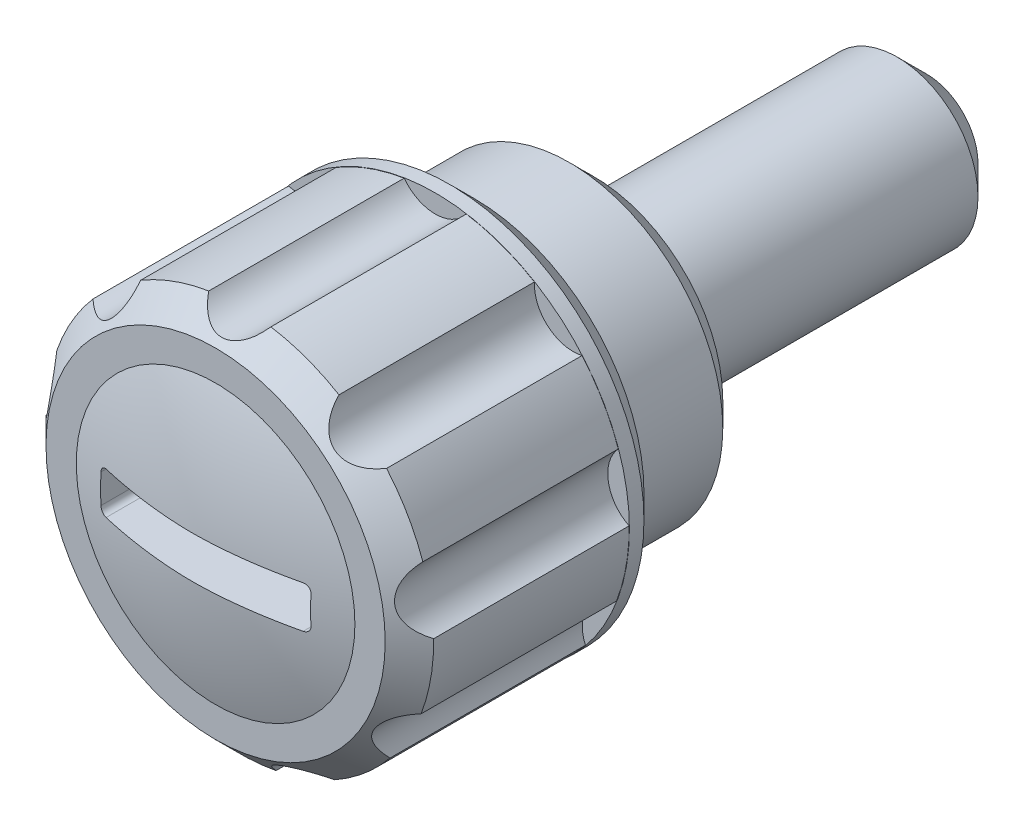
ISO-10303-21;
HEADER;
FILE_DESCRIPTION(('STEP AP214'),'2;1');
FILE_NAME('part.step','',(''),(''),'','','');
FILE_SCHEMA(('AUTOMOTIVE_DESIGN { 1 0 10303 214 1 1 1 1 }'));
ENDSEC;
DATA;
#1=APPLICATION_CONTEXT('core data for automotive mechanical design processes');
#2=APPLICATION_PROTOCOL_DEFINITION('international standard','automotive_design',2000,#1);
#3=PRODUCT_CONTEXT('',#1,'mechanical');
#4=PRODUCT('Part','Part','',(#3));
#5=PRODUCT_RELATED_PRODUCT_CATEGORY('part','',(#4));
#6=PRODUCT_DEFINITION_FORMATION('','',#4);
#7=PRODUCT_DEFINITION_CONTEXT('part definition',#1,'design');
#8=PRODUCT_DEFINITION('design','',#6,#7);
#9=PRODUCT_DEFINITION_SHAPE('','',#8);
#10=(LENGTH_UNIT() NAMED_UNIT(*) SI_UNIT(.MILLI.,.METRE.));
#11=(NAMED_UNIT(*) PLANE_ANGLE_UNIT() SI_UNIT($,.RADIAN.));
#12=(NAMED_UNIT(*) SI_UNIT($,.STERADIAN.) SOLID_ANGLE_UNIT());
#13=UNCERTAINTY_MEASURE_WITH_UNIT(LENGTH_MEASURE(1.E-05),#10,'distance_accuracy_value','');
#14=(GEOMETRIC_REPRESENTATION_CONTEXT(3) GLOBAL_UNCERTAINTY_ASSIGNED_CONTEXT((#13)) GLOBAL_UNIT_ASSIGNED_CONTEXT((#10,
#11,#12)) REPRESENTATION_CONTEXT('',''));
#15=CARTESIAN_POINT('',(0.,0.,0.));
#16=DIRECTION('',(0.,0.,1.));
#17=DIRECTION('',(1.,0.,0.));
#18=AXIS2_PLACEMENT_3D('',#15,#16,#17);
#19=CARTESIAN_POINT('',(0.,0.,-2.24502330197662));
#20=DIRECTION('',(0.,0.,1.));
#21=DIRECTION('',(1.,0.,0.));
#22=AXIS2_PLACEMENT_3D('',#19,#20,#21);
#23=DEGENERATE_TOROIDAL_SURFACE('',#22,0.386362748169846,14.9999999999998,.F.);
#24=CARTESIAN_POINT('',(0.,0.,12.));
#25=DIRECTION('',(0.,0.,1.));
#26=DIRECTION('',(1.,0.,0.));
#27=AXIS2_PLACEMENT_3D('',#24,#25,#26);
#28=CIRCLE('',#27,4.3125);
#29=CARTESIAN_POINT('',(4.3125,0.,12.));
#30=VERTEX_POINT('',#29);
#31=EDGE_CURVE('E351',#30,#30,#28,.T.);
#32=ORIENTED_EDGE('',*,*,#31,.T.);
#33=EDGE_LOOP('',(#32));
#34=FACE_BOUND('',#33,.T.);
#35=CARTESIAN_POINT('',(-3.0498,-0.649999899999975,12.3398097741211));
#36=CARTESIAN_POINT('',(-3.06120822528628,-0.650019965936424,12.3371277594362));
#37=CARTESIAN_POINT('',(-3.07262553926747,-0.649047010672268,12.3344789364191));
#38=CARTESIAN_POINT('',(-3.09516164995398,-0.645167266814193,12.3293198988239));
#39=CARTESIAN_POINT('',(-3.10628037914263,-0.642260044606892,12.326809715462));
#40=CARTESIAN_POINT('',(-3.1279071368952,-0.634560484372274,12.3219992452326));
#41=CARTESIAN_POINT('',(-3.13841459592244,-0.629766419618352,12.3196991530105));
#42=CARTESIAN_POINT('',(-3.15848770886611,-0.618413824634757,12.3153819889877));
#43=CARTESIAN_POINT('',(-3.16805381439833,-0.611856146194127,12.3133647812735));
#44=CARTESIAN_POINT('',(-3.18579781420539,-0.59727066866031,12.3097075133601));
#45=CARTESIAN_POINT('',(-3.19399634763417,-0.589269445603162,12.308061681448));
#46=CARTESIAN_POINT('',(-3.20893719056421,-0.571941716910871,12.3051577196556));
#47=CARTESIAN_POINT('',(-3.2156793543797,-0.562615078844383,12.303899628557));
#48=CARTESIAN_POINT('',(-3.22732440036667,-0.543172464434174,12.3018421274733));
#49=CARTESIAN_POINT('',(-3.23227144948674,-0.533084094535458,12.3010314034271));
#50=CARTESIAN_POINT('',(-3.24041051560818,-0.512202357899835,12.2998457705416));
#51=CARTESIAN_POINT('',(-3.24360397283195,-0.501409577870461,12.299470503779));
#52=CARTESIAN_POINT('',(-3.24725089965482,-0.483746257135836,12.2992265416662));
#53=CARTESIAN_POINT('',(-3.24828749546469,-0.476992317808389,12.2992171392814));
#54=CARTESIAN_POINT('',(-3.24966526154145,-0.4634255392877,12.2993633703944));
#55=CARTESIAN_POINT('',(-3.25000743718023,-0.456612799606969,12.2995187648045));
#56=CARTESIAN_POINT('',(-3.24999990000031,-0.449800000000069,12.2997561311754));
#57=B_SPLINE_CURVE_WITH_KNOTS('',3,(#35,#36,#37,#38,#39,#40,#41,#42,#43,#44,#45,#46,#47,#48,#49,
#50,#51,#52,#53,#54,#55,#56),.UNSPECIFIED.,.F.,.F.,(4,2,2,2,2,2,2,2,2,2,4),(0.,
0.0351172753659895,0.0702424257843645,0.10539979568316,0.140540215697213,0.175089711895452,
0.209642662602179,0.243276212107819,0.276882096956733,0.297346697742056,0.317781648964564),.UNSPECIFIED.);
#58=CARTESIAN_POINT('',(-3.05,-0.65,12.3397627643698));
#59=VERTEX_POINT('',#58);
#60=CARTESIAN_POINT('',(-3.25,-0.45,12.2997491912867));
#61=VERTEX_POINT('',#60);
#62=EDGE_CURVE('E462',#59,#61,#57,.T.);
#63=ORIENTED_EDGE('',*,*,#62,.T.);
#64=CARTESIAN_POINT('',(-3.25,0.,12.3075320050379));
#65=CARTESIAN_POINT('',(-3.25,0.277728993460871,12.3075356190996));
#66=CARTESIAN_POINT('',(-3.25,0.555440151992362,12.2986179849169));
#67=CARTESIAN_POINT('',(-3.25,1.10971337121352,12.2631914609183));
#68=CARTESIAN_POINT('',(-3.25,1.38627553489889,12.2366841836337));
#69=CARTESIAN_POINT('',(-3.25,1.93745588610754,12.1665755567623));
#70=CARTESIAN_POINT('',(-3.25,2.21207222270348,12.122959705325));
#71=CARTESIAN_POINT('',(-3.25,2.75819405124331,12.019207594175));
#72=CARTESIAN_POINT('',(-3.25,3.02969897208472,11.9590683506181));
#73=CARTESIAN_POINT('',(-3.25,3.68907942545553,11.7923343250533));
#74=CARTESIAN_POINT('',(-3.25,4.07477310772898,11.6769874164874));
#75=CARTESIAN_POINT('',(-3.25,4.83507528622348,11.4141726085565));
#76=CARTESIAN_POINT('',(-3.25,5.20968196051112,11.2666994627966));
#77=CARTESIAN_POINT('',(-3.25,5.94561682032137,10.9408021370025));
#78=CARTESIAN_POINT('',(-3.25,6.30693188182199,10.7623483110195));
#79=CARTESIAN_POINT('',(-3.25,7.013278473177,10.3760839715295));
#80=CARTESIAN_POINT('',(-3.25,7.35831779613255,10.1682877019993));
#81=CARTESIAN_POINT('',(-3.25,8.03118455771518,9.72399493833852));
#82=CARTESIAN_POINT('',(-3.25,8.35894545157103,9.48739766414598));
#83=CARTESIAN_POINT('',(-3.25,8.99368126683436,8.98778857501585));
#84=CARTESIAN_POINT('',(-3.25,9.30065586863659,8.72477635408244));
#85=CARTESIAN_POINT('',(-3.25,9.8916546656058,8.1742495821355));
#86=CARTESIAN_POINT('',(-3.25,10.1756840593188,7.88674061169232));
#87=CARTESIAN_POINT('',(-3.25,10.7189336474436,7.2891687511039));
#88=CARTESIAN_POINT('',(-3.25,10.9781537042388,6.97910573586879));
#89=CARTESIAN_POINT('',(-3.25,11.4737062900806,6.33376323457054));
#90=CARTESIAN_POINT('',(-3.25,11.7096373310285,5.9981753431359));
#91=CARTESIAN_POINT('',(-3.25,12.1524595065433,5.30835452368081));
#92=CARTESIAN_POINT('',(-3.25,12.3593503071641,4.95412138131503));
#93=CARTESIAN_POINT('',(-3.25,12.7426542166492,4.22948724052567));
#94=CARTESIAN_POINT('',(-3.25,12.9190643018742,3.85908464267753));
#95=CARTESIAN_POINT('',(-3.25,13.2401398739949,3.10476845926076));
#96=CARTESIAN_POINT('',(-3.25,13.3848053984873,2.72085488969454));
#97=CARTESIAN_POINT('',(-3.25,13.6416809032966,1.94130139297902));
#98=CARTESIAN_POINT('',(-3.25,13.753812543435,1.5456356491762));
#99=CARTESIAN_POINT('',(-3.25,13.944363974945,0.746267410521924));
#100=CARTESIAN_POINT('',(-3.25,14.0227836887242,0.342564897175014));
#101=CARTESIAN_POINT('',(-3.25,14.1453548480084,-0.469998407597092));
#102=CARTESIAN_POINT('',(-3.25,14.1895071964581,-0.8788590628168));
#103=CARTESIAN_POINT('',(-3.25,14.2432347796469,-1.69884576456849));
#104=CARTESIAN_POINT('',(-3.25,14.2528100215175,-2.10997181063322));
#105=CARTESIAN_POINT('',(-3.25,14.2373111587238,-2.93180992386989));
#106=CARTESIAN_POINT('',(-3.25,14.2122168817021,-3.34252161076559));
#107=CARTESIAN_POINT('',(-3.25,14.1275207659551,-4.16037161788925));
#108=CARTESIAN_POINT('',(-3.25,14.0679189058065,-4.56750993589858));
#109=CARTESIAN_POINT('',(-3.25,13.9146256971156,-5.37533907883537));
#110=CARTESIAN_POINT('',(-3.25,13.8209326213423,-5.77602957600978));
#111=CARTESIAN_POINT('',(-3.25,13.6001207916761,-6.568092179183));
#112=CARTESIAN_POINT('',(-3.25,13.4730020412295,-6.95946428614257));
#113=CARTESIAN_POINT('',(-3.25,13.186232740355,-7.7301217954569));
#114=CARTESIAN_POINT('',(-3.25,13.0265808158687,-8.10940668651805));
#115=CARTESIAN_POINT('',(-3.25,12.6758786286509,-8.85317181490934));
#116=CARTESIAN_POINT('',(-3.25,12.4848283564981,-9.21765204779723));
#117=CARTESIAN_POINT('',(-3.25,12.072711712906,-9.92915798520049));
#118=CARTESIAN_POINT('',(-3.25,11.8516496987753,-10.2761862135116));
#119=CARTESIAN_POINT('',(-3.25,11.3810523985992,-10.9503675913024));
#120=CARTESIAN_POINT('',(-3.25,11.1315171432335,-11.2775207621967));
#121=CARTESIAN_POINT('',(-3.25,10.6059307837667,-11.9093794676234));
#122=CARTESIAN_POINT('',(-3.25,10.3298992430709,-12.2141012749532));
#123=CARTESIAN_POINT('',(-3.25,9.75311451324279,-12.7991756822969));
#124=CARTESIAN_POINT('',(-3.25,9.45236128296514,-13.0795282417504));
#125=CARTESIAN_POINT('',(-3.25,8.82813062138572,-13.6139441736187));
#126=CARTESIAN_POINT('',(-3.25,8.50464416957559,-13.8679970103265));
#127=CARTESIAN_POINT('',(-3.25,7.8373363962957,-14.3478241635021));
#128=CARTESIAN_POINT('',(-3.25,7.49351512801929,-14.573598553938));
#129=CARTESIAN_POINT('',(-3.25,6.78879460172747,-14.9946762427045));
#130=CARTESIAN_POINT('',(-3.25,6.42793763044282,-15.1900503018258));
#131=CARTESIAN_POINT('',(-3.25,5.69092259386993,-15.5494366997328));
#132=CARTESIAN_POINT('',(-3.25,5.31476441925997,-15.7134488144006));
#133=CARTESIAN_POINT('',(-3.25,4.54996490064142,-16.0086112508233));
#134=CARTESIAN_POINT('',(-3.25,4.16132971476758,-16.1397775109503));
#135=CARTESIAN_POINT('',(-3.25,3.37414151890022,-16.367940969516));
#136=CARTESIAN_POINT('',(-3.25,2.97558824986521,-16.4649372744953));
#137=CARTESIAN_POINT('',(-3.25,2.17796770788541,-16.6218590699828));
#138=CARTESIAN_POINT('',(-3.25,1.77901685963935,-16.682368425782));
#139=CARTESIAN_POINT('',(-3.25,1.17783289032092,-16.7458571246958));
#140=CARTESIAN_POINT('',(-3.25,0.976962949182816,-16.7624743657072));
#141=CARTESIAN_POINT('',(-3.25,0.574677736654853,-16.7864370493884));
#142=CARTESIAN_POINT('',(-3.25,0.373262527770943,-16.7937835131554));
#143=CARTESIAN_POINT('',(-3.25,-0.0296307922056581,-16.7991040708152));
#144=CARTESIAN_POINT('',(-3.25,-0.231108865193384,-16.7970810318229));
#145=CARTESIAN_POINT('',(-3.25,-0.633740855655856,-16.7837024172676));
#146=CARTESIAN_POINT('',(-3.25,-0.834894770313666,-16.7723467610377));
#147=CARTESIAN_POINT('',(-3.25,-1.43727360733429,-16.7244784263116));
#148=CARTESIAN_POINT('',(-3.25,-1.83748615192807,-16.6741652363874));
#149=CARTESIAN_POINT('',(-3.25,-2.60244344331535,-16.5434913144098));
#150=CARTESIAN_POINT('',(-3.25,-2.9676242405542,-16.465624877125));
#151=CARTESIAN_POINT('',(-3.25,-3.69061293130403,-16.2811099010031));
#152=CARTESIAN_POINT('',(-3.25,-4.04842149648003,-16.1744639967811));
#153=CARTESIAN_POINT('',(-3.25,-4.75476881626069,-15.9334225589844));
#154=CARTESIAN_POINT('',(-3.25,-5.10330243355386,-15.7990119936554));
#155=CARTESIAN_POINT('',(-3.25,-5.78889033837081,-15.5035347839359));
#156=CARTESIAN_POINT('',(-3.25,-6.12594408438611,-15.3424668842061));
#157=CARTESIAN_POINT('',(-3.25,-6.80932679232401,-14.9828170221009));
#158=CARTESIAN_POINT('',(-3.25,-7.15470066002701,-14.7824174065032));
#159=CARTESIAN_POINT('',(-3.25,-7.82779768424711,-14.3538815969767));
#160=CARTESIAN_POINT('',(-3.25,-8.15552013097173,-14.1257442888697));
#161=CARTESIAN_POINT('',(-3.25,-8.79107255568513,-13.6433774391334));
#162=CARTESIAN_POINT('',(-3.25,-9.09890611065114,-13.3891526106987));
#163=CARTESIAN_POINT('',(-3.25,-9.69269581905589,-12.8563257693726));
#164=CARTESIAN_POINT('',(-3.25,-9.97865187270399,-12.5777236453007));
#165=CARTESIAN_POINT('',(-3.25,-10.5337680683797,-11.9906483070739));
#166=CARTESIAN_POINT('',(-3.25,-10.8023152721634,-11.6815951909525));
#167=CARTESIAN_POINT('',(-3.25,-11.3125257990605,-11.0420356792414));
#168=CARTESIAN_POINT('',(-3.25,-11.5541885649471,-10.7115288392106));
#169=CARTESIAN_POINT('',(-3.25,-12.0089741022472,-10.0313455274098));
#170=CARTESIAN_POINT('',(-3.25,-12.2220918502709,-9.6816656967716));
#171=CARTESIAN_POINT('',(-3.25,-12.6182423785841,-8.96566280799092));
#172=CARTESIAN_POINT('',(-3.25,-12.8012752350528,-8.59933979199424));
#173=CARTESIAN_POINT('',(-3.25,-13.1366167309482,-7.85119993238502));
#174=CARTESIAN_POINT('',(-3.25,-13.2888047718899,-7.46932902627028));
#175=CARTESIAN_POINT('',(-3.25,-13.5604975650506,-6.69413124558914));
#176=CARTESIAN_POINT('',(-3.25,-13.680002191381,-6.30080432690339));
#177=CARTESIAN_POINT('',(-3.25,-13.885478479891,-5.505506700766));
#178=CARTESIAN_POINT('',(-3.25,-13.9714517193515,-5.10353640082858));
#179=CARTESIAN_POINT('',(-3.25,-14.1092657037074,-4.29378701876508));
#180=CARTESIAN_POINT('',(-3.25,-14.1611064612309,-3.88600793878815));
#181=CARTESIAN_POINT('',(-3.25,-14.2303212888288,-3.06715435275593));
#182=CARTESIAN_POINT('',(-3.25,-14.2476633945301,-2.65607714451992));
#183=CARTESIAN_POINT('',(-3.25,-14.2476620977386,-1.83392251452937));
#184=CARTESIAN_POINT('',(-3.25,-14.2303186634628,-1.42284509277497));
#185=CARTESIAN_POINT('',(-3.25,-14.1610682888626,-0.603603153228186));
#186=CARTESIAN_POINT('',(-3.25,-14.1091606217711,-0.195438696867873));
#187=CARTESIAN_POINT('',(-3.25,-13.9711485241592,0.615067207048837));
#188=CARTESIAN_POINT('',(-3.25,-13.885044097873,1.01740865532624));
#189=CARTESIAN_POINT('',(-3.25,-13.6792331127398,1.81346557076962));
#190=CARTESIAN_POINT('',(-3.25,-13.5595217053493,2.20717978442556));
#191=CARTESIAN_POINT('',(-3.25,-13.2873494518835,2.98312116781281));
#192=CARTESIAN_POINT('',(-3.25,-13.1348885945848,3.36534833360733));
#193=CARTESIAN_POINT('',(-3.25,-12.7982999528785,4.11558729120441));
#194=CARTESIAN_POINT('',(-3.25,-12.6141727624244,4.48359934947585));
#195=CARTESIAN_POINT('',(-3.25,-12.2155528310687,5.20279306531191));
#196=CARTESIAN_POINT('',(-3.25,-12.0010601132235,5.55397473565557));
#197=CARTESIAN_POINT('',(-3.25,-11.5433180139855,6.2368658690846));
#198=CARTESIAN_POINT('',(-3.25,-11.3000801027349,6.56858302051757));
#199=CARTESIAN_POINT('',(-3.25,-10.7864981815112,7.2103264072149));
#200=CARTESIAN_POINT('',(-3.25,-10.5161541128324,7.52035259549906));
#201=CARTESIAN_POINT('',(-3.25,-9.95025306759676,8.11650757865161));
#202=CARTESIAN_POINT('',(-3.25,-9.65469453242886,8.4026348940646));
#203=CARTESIAN_POINT('',(-3.25,-9.04046877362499,8.94890264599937));
#204=CARTESIAN_POINT('',(-3.25,-8.72180175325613,9.20904331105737));
#205=CARTESIAN_POINT('',(-3.25,-8.06411837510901,9.70105813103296));
#206=CARTESIAN_POINT('',(-3.25,-7.72513441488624,9.93297559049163));
#207=CARTESIAN_POINT('',(-3.25,-7.02875492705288,10.3672880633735));
#208=CARTESIAN_POINT('',(-3.25,-6.67135962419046,10.5696834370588));
#209=CARTESIAN_POINT('',(-3.25,-5.94066060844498,10.9433896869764));
#210=CARTESIAN_POINT('',(-3.25,-5.56735649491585,11.1146997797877));
#211=CARTESIAN_POINT('',(-3.25,-4.80749189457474,11.4247686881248));
#212=CARTESIAN_POINT('',(-3.25,-4.42093314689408,11.5635317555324));
#213=CARTESIAN_POINT('',(-3.25,-3.70318039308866,11.786627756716));
#214=CARTESIAN_POINT('',(-3.25,-3.37360154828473,11.876189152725));
#215=CARTESIAN_POINT('',(-3.25,-2.70877137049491,12.0309482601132));
#216=CARTESIAN_POINT('',(-3.25,-2.37352047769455,12.0961478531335));
#217=CARTESIAN_POINT('',(-3.25,-1.69957377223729,12.2010954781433));
#218=CARTESIAN_POINT('',(-3.25,-1.36088404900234,12.2408824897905));
#219=CARTESIAN_POINT('',(-3.25,-0.681453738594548,12.2940966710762));
#220=CARTESIAN_POINT('',(-3.25,-0.340713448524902,12.3075275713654));
#221=CARTESIAN_POINT('',(-3.25,0.,12.3075320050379));
#222=B_SPLINE_CURVE_WITH_KNOTS('',3,(#64,#65,#66,#67,#68,#69,#70,#71,#72,#73,#74,#75,#76,#77,
#78,#79,#80,#81,#82,#83,#84,#85,#86,#87,#88,#89,#90,#91,#92,#93,#94,#95,#96,#97,#98,#99,#100,
#101,#102,#103,#104,#105,#106,#107,#108,#109,#110,#111,#112,#113,#114,#115,#116,#117,#118,#119,
#120,#121,#122,#123,#124,#125,#126,#127,#128,#129,#130,#131,#132,#133,#134,#135,#136,#137,#138,
#139,#140,#141,#142,#143,#144,#145,#146,#147,#148,#149,#150,#151,#152,#153,#154,#155,#156,#157,
#158,#159,#160,#161,#162,#163,#164,#165,#166,#167,#168,#169,#170,#171,#172,#173,#174,#175,#176,
#177,#178,#179,#180,#181,#182,#183,#184,#185,#186,#187,#188,#189,#190,#191,#192,#193,#194,#195,
#196,#197,#198,#199,#200,#201,#202,#203,#204,#205,#206,#207,#208,#209,#210,#211,#212,#213,#214,
#215,#216,#217,#218,#219,#220,#221),.UNSPECIFIED.,.T.,.F.,(4,2,2,2,2,2,2,2,2,2,2,2,2,2,2,2,2,2,
2,2,2,2,2,2,2,2,2,2,2,2,2,2,2,2,2,2,2,2,2,2,2,2,2,2,2,2,2,2,2,2,2,2,2,2,2,2,2,2,2,2,2,2,2,2,2,2,
2,2,2,2,2,2,2,2,2,2,2,2,4),(0.,0.833015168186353,1.66595398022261,2.49960035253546,
3.33339736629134,4.53957397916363,5.74594771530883,6.95348227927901,8.16043266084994,
9.37173482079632,10.583055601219,11.7941011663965,13.0051534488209,14.2343656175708,
15.4635919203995,16.6929400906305,17.9222868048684,19.15456962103,20.3868552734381,
21.6191084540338,22.8513613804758,24.0843315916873,25.3173025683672,26.5503360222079,
27.7833693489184,29.01645476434,30.2495405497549,31.4824474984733,32.7153531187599,
33.9473553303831,35.1793595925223,36.4118555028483,37.6443481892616,38.8739277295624,
40.1035160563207,41.3325065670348,42.5615292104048,43.7703236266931,44.3748145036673,
44.97923879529,45.583478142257,46.1877227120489,47.3960010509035,48.5150195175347,
49.6339355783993,50.7534590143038,51.8730351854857,53.0695719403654,54.2661567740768,
55.4625258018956,56.658900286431,57.8857327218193,59.1125905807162,60.3396640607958,
61.5667344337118,62.7985136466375,64.0302976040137,65.2620236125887,66.4937491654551,
67.7266154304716,68.9594828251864,70.1923761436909,71.4252693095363,72.6583404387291,
73.8914119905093,75.1244604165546,76.3575079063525,77.5900650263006,78.8226248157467,
80.05526085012,81.2878860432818,82.5185954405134,83.7492898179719,84.9800152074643,
86.2105797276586,87.2343070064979,88.2579551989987,89.2800294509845,90.3019590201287),.UNSPECIFIED.);
#223=CARTESIAN_POINT('',(-3.25,0.45,12.2997491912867));
#224=VERTEX_POINT('',#223);
#225=EDGE_CURVE('E194',#61,#224,#222,.T.);
#226=ORIENTED_EDGE('',*,*,#225,.T.);
#227=CARTESIAN_POINT('',(-3.24999989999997,0.4498,12.2997561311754));
#228=CARTESIAN_POINT('',(-3.25002147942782,0.460776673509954,12.2993714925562));
#229=CARTESIAN_POINT('',(-3.24911882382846,0.471758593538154,12.2992032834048));
#230=CARTESIAN_POINT('',(-3.24553635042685,0.493412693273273,12.2992941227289));
#231=CARTESIAN_POINT('',(-3.24285883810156,0.504085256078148,12.299552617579));
#232=CARTESIAN_POINT('',(-3.23579622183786,0.524834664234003,12.3004904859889));
#233=CARTESIAN_POINT('',(-3.23141042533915,0.53491126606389,12.3011700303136));
#234=CARTESIAN_POINT('',(-3.22107038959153,0.554184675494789,12.3029273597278));
#235=CARTESIAN_POINT('',(-3.21511623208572,0.563381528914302,12.3040051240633));
#236=CARTESIAN_POINT('',(-3.20177417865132,0.580709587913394,12.3065339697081));
#237=CARTESIAN_POINT('',(-3.19437690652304,0.588833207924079,12.3079875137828));
#238=CARTESIAN_POINT('',(-3.17839327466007,0.603735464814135,12.3112205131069));
#239=CARTESIAN_POINT('',(-3.16980667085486,0.610513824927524,12.3130000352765));
#240=CARTESIAN_POINT('',(-3.15148706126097,0.62269653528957,12.3168763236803));
#241=CARTESIAN_POINT('',(-3.14173272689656,0.628066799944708,12.3189792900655));
#242=CARTESIAN_POINT('',(-3.12151319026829,0.637105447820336,12.3234120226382));
#243=CARTESIAN_POINT('',(-3.11104805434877,0.640773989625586,12.3257417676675));
#244=CARTESIAN_POINT('',(-3.09210451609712,0.64570458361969,12.3300193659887));
#245=CARTESIAN_POINT('',(-3.08370936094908,0.647322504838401,12.3319350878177));
#246=CARTESIAN_POINT('',(-3.06680849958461,0.649474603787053,12.3358309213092));
#247=CARTESIAN_POINT('',(-3.05830296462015,0.650010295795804,12.3378109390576));
#248=CARTESIAN_POINT('',(-3.0498,0.649999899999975,12.3398097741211));
#249=B_SPLINE_CURVE_WITH_KNOTS('',3,(#227,#228,#229,#230,#231,#232,#233,#234,#235,#236,#237,
#238,#239,#240,#241,#242,#243,#244,#245,#246,#247,#248),.UNSPECIFIED.,.F.,.F.,(4,2,2,2,2,2,2,2,
2,2,4),(0.,0.0329053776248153,0.0657680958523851,0.0986441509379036,0.13151849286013,
0.1646140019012,0.197716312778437,0.231558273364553,0.265397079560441,0.291616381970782,
0.31779897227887),.UNSPECIFIED.);
#250=CARTESIAN_POINT('',(-3.04999999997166,0.65,12.3397627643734));
#251=VERTEX_POINT('',#250);
#252=EDGE_CURVE('E416',#224,#251,#249,.T.);
#253=ORIENTED_EDGE('',*,*,#252,.T.);
#254=CARTESIAN_POINT('',(0.,0.65,12.7191322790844));
#255=CARTESIAN_POINT('',(0.108520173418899,0.65,12.7191277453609));
#256=CARTESIAN_POINT('',(0.217041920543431,0.65,12.7172094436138));
#257=CARTESIAN_POINT('',(0.433997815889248,0.65,12.7099981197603));
#258=CARTESIAN_POINT('',(0.542431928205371,0.65,12.7047040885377));
#259=CARTESIAN_POINT('',(0.759555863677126,0.65,12.6912706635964));
#260=CARTESIAN_POINT('',(0.868244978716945,0.65,12.6831199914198));
#261=CARTESIAN_POINT('',(1.08539837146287,0.65,12.6642185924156));
#262=CARTESIAN_POINT('',(1.19386263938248,0.65,12.6534677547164));
#263=CARTESIAN_POINT('',(1.51887735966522,0.65,12.6174925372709));
#264=CARTESIAN_POINT('',(1.73502604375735,0.65,12.5885469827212));
#265=CARTESIAN_POINT('',(2.16611297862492,0.65,12.5210525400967));
#266=CARTESIAN_POINT('',(2.38104917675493,0.65,12.4824906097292));
#267=CARTESIAN_POINT('',(2.80901885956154,0.65,12.3959374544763));
#268=CARTESIAN_POINT('',(3.02205219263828,0.65,12.3479454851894));
#269=CARTESIAN_POINT('',(3.64169701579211,0.65,12.1939819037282));
#270=CARTESIAN_POINT('',(4.04525595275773,0.65,12.0754170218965));
#271=CARTESIAN_POINT('',(4.84106887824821,0.65,11.804706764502));
#272=CARTESIAN_POINT('',(5.23331827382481,0.65,11.6525479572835));
#273=CARTESIAN_POINT('',(6.00390173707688,0.65,11.3156534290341));
#274=CARTESIAN_POINT('',(6.382226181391,0.65,11.1308956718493));
#275=CARTESIAN_POINT('',(7.12194189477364,0.65,10.7302214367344));
#276=CARTESIAN_POINT('',(7.48333496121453,0.65,10.5143082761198));
#277=CARTESIAN_POINT('',(8.18679974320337,0.65,10.0527629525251));
#278=CARTESIAN_POINT('',(8.52886465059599,0.65,9.80712041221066));
#279=CARTESIAN_POINT('',(9.19111928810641,0.65,9.28791513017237));
#280=CARTESIAN_POINT('',(9.51130841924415,0.65,9.01435162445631));
#281=CARTESIAN_POINT('',(10.1275007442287,0.65,8.44128082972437));
#282=CARTESIAN_POINT('',(10.4235063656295,0.65,8.14177615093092));
#283=CARTESIAN_POINT('',(10.9892674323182,0.65,7.51892636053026));
#284=CARTESIAN_POINT('',(11.2590230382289,0.65,7.19558139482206));
#285=CARTESIAN_POINT('',(11.7706885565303,0.65,6.52693164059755));
#286=CARTESIAN_POINT('',(12.012563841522,0.65,6.18160035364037));
#287=CARTESIAN_POINT('',(12.4663665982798,0.65,5.47179015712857));
#288=CARTESIAN_POINT('',(12.6782939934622,0.65,5.10731119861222));
#289=CARTESIAN_POINT('',(13.0706918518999,0.65,4.36180202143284));
#290=CARTESIAN_POINT('',(13.2511627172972,0.65,3.98077201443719));
#291=CARTESIAN_POINT('',(13.5793682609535,0.65,3.20486500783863));
#292=CARTESIAN_POINT('',(13.7271029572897,0.65,2.80998801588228));
#293=CARTESIAN_POINT('',(13.988800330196,0.65,2.00915107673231));
#294=CARTESIAN_POINT('',(14.1027594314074,0.65,1.60318996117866));
#295=CARTESIAN_POINT('',(14.2960746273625,0.65,0.783110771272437));
#296=CARTESIAN_POINT('',(14.3754307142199,0.65,0.368992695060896));
#297=CARTESIAN_POINT('',(14.498977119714,0.65,-0.464465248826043));
#298=CARTESIAN_POINT('',(14.5431666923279,0.65,-0.883805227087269));
#299=CARTESIAN_POINT('',(14.596063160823,0.65,-1.72471716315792));
#300=CARTESIAN_POINT('',(14.6047700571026,0.65,-2.1462891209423));
#301=CARTESIAN_POINT('',(14.5866390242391,0.65,-2.98868011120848));
#302=CARTESIAN_POINT('',(14.5598000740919,0.65,-3.40949912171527));
#303=CARTESIAN_POINT('',(14.4707663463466,0.65,-4.24738022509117));
#304=CARTESIAN_POINT('',(14.4085715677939,0.65,-4.66444231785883));
#305=CARTESIAN_POINT('',(14.2492707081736,0.65,-5.49183187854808));
#306=CARTESIAN_POINT('',(14.1521656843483,0.65,-5.90215955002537));
#307=CARTESIAN_POINT('',(13.92373427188,0.65,-6.7131760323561));
#308=CARTESIAN_POINT('',(13.7924078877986,0.65,-7.11386484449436));
#309=CARTESIAN_POINT('',(13.4964692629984,0.65,-7.90274953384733));
#310=CARTESIAN_POINT('',(13.3318574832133,0.65,-8.29094558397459));
#311=CARTESIAN_POINT('',(12.9705168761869,0.65,-9.05209088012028));
#312=CARTESIAN_POINT('',(12.7737880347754,0.65,-9.42504011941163));
#313=CARTESIAN_POINT('',(12.3495993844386,0.65,-10.1530610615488));
#314=CARTESIAN_POINT('',(12.1221378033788,0.65,-10.5081317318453));
#315=CARTESIAN_POINT('',(11.6381096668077,0.65,-11.1978469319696));
#316=CARTESIAN_POINT('',(11.3815431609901,0.65,-11.5324914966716));
#317=CARTESIAN_POINT('',(10.8411381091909,0.65,-12.1789638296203));
#318=CARTESIAN_POINT('',(10.5573005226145,0.65,-12.4907923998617));
#319=CARTESIAN_POINT('',(9.9643609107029,0.65,-13.0894299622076));
#320=CARTESIAN_POINT('',(9.65525870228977,0.65,-13.3762387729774));
#321=CARTESIAN_POINT('',(9.01399860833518,0.65,-13.9227850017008));
#322=CARTESIAN_POINT('',(8.681841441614,0.65,-14.1825232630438));
#323=CARTESIAN_POINT('',(7.99683299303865,0.65,-14.6730822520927));
#324=CARTESIAN_POINT('',(7.64398231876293,0.65,-14.9039038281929));
#325=CARTESIAN_POINT('',(6.92002553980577,0.65,-15.335028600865));
#326=CARTESIAN_POINT('',(6.5489163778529,0.65,-15.5353266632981));
#327=CARTESIAN_POINT('',(5.79113277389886,0.65,-15.903924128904));
#328=CARTESIAN_POINT('',(5.40445847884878,0.65,-16.0722238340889));
#329=CARTESIAN_POINT('',(4.61839618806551,0.65,-16.3755712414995));
#330=CARTESIAN_POINT('',(4.21901109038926,0.65,-16.5106264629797));
#331=CARTESIAN_POINT('',(3.41037855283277,0.65,-16.7464936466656));
#332=CARTESIAN_POINT('',(3.00113546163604,0.65,-16.8473204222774));
#333=CARTESIAN_POINT('',(2.37474825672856,0.65,-16.9737106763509));
#334=CARTESIAN_POINT('',(2.16011736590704,0.65,-17.0121235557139));
#335=CARTESIAN_POINT('',(1.72933145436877,0.65,-17.0793970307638));
#336=CARTESIAN_POINT('',(1.51317639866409,0.65,-17.1082574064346));
#337=CARTESIAN_POINT('',(1.1883245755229,0.65,-17.1440821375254));
#338=CARTESIAN_POINT('',(1.08002619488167,0.65,-17.1547737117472));
#339=CARTESIAN_POINT('',(0.863198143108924,0.65,-17.1735629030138));
#340=CARTESIAN_POINT('',(0.754668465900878,0.65,-17.1816604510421));
#341=CARTESIAN_POINT('',(0.537464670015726,0.65,-17.1950151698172));
#342=CARTESIAN_POINT('',(0.42879060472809,0.65,-17.2002731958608));
#343=CARTESIAN_POINT('',(0.211334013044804,0.65,-17.20738850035));
#344=CARTESIAN_POINT('',(0.102551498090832,0.65,-17.2092461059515));
#345=CARTESIAN_POINT('',(-0.098037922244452,0.65,-17.2091183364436));
#346=CARTESIAN_POINT('',(-0.189845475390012,0.65,-17.2076873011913));
#347=CARTESIAN_POINT('',(-0.373392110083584,0.65,-17.2023544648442));
#348=CARTESIAN_POINT('',(-0.465131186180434,0.65,-17.1984524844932));
#349=CARTESIAN_POINT('',(-0.648525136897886,0.65,-17.1885366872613));
#350=CARTESIAN_POINT('',(-0.740179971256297,0.65,-17.1825221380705));
#351=CARTESIAN_POINT('',(-0.923340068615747,0.65,-17.1685825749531));
#352=CARTESIAN_POINT('',(-1.01484533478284,0.65,-17.1606576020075));
#353=CARTESIAN_POINT('',(-1.28932831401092,0.65,-17.1341570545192));
#354=CARTESIAN_POINT('',(-1.47205047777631,0.65,-17.1128685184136));
#355=CARTESIAN_POINT('',(-1.83651738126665,0.65,-17.0634122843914));
#356=CARTESIAN_POINT('',(-2.01826229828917,0.65,-17.0352458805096));
#357=CARTESIAN_POINT('',(-2.38129600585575,0.65,-16.9720306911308));
#358=CARTESIAN_POINT('',(-2.56258014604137,0.65,-16.936955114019));
#359=CARTESIAN_POINT('',(-2.92371751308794,0.65,-16.8600846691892));
#360=CARTESIAN_POINT('',(-3.10357066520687,0.65,-16.8182894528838));
#361=CARTESIAN_POINT('',(-3.64033450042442,0.65,-16.6830040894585));
#362=CARTESIAN_POINT('',(-3.9947892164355,0.65,-16.57955495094));
#363=CARTESIAN_POINT('',(-4.71178689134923,0.65,-16.3411791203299));
#364=CARTESIAN_POINT('',(-5.07390702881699,0.65,-16.2049845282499));
#365=CARTESIAN_POINT('',(-5.78663052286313,0.65,-15.9049349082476));
#366=CARTESIAN_POINT('',(-6.13723052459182,0.65,-15.7410719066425));
#367=CARTESIAN_POINT('',(-6.82400082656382,0.65,-15.3870663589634));
#368=CARTESIAN_POINT('',(-7.16019896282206,0.65,-15.1969778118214));
#369=CARTESIAN_POINT('',(-7.81689468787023,0.65,-14.7914249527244));
#370=CARTESIAN_POINT('',(-8.13739298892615,0.65,-14.5759617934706));
#371=CARTESIAN_POINT('',(-8.7889588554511,0.65,-14.1003791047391));
#372=CARTESIAN_POINT('',(-9.118369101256,0.65,-13.8379842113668));
#373=CARTESIAN_POINT('',(-9.75396306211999,0.65,-13.2863857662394));
#374=CARTESIAN_POINT('',(-10.0601446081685,0.65,-12.9971797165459));
#375=CARTESIAN_POINT('',(-10.6473742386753,0.65,-12.3937305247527));
#376=CARTESIAN_POINT('',(-10.9283974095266,0.65,-12.0794631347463));
#377=CARTESIAN_POINT('',(-11.4629667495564,0.65,-11.4283824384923));
#378=CARTESIAN_POINT('',(-11.716513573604,0.65,-11.0915696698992));
#379=CARTESIAN_POINT('',(-12.1943966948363,0.65,-10.3976989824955));
#380=CARTESIAN_POINT('',(-12.4187257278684,0.65,-10.0406360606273));
#381=CARTESIAN_POINT('',(-12.836505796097,0.65,-9.30887820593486));
#382=CARTESIAN_POINT('',(-13.0299566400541,0.65,-8.93418316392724));
#383=CARTESIAN_POINT('',(-13.3845512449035,0.65,-8.1699401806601));
#384=CARTESIAN_POINT('',(-13.5457045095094,0.65,-7.78039664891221));
#385=CARTESIAN_POINT('',(-13.8346300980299,0.65,-6.98912166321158));
#386=CARTESIAN_POINT('',(-13.9624024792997,0.65,-6.58739023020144));
#387=CARTESIAN_POINT('',(-14.1836800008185,0.65,-5.77451590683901));
#388=CARTESIAN_POINT('',(-14.2771785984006,0.65,-5.36337123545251));
#389=CARTESIAN_POINT('',(-14.4292098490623,0.65,-4.53466691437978));
#390=CARTESIAN_POINT('',(-14.487742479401,0.65,-4.11710726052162));
#391=CARTESIAN_POINT('',(-14.5694291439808,0.65,-3.27850601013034));
#392=CARTESIAN_POINT('',(-14.5925801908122,0.65,-2.85746412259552));
#393=CARTESIAN_POINT('',(-14.6033296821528,0.65,-2.01492679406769));
#394=CARTESIAN_POINT('',(-14.5909281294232,0.65,-1.59343135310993));
#395=CARTESIAN_POINT('',(-14.5306606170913,0.65,-0.752983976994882));
#396=CARTESIAN_POINT('',(-14.4827946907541,0.65,-0.334032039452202));
#397=CARTESIAN_POINT('',(-14.351938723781,0.65,0.49835010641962));
#398=CARTESIAN_POINT('',(-14.2689486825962,0.65,0.911780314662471));
#399=CARTESIAN_POINT('',(-14.0684388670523,0.65,1.73016147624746));
#400=CARTESIAN_POINT('',(-13.9509206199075,0.65,2.13511280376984));
#401=CARTESIAN_POINT('',(-13.6821883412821,0.65,2.93367609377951));
#402=CARTESIAN_POINT('',(-13.5309743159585,0.65,3.32728805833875));
#403=CARTESIAN_POINT('',(-13.1959267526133,0.65,4.10037092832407));
#404=CARTESIAN_POINT('',(-13.0120935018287,0.65,4.47984195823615));
#405=CARTESIAN_POINT('',(-12.6131130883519,0.65,5.22194896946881));
#406=CARTESIAN_POINT('',(-12.3979659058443,0.65,5.58458494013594));
#407=CARTESIAN_POINT('',(-11.9378740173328,0.65,6.29046298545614));
#408=CARTESIAN_POINT('',(-11.6929276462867,0.65,6.63370397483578));
#409=CARTESIAN_POINT('',(-11.1749886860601,0.65,7.29832838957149));
#410=CARTESIAN_POINT('',(-10.9019961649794,0.65,7.61971186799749));
#411=CARTESIAN_POINT('',(-10.3299256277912,0.65,8.23831388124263));
#412=CARTESIAN_POINT('',(-10.0308495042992,0.65,8.53553416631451));
#413=CARTESIAN_POINT('',(-9.40871715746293,0.65,9.10372430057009));
#414=CARTESIAN_POINT('',(-9.08566069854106,0.65,9.37469389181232));
#415=CARTESIAN_POINT('',(-8.41785441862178,0.65,9.88845978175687));
#416=CARTESIAN_POINT('',(-8.07310383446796,0.65,10.1312550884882));
#417=CARTESIAN_POINT('',(-7.36438263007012,0.65,10.5869228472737));
#418=CARTESIAN_POINT('',(-7.00041275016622,0.65,10.799796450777));
#419=CARTESIAN_POINT('',(-6.25574024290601,0.65,11.1941576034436));
#420=CARTESIAN_POINT('',(-5.87503367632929,0.65,11.3756377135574));
#421=CARTESIAN_POINT('',(-5.09960838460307,0.65,11.7058730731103));
#422=CARTESIAN_POINT('',(-4.70488757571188,0.65,11.8546234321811));
#423=CARTESIAN_POINT('',(-3.90465475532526,0.65,12.118151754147));
#424=CARTESIAN_POINT('',(-3.49915214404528,0.65,12.2329583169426));
#425=CARTESIAN_POINT('',(-2.67985286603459,0.65,12.4278850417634));
#426=CARTESIAN_POINT('',(-2.26605705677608,0.65,12.5080087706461));
#427=CARTESIAN_POINT('',(-1.69646981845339,0.65,12.5931341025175));
#428=CARTESIAN_POINT('',(-1.54287539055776,0.65,12.6136119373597));
#429=CARTESIAN_POINT('',(-1.23513895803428,0.65,12.6495835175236));
#430=CARTESIAN_POINT('',(-1.08099712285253,0.65,12.6650786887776));
#431=CARTESIAN_POINT('',(-0.772511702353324,0.65,12.6907884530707));
#432=CARTESIAN_POINT('',(-0.618168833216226,0.65,12.7010114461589));
#433=CARTESIAN_POINT('',(-0.386454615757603,0.65,12.7116612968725));
#434=CARTESIAN_POINT('',(-0.309189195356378,0.65,12.7144304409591));
#435=CARTESIAN_POINT('',(-0.154616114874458,0.65,12.7181675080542));
#436=CARTESIAN_POINT('',(-0.0773084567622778,0.65,12.7191355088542));
#437=CARTESIAN_POINT('',(0.,0.65,12.7191322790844));
#438=B_SPLINE_CURVE_WITH_KNOTS('',3,(#254,#255,#256,#257,#258,#259,#260,#261,#262,#263,#264,
#265,#266,#267,#268,#269,#270,#271,#272,#273,#274,#275,#276,#277,#278,#279,#280,#281,#282,#283,
#284,#285,#286,#287,#288,#289,#290,#291,#292,#293,#294,#295,#296,#297,#298,#299,#300,#301,#302,
#303,#304,#305,#306,#307,#308,#309,#310,#311,#312,#313,#314,#315,#316,#317,#318,#319,#320,#321,
#322,#323,#324,#325,#326,#327,#328,#329,#330,#331,#332,#333,#334,#335,#336,#337,#338,#339,#340,
#341,#342,#343,#344,#345,#346,#347,#348,#349,#350,#351,#352,#353,#354,#355,#356,#357,#358,#359,
#360,#361,#362,#363,#364,#365,#366,#367,#368,#369,#370,#371,#372,#373,#374,#375,#376,#377,#378,
#379,#380,#381,#382,#383,#384,#385,#386,#387,#388,#389,#390,#391,#392,#393,#394,#395,#396,#397,
#398,#399,#400,#401,#402,#403,#404,#405,#406,#407,#408,#409,#410,#411,#412,#413,#414,#415,#416,
#417,#418,#419,#420,#421,#422,#423,#424,#425,#426,#427,#428,#429,#430,#431,#432,#433,#434,#435,
#436,#437),.UNSPECIFIED.,.T.,.F.,(4,2,2,2,2,2,2,2,2,2,2,2,2,2,2,2,2,2,2,2,2,2,2,2,2,2,2,2,2,2,2,
2,2,2,2,2,2,2,2,2,2,2,2,2,2,2,2,2,2,2,2,2,2,2,2,2,2,2,2,2,2,2,2,2,2,2,2,2,2,2,2,2,2,2,2,2,2,2,2,
2,2,2,2,2,2,2,2,2,2,2,2,4),(0.,0.325550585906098,0.651198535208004,0.978146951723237,
1.30510931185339,1.95910516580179,2.61399287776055,3.26893230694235,4.52915364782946,
5.78987977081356,7.05146140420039,8.31290880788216,9.57479780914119,10.8367213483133,
12.0985180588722,13.3603070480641,14.6236466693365,15.8869895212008,17.1503162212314,
18.4136422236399,19.6771019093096,20.9405618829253,22.2040486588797,23.4675354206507,
24.7310584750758,25.9945815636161,27.2580663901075,28.5215510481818,29.7850182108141,
31.048485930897,32.3120265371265,33.5755649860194,34.8390589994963,36.1025621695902,
37.366025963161,38.6294526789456,39.8930916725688,41.1567187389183,42.4200597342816,
43.6828532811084,44.3368060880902,44.9907739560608,45.3172246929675,45.64368411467,
45.9700451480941,46.296374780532,46.5717928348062,46.8472308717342,47.1227644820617,
47.3982921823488,47.9500163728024,48.5016368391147,49.0554399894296,49.6092718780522,
50.7159038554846,51.8754142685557,53.0352594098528,54.1927510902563,55.3501902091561,
56.6121057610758,57.8741390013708,59.1374084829,60.4006478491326,61.6642006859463,
62.9277613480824,64.1909496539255,65.4541357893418,66.7175629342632,67.9809909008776,
69.2445255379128,70.5080600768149,71.7715934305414,73.0351268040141,74.2986042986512,
75.5620815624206,76.8255477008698,78.0890146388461,79.3525522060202,80.6160867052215,
81.8795295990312,83.1429849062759,84.4064846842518,85.6699358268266,86.9336859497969,
88.1976247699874,89.4604955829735,90.7232364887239,91.1880404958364,91.6527113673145,
92.1166395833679,92.3485678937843,92.5804861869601),.UNSPECIFIED.);
#439=CARTESIAN_POINT('',(3.05,0.65,12.3397627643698));
#440=VERTEX_POINT('',#439);
#441=EDGE_CURVE('E427',#251,#440,#438,.T.);
#442=ORIENTED_EDGE('',*,*,#441,.T.);
#443=CARTESIAN_POINT('',(3.0498,0.649999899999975,12.3398097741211));
#444=CARTESIAN_POINT('',(3.06120822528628,0.650019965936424,12.3371277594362));
#445=CARTESIAN_POINT('',(3.07262553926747,0.649047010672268,12.3344789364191));
#446=CARTESIAN_POINT('',(3.09516164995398,0.645167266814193,12.3293198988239));
#447=CARTESIAN_POINT('',(3.10628037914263,0.642260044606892,12.326809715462));
#448=CARTESIAN_POINT('',(3.1279071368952,0.634560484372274,12.3219992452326));
#449=CARTESIAN_POINT('',(3.13841459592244,0.629766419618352,12.3196991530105));
#450=CARTESIAN_POINT('',(3.15848770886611,0.618413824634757,12.3153819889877));
#451=CARTESIAN_POINT('',(3.16805381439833,0.611856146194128,12.3133647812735));
#452=CARTESIAN_POINT('',(3.18579781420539,0.597270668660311,12.3097075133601));
#453=CARTESIAN_POINT('',(3.19399634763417,0.589269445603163,12.308061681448));
#454=CARTESIAN_POINT('',(3.20893719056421,0.571941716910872,12.3051577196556));
#455=CARTESIAN_POINT('',(3.2156793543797,0.562615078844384,12.303899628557));
#456=CARTESIAN_POINT('',(3.22732440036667,0.543172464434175,12.3018421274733));
#457=CARTESIAN_POINT('',(3.23227144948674,0.533084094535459,12.3010314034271));
#458=CARTESIAN_POINT('',(3.24041051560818,0.512202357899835,12.2998457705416));
#459=CARTESIAN_POINT('',(3.24360397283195,0.501409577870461,12.299470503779));
#460=CARTESIAN_POINT('',(3.24725089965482,0.483746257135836,12.2992265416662));
#461=CARTESIAN_POINT('',(3.24828749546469,0.476992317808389,12.2992171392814));
#462=CARTESIAN_POINT('',(3.24966526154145,0.4634255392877,12.2993633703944));
#463=CARTESIAN_POINT('',(3.25000743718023,0.456612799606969,12.2995187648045));
#464=CARTESIAN_POINT('',(3.24999990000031,0.449800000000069,12.2997561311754));
#465=B_SPLINE_CURVE_WITH_KNOTS('',3,(#443,#444,#445,#446,#447,#448,#449,#450,#451,#452,#453,
#454,#455,#456,#457,#458,#459,#460,#461,#462,#463,#464),.UNSPECIFIED.,.F.,.F.,(4,2,2,2,2,2,2,2,
2,2,4),(0.,0.0351172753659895,0.0702424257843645,0.105399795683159,0.140540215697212,
0.175089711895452,0.209642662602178,0.243276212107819,0.276882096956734,0.297346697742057,
0.317781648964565),.UNSPECIFIED.);
#466=CARTESIAN_POINT('',(3.25,0.45,12.2997491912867));
#467=VERTEX_POINT('',#466);
#468=EDGE_CURVE('E434',#440,#467,#465,.T.);
#469=ORIENTED_EDGE('',*,*,#468,.T.);
#470=CARTESIAN_POINT('',(3.25,0.,12.3075320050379));
#471=CARTESIAN_POINT('',(3.25,-0.277728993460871,12.3075356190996));
#472=CARTESIAN_POINT('',(3.25,-0.555440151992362,12.2986179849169));
#473=CARTESIAN_POINT('',(3.25,-1.10971337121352,12.2631914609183));
#474=CARTESIAN_POINT('',(3.25,-1.38627553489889,12.2366841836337));
#475=CARTESIAN_POINT('',(3.25,-1.93745588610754,12.1665755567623));
#476=CARTESIAN_POINT('',(3.25,-2.21207222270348,12.122959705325));
#477=CARTESIAN_POINT('',(3.25,-2.75819405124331,12.019207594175));
#478=CARTESIAN_POINT('',(3.25,-3.02969897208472,11.9590683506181));
#479=CARTESIAN_POINT('',(3.25,-3.68907942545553,11.7923343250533));
#480=CARTESIAN_POINT('',(3.25,-4.07477310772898,11.6769874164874));
#481=CARTESIAN_POINT('',(3.25,-4.83507528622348,11.4141726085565));
#482=CARTESIAN_POINT('',(3.25,-5.20968196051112,11.2666994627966));
#483=CARTESIAN_POINT('',(3.25,-5.94561682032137,10.9408021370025));
#484=CARTESIAN_POINT('',(3.25,-6.30693188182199,10.7623483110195));
#485=CARTESIAN_POINT('',(3.25,-7.013278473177,10.3760839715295));
#486=CARTESIAN_POINT('',(3.25,-7.35831779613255,10.1682877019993));
#487=CARTESIAN_POINT('',(3.25,-8.03118455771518,9.72399493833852));
#488=CARTESIAN_POINT('',(3.25,-8.35894545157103,9.48739766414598));
#489=CARTESIAN_POINT('',(3.25,-8.99368126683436,8.98778857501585));
#490=CARTESIAN_POINT('',(3.25,-9.30065586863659,8.72477635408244));
#491=CARTESIAN_POINT('',(3.25,-9.8916546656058,8.1742495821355));
#492=CARTESIAN_POINT('',(3.25,-10.1756840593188,7.88674061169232));
#493=CARTESIAN_POINT('',(3.25,-10.7189336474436,7.2891687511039));
#494=CARTESIAN_POINT('',(3.25,-10.9781537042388,6.97910573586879));
#495=CARTESIAN_POINT('',(3.25,-11.4737062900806,6.33376323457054));
#496=CARTESIAN_POINT('',(3.25,-11.7096373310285,5.9981753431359));
#497=CARTESIAN_POINT('',(3.25,-12.1524595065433,5.30835452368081));
#498=CARTESIAN_POINT('',(3.25,-12.3593503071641,4.95412138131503));
#499=CARTESIAN_POINT('',(3.25,-12.7426542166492,4.22948724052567));
#500=CARTESIAN_POINT('',(3.25,-12.9190643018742,3.85908464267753));
#501=CARTESIAN_POINT('',(3.25,-13.2401398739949,3.10476845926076));
#502=CARTESIAN_POINT('',(3.25,-13.3848053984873,2.72085488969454));
#503=CARTESIAN_POINT('',(3.25,-13.6416809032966,1.94130139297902));
#504=CARTESIAN_POINT('',(3.25,-13.753812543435,1.5456356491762));
#505=CARTESIAN_POINT('',(3.25,-13.944363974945,0.746267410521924));
#506=CARTESIAN_POINT('',(3.25,-14.0227836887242,0.342564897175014));
#507=CARTESIAN_POINT('',(3.25,-14.1453548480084,-0.469998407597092));
#508=CARTESIAN_POINT('',(3.25,-14.1895071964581,-0.8788590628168));
#509=CARTESIAN_POINT('',(3.25,-14.2432347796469,-1.69884576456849));
#510=CARTESIAN_POINT('',(3.25,-14.2528100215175,-2.10997181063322));
#511=CARTESIAN_POINT('',(3.25,-14.2373111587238,-2.93180992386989));
#512=CARTESIAN_POINT('',(3.25,-14.2122168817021,-3.34252161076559));
#513=CARTESIAN_POINT('',(3.25,-14.1275207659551,-4.16037161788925));
#514=CARTESIAN_POINT('',(3.25,-14.0679189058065,-4.56750993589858));
#515=CARTESIAN_POINT('',(3.25,-13.9146256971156,-5.37533907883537));
#516=CARTESIAN_POINT('',(3.25,-13.8209326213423,-5.77602957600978));
#517=CARTESIAN_POINT('',(3.25,-13.6001207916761,-6.568092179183));
#518=CARTESIAN_POINT('',(3.25,-13.4730020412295,-6.95946428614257));
#519=CARTESIAN_POINT('',(3.25,-13.186232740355,-7.7301217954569));
#520=CARTESIAN_POINT('',(3.25,-13.0265808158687,-8.10940668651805));
#521=CARTESIAN_POINT('',(3.25,-12.6758786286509,-8.85317181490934));
#522=CARTESIAN_POINT('',(3.25,-12.4848283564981,-9.21765204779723));
#523=CARTESIAN_POINT('',(3.25,-12.072711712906,-9.92915798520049));
#524=CARTESIAN_POINT('',(3.25,-11.8516496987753,-10.2761862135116));
#525=CARTESIAN_POINT('',(3.25,-11.3810523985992,-10.9503675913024));
#526=CARTESIAN_POINT('',(3.25,-11.1315171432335,-11.2775207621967));
#527=CARTESIAN_POINT('',(3.25,-10.6059307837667,-11.9093794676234));
#528=CARTESIAN_POINT('',(3.25,-10.3298992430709,-12.2141012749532));
#529=CARTESIAN_POINT('',(3.25,-9.75311451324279,-12.7991756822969));
#530=CARTESIAN_POINT('',(3.25,-9.45236128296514,-13.0795282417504));
#531=CARTESIAN_POINT('',(3.25,-8.82813062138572,-13.6139441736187));
#532=CARTESIAN_POINT('',(3.25,-8.50464416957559,-13.8679970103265));
#533=CARTESIAN_POINT('',(3.25,-7.8373363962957,-14.3478241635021));
#534=CARTESIAN_POINT('',(3.25,-7.49351512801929,-14.573598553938));
#535=CARTESIAN_POINT('',(3.25,-6.78879460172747,-14.9946762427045));
#536=CARTESIAN_POINT('',(3.25,-6.42793763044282,-15.1900503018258));
#537=CARTESIAN_POINT('',(3.25,-5.69092259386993,-15.5494366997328));
#538=CARTESIAN_POINT('',(3.25,-5.31476441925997,-15.7134488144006));
#539=CARTESIAN_POINT('',(3.25,-4.54996490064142,-16.0086112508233));
#540=CARTESIAN_POINT('',(3.25,-4.16132971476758,-16.1397775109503));
#541=CARTESIAN_POINT('',(3.25,-3.37414151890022,-16.367940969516));
#542=CARTESIAN_POINT('',(3.25,-2.97558824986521,-16.4649372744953));
#543=CARTESIAN_POINT('',(3.25,-2.17796770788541,-16.6218590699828));
#544=CARTESIAN_POINT('',(3.25,-1.77901685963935,-16.682368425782));
#545=CARTESIAN_POINT('',(3.25,-1.17783289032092,-16.7458571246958));
#546=CARTESIAN_POINT('',(3.25,-0.976962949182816,-16.7624743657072));
#547=CARTESIAN_POINT('',(3.25,-0.574677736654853,-16.7864370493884));
#548=CARTESIAN_POINT('',(3.25,-0.373262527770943,-16.7937835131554));
#549=CARTESIAN_POINT('',(3.25,0.0296307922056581,-16.7991040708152));
#550=CARTESIAN_POINT('',(3.25,0.231108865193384,-16.7970810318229));
#551=CARTESIAN_POINT('',(3.25,0.633740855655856,-16.7837024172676));
#552=CARTESIAN_POINT('',(3.25,0.834894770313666,-16.7723467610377));
#553=CARTESIAN_POINT('',(3.25,1.43727360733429,-16.7244784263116));
#554=CARTESIAN_POINT('',(3.25,1.83748615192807,-16.6741652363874));
#555=CARTESIAN_POINT('',(3.25,2.60244344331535,-16.5434913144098));
#556=CARTESIAN_POINT('',(3.25,2.9676242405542,-16.465624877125));
#557=CARTESIAN_POINT('',(3.25,3.69061293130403,-16.2811099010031));
#558=CARTESIAN_POINT('',(3.25,4.04842149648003,-16.1744639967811));
#559=CARTESIAN_POINT('',(3.25,4.75476881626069,-15.9334225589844));
#560=CARTESIAN_POINT('',(3.25,5.10330243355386,-15.7990119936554));
#561=CARTESIAN_POINT('',(3.25,5.78889033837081,-15.5035347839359));
#562=CARTESIAN_POINT('',(3.25,6.12594408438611,-15.3424668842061));
#563=CARTESIAN_POINT('',(3.25,6.80932679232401,-14.9828170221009));
#564=CARTESIAN_POINT('',(3.25,7.15470066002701,-14.7824174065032));
#565=CARTESIAN_POINT('',(3.25,7.82779768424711,-14.3538815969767));
#566=CARTESIAN_POINT('',(3.25,8.15552013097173,-14.1257442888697));
#567=CARTESIAN_POINT('',(3.25,8.79107255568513,-13.6433774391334));
#568=CARTESIAN_POINT('',(3.25,9.09890611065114,-13.3891526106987));
#569=CARTESIAN_POINT('',(3.25,9.69269581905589,-12.8563257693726));
#570=CARTESIAN_POINT('',(3.25,9.97865187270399,-12.5777236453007));
#571=CARTESIAN_POINT('',(3.25,10.5337680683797,-11.9906483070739));
#572=CARTESIAN_POINT('',(3.25,10.8023152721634,-11.6815951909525));
#573=CARTESIAN_POINT('',(3.25,11.3125257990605,-11.0420356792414));
#574=CARTESIAN_POINT('',(3.25,11.5541885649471,-10.7115288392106));
#575=CARTESIAN_POINT('',(3.25,12.0089741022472,-10.0313455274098));
#576=CARTESIAN_POINT('',(3.25,12.2220918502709,-9.6816656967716));
#577=CARTESIAN_POINT('',(3.25,12.6182423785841,-8.96566280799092));
#578=CARTESIAN_POINT('',(3.25,12.8012752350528,-8.59933979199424));
#579=CARTESIAN_POINT('',(3.25,13.1366167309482,-7.85119993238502));
#580=CARTESIAN_POINT('',(3.25,13.2888047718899,-7.46932902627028));
#581=CARTESIAN_POINT('',(3.25,13.5604975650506,-6.69413124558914));
#582=CARTESIAN_POINT('',(3.25,13.680002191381,-6.30080432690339));
#583=CARTESIAN_POINT('',(3.25,13.885478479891,-5.505506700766));
#584=CARTESIAN_POINT('',(3.25,13.9714517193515,-5.10353640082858));
#585=CARTESIAN_POINT('',(3.25,14.1092657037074,-4.29378701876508));
#586=CARTESIAN_POINT('',(3.25,14.1611064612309,-3.88600793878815));
#587=CARTESIAN_POINT('',(3.25,14.2303212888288,-3.06715435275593));
#588=CARTESIAN_POINT('',(3.25,14.2476633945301,-2.65607714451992));
#589=CARTESIAN_POINT('',(3.25,14.2476620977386,-1.83392251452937));
#590=CARTESIAN_POINT('',(3.25,14.2303186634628,-1.42284509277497));
#591=CARTESIAN_POINT('',(3.25,14.1610682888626,-0.603603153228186));
#592=CARTESIAN_POINT('',(3.25,14.1091606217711,-0.195438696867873));
#593=CARTESIAN_POINT('',(3.25,13.9711485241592,0.615067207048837));
#594=CARTESIAN_POINT('',(3.25,13.885044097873,1.01740865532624));
#595=CARTESIAN_POINT('',(3.25,13.6792331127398,1.81346557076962));
#596=CARTESIAN_POINT('',(3.25,13.5595217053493,2.20717978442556));
#597=CARTESIAN_POINT('',(3.25,13.2873494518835,2.98312116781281));
#598=CARTESIAN_POINT('',(3.25,13.1348885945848,3.36534833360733));
#599=CARTESIAN_POINT('',(3.25,12.7982999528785,4.11558729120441));
#600=CARTESIAN_POINT('',(3.25,12.6141727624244,4.48359934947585));
#601=CARTESIAN_POINT('',(3.25,12.2155528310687,5.20279306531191));
#602=CARTESIAN_POINT('',(3.25,12.0010601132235,5.55397473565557));
#603=CARTESIAN_POINT('',(3.25,11.5433180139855,6.2368658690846));
#604=CARTESIAN_POINT('',(3.25,11.3000801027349,6.56858302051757));
#605=CARTESIAN_POINT('',(3.25,10.7864981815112,7.2103264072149));
#606=CARTESIAN_POINT('',(3.25,10.5161541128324,7.52035259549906));
#607=CARTESIAN_POINT('',(3.25,9.95025306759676,8.11650757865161));
#608=CARTESIAN_POINT('',(3.25,9.65469453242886,8.4026348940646));
#609=CARTESIAN_POINT('',(3.25,9.04046877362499,8.94890264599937));
#610=CARTESIAN_POINT('',(3.25,8.72180175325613,9.20904331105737));
#611=CARTESIAN_POINT('',(3.25,8.06411837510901,9.70105813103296));
#612=CARTESIAN_POINT('',(3.25,7.72513441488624,9.93297559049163));
#613=CARTESIAN_POINT('',(3.25,7.02875492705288,10.3672880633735));
#614=CARTESIAN_POINT('',(3.25,6.67135962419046,10.5696834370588));
#615=CARTESIAN_POINT('',(3.25,5.94066060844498,10.9433896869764));
#616=CARTESIAN_POINT('',(3.25,5.56735649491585,11.1146997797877));
#617=CARTESIAN_POINT('',(3.25,4.80749189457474,11.4247686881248));
#618=CARTESIAN_POINT('',(3.25,4.42093314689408,11.5635317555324));
#619=CARTESIAN_POINT('',(3.25,3.70318039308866,11.786627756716));
#620=CARTESIAN_POINT('',(3.25,3.37360154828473,11.876189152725));
#621=CARTESIAN_POINT('',(3.25,2.70877137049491,12.0309482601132));
#622=CARTESIAN_POINT('',(3.25,2.37352047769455,12.0961478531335));
#623=CARTESIAN_POINT('',(3.25,1.69957377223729,12.2010954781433));
#624=CARTESIAN_POINT('',(3.25,1.36088404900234,12.2408824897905));
#625=CARTESIAN_POINT('',(3.25,0.681453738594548,12.2940966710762));
#626=CARTESIAN_POINT('',(3.25,0.340713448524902,12.3075275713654));
#627=CARTESIAN_POINT('',(3.25,0.,12.3075320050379));
#628=B_SPLINE_CURVE_WITH_KNOTS('',3,(#470,#471,#472,#473,#474,#475,#476,#477,#478,#479,#480,
#481,#482,#483,#484,#485,#486,#487,#488,#489,#490,#491,#492,#493,#494,#495,#496,#497,#498,#499,
#500,#501,#502,#503,#504,#505,#506,#507,#508,#509,#510,#511,#512,#513,#514,#515,#516,#517,#518,
#519,#520,#521,#522,#523,#524,#525,#526,#527,#528,#529,#530,#531,#532,#533,#534,#535,#536,#537,
#538,#539,#540,#541,#542,#543,#544,#545,#546,#547,#548,#549,#550,#551,#552,#553,#554,#555,#556,
#557,#558,#559,#560,#561,#562,#563,#564,#565,#566,#567,#568,#569,#570,#571,#572,#573,#574,#575,
#576,#577,#578,#579,#580,#581,#582,#583,#584,#585,#586,#587,#588,#589,#590,#591,#592,#593,#594,
#595,#596,#597,#598,#599,#600,#601,#602,#603,#604,#605,#606,#607,#608,#609,#610,#611,#612,#613,
#614,#615,#616,#617,#618,#619,#620,#621,#622,#623,#624,#625,#626,#627),.UNSPECIFIED.,.T.,.F.,(4,
2,2,2,2,2,2,2,2,2,2,2,2,2,2,2,2,2,2,2,2,2,2,2,2,2,2,2,2,2,2,2,2,2,2,2,2,2,2,2,2,2,2,2,2,2,2,2,2,
2,2,2,2,2,2,2,2,2,2,2,2,2,2,2,2,2,2,2,2,2,2,2,2,2,2,2,2,2,4),(0.,0.833015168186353,
1.66595398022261,2.49960035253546,3.33339736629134,4.53957397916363,5.74594771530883,
6.95348227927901,8.16043266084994,9.37173482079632,10.583055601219,11.7941011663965,
13.0051534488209,14.2343656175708,15.4635919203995,16.6929400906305,17.9222868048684,
19.15456962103,20.3868552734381,21.6191084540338,22.8513613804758,24.0843315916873,
25.3173025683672,26.5503360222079,27.7833693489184,29.01645476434,30.2495405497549,
31.4824474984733,32.7153531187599,33.9473553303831,35.1793595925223,36.4118555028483,
37.6443481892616,38.8739277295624,40.1035160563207,41.3325065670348,42.5615292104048,
43.7703236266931,44.3748145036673,44.97923879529,45.583478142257,46.1877227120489,
47.3960010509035,48.5150195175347,49.6339355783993,50.7534590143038,51.8730351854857,
53.0695719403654,54.2661567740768,55.4625258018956,56.658900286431,57.8857327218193,
59.1125905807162,60.3396640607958,61.5667344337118,62.7985136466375,64.0302976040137,
65.2620236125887,66.4937491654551,67.7266154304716,68.9594828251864,70.1923761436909,
71.4252693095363,72.6583404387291,73.8914119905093,75.1244604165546,76.3575079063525,
77.5900650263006,78.8226248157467,80.05526085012,81.2878860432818,82.5185954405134,
83.7492898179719,84.9800152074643,86.2105797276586,87.2343070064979,88.2579551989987,
89.2800294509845,90.3019590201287),.UNSPECIFIED.);
#629=CARTESIAN_POINT('',(3.25,-0.45,12.2997491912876));
#630=VERTEX_POINT('',#629);
#631=EDGE_CURVE('E442',#467,#630,#628,.T.);
#632=ORIENTED_EDGE('',*,*,#631,.T.);
#633=CARTESIAN_POINT('',(3.24999989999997,-0.4498,12.2997561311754));
#634=CARTESIAN_POINT('',(3.25002147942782,-0.460776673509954,12.2993714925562));
#635=CARTESIAN_POINT('',(3.24911882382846,-0.471758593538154,12.2992032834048));
#636=CARTESIAN_POINT('',(3.24553635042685,-0.493412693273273,12.2992941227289));
#637=CARTESIAN_POINT('',(3.24285883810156,-0.504085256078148,12.299552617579));
#638=CARTESIAN_POINT('',(3.23579622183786,-0.524834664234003,12.3004904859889));
#639=CARTESIAN_POINT('',(3.23141042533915,-0.53491126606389,12.3011700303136));
#640=CARTESIAN_POINT('',(3.22107038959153,-0.554184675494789,12.3029273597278));
#641=CARTESIAN_POINT('',(3.21511623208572,-0.563381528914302,12.3040051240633));
#642=CARTESIAN_POINT('',(3.20177417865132,-0.580709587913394,12.3065339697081));
#643=CARTESIAN_POINT('',(3.19437690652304,-0.588833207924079,12.3079875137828));
#644=CARTESIAN_POINT('',(3.17839327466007,-0.603735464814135,12.3112205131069));
#645=CARTESIAN_POINT('',(3.16980667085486,-0.610513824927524,12.3130000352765));
#646=CARTESIAN_POINT('',(3.15148706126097,-0.62269653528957,12.3168763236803));
#647=CARTESIAN_POINT('',(3.14173272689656,-0.628066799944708,12.3189792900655));
#648=CARTESIAN_POINT('',(3.12151319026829,-0.637105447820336,12.3234120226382));
#649=CARTESIAN_POINT('',(3.11104805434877,-0.640773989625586,12.3257417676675));
#650=CARTESIAN_POINT('',(3.09210451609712,-0.64570458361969,12.3300193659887));
#651=CARTESIAN_POINT('',(3.08370936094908,-0.647322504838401,12.3319350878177));
#652=CARTESIAN_POINT('',(3.06680849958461,-0.649474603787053,12.3358309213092));
#653=CARTESIAN_POINT('',(3.05830296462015,-0.650010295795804,12.3378109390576));
#654=CARTESIAN_POINT('',(3.0498,-0.649999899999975,12.3398097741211));
#655=B_SPLINE_CURVE_WITH_KNOTS('',3,(#633,#634,#635,#636,#637,#638,#639,#640,#641,#642,#643,
#644,#645,#646,#647,#648,#649,#650,#651,#652,#653,#654),.UNSPECIFIED.,.F.,.F.,(4,2,2,2,2,2,2,2,
2,2,4),(0.,0.0329053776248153,0.0657680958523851,0.0986441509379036,0.13151849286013,
0.1646140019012,0.197716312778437,0.231558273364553,0.265397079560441,0.291616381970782,
0.31779897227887),.UNSPECIFIED.);
#656=CARTESIAN_POINT('',(3.05,-0.65,12.3397627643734));
#657=VERTEX_POINT('',#656);
#658=EDGE_CURVE('E449',#630,#657,#655,.T.);
#659=ORIENTED_EDGE('',*,*,#658,.T.);
#660=CARTESIAN_POINT('',(0.,-0.65,12.7191322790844));
#661=CARTESIAN_POINT('',(-0.108520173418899,-0.65,12.7191277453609));
#662=CARTESIAN_POINT('',(-0.217041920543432,-0.65,12.7172094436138));
#663=CARTESIAN_POINT('',(-0.433997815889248,-0.65,12.7099981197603));
#664=CARTESIAN_POINT('',(-0.542431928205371,-0.65,12.7047040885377));
#665=CARTESIAN_POINT('',(-0.759555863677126,-0.65,12.6912706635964));
#666=CARTESIAN_POINT('',(-0.868244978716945,-0.65,12.6831199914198));
#667=CARTESIAN_POINT('',(-1.08539837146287,-0.65,12.6642185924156));
#668=CARTESIAN_POINT('',(-1.19386263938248,-0.65,12.6534677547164));
#669=CARTESIAN_POINT('',(-1.51887735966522,-0.65,12.6174925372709));
#670=CARTESIAN_POINT('',(-1.73502604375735,-0.65,12.5885469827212));
#671=CARTESIAN_POINT('',(-2.16611297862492,-0.65,12.5210525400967));
#672=CARTESIAN_POINT('',(-2.38104917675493,-0.65,12.4824906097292));
#673=CARTESIAN_POINT('',(-2.80901885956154,-0.65,12.3959374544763));
#674=CARTESIAN_POINT('',(-3.02205219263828,-0.65,12.3479454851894));
#675=CARTESIAN_POINT('',(-3.64169701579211,-0.65,12.1939819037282));
#676=CARTESIAN_POINT('',(-4.04525595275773,-0.65,12.0754170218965));
#677=CARTESIAN_POINT('',(-4.84106887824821,-0.65,11.804706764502));
#678=CARTESIAN_POINT('',(-5.23331827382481,-0.65,11.6525479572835));
#679=CARTESIAN_POINT('',(-6.00390173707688,-0.65,11.3156534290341));
#680=CARTESIAN_POINT('',(-6.382226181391,-0.65,11.1308956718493));
#681=CARTESIAN_POINT('',(-7.12194189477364,-0.65,10.7302214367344));
#682=CARTESIAN_POINT('',(-7.48333496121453,-0.65,10.5143082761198));
#683=CARTESIAN_POINT('',(-8.18679974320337,-0.65,10.0527629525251));
#684=CARTESIAN_POINT('',(-8.52886465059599,-0.65,9.80712041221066));
#685=CARTESIAN_POINT('',(-9.19111928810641,-0.65,9.28791513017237));
#686=CARTESIAN_POINT('',(-9.51130841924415,-0.65,9.01435162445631));
#687=CARTESIAN_POINT('',(-10.1275007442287,-0.65,8.44128082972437));
#688=CARTESIAN_POINT('',(-10.4235063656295,-0.65,8.14177615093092));
#689=CARTESIAN_POINT('',(-10.9892674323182,-0.65,7.51892636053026));
#690=CARTESIAN_POINT('',(-11.2590230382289,-0.65,7.19558139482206));
#691=CARTESIAN_POINT('',(-11.7706885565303,-0.65,6.52693164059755));
#692=CARTESIAN_POINT('',(-12.012563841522,-0.65,6.18160035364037));
#693=CARTESIAN_POINT('',(-12.4663665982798,-0.65,5.47179015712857));
#694=CARTESIAN_POINT('',(-12.6782939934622,-0.65,5.10731119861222));
#695=CARTESIAN_POINT('',(-13.0706918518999,-0.65,4.36180202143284));
#696=CARTESIAN_POINT('',(-13.2511627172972,-0.65,3.98077201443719));
#697=CARTESIAN_POINT('',(-13.5793682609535,-0.65,3.20486500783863));
#698=CARTESIAN_POINT('',(-13.7271029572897,-0.65,2.80998801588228));
#699=CARTESIAN_POINT('',(-13.988800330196,-0.65,2.00915107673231));
#700=CARTESIAN_POINT('',(-14.1027594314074,-0.65,1.60318996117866));
#701=CARTESIAN_POINT('',(-14.2960746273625,-0.65,0.783110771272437));
#702=CARTESIAN_POINT('',(-14.3754307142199,-0.65,0.368992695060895));
#703=CARTESIAN_POINT('',(-14.498977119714,-0.65,-0.464465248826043));
#704=CARTESIAN_POINT('',(-14.5431666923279,-0.65,-0.883805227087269));
#705=CARTESIAN_POINT('',(-14.596063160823,-0.65,-1.72471716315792));
#706=CARTESIAN_POINT('',(-14.6047700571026,-0.65,-2.1462891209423));
#707=CARTESIAN_POINT('',(-14.5866390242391,-0.65,-2.98868011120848));
#708=CARTESIAN_POINT('',(-14.5598000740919,-0.65,-3.40949912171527));
#709=CARTESIAN_POINT('',(-14.4707663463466,-0.65,-4.24738022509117));
#710=CARTESIAN_POINT('',(-14.4085715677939,-0.65,-4.66444231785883));
#711=CARTESIAN_POINT('',(-14.2492707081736,-0.65,-5.49183187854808));
#712=CARTESIAN_POINT('',(-14.1521656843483,-0.65,-5.90215955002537));
#713=CARTESIAN_POINT('',(-13.92373427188,-0.65,-6.7131760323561));
#714=CARTESIAN_POINT('',(-13.7924078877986,-0.65,-7.11386484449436));
#715=CARTESIAN_POINT('',(-13.4964692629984,-0.65,-7.90274953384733));
#716=CARTESIAN_POINT('',(-13.3318574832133,-0.65,-8.29094558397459));
#717=CARTESIAN_POINT('',(-12.9705168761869,-0.65,-9.05209088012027));
#718=CARTESIAN_POINT('',(-12.7737880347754,-0.65,-9.42504011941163));
#719=CARTESIAN_POINT('',(-12.3495993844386,-0.65,-10.1530610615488));
#720=CARTESIAN_POINT('',(-12.1221378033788,-0.65,-10.5081317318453));
#721=CARTESIAN_POINT('',(-11.6381096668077,-0.65,-11.1978469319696));
#722=CARTESIAN_POINT('',(-11.3815431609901,-0.65,-11.5324914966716));
#723=CARTESIAN_POINT('',(-10.8411381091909,-0.65,-12.1789638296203));
#724=CARTESIAN_POINT('',(-10.5573005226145,-0.65,-12.4907923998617));
#725=CARTESIAN_POINT('',(-9.96436091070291,-0.65,-13.0894299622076));
#726=CARTESIAN_POINT('',(-9.65525870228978,-0.65,-13.3762387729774));
#727=CARTESIAN_POINT('',(-9.01399860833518,-0.65,-13.9227850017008));
#728=CARTESIAN_POINT('',(-8.681841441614,-0.65,-14.1825232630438));
#729=CARTESIAN_POINT('',(-7.99683299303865,-0.65,-14.6730822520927));
#730=CARTESIAN_POINT('',(-7.64398231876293,-0.65,-14.9039038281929));
#731=CARTESIAN_POINT('',(-6.92002553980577,-0.65,-15.335028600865));
#732=CARTESIAN_POINT('',(-6.5489163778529,-0.65,-15.5353266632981));
#733=CARTESIAN_POINT('',(-5.79113277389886,-0.65,-15.903924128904));
#734=CARTESIAN_POINT('',(-5.40445847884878,-0.65,-16.0722238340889));
#735=CARTESIAN_POINT('',(-4.61839618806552,-0.65,-16.3755712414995));
#736=CARTESIAN_POINT('',(-4.21901109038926,-0.65,-16.5106264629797));
#737=CARTESIAN_POINT('',(-3.41037855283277,-0.65,-16.7464936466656));
#738=CARTESIAN_POINT('',(-3.00113546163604,-0.65,-16.8473204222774));
#739=CARTESIAN_POINT('',(-2.37474825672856,-0.65,-16.9737106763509));
#740=CARTESIAN_POINT('',(-2.16011736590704,-0.65,-17.0121235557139));
#741=CARTESIAN_POINT('',(-1.72933145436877,-0.65,-17.0793970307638));
#742=CARTESIAN_POINT('',(-1.51317639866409,-0.65,-17.1082574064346));
#743=CARTESIAN_POINT('',(-1.1883245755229,-0.65,-17.1440821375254));
#744=CARTESIAN_POINT('',(-1.08002619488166,-0.65,-17.1547737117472));
#745=CARTESIAN_POINT('',(-0.86319814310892,-0.65,-17.1735629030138));
#746=CARTESIAN_POINT('',(-0.754668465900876,-0.65,-17.1816604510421));
#747=CARTESIAN_POINT('',(-0.537464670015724,-0.65,-17.1950151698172));
#748=CARTESIAN_POINT('',(-0.428790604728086,-0.65,-17.2002731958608));
#749=CARTESIAN_POINT('',(-0.211334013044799,-0.65,-17.20738850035));
#750=CARTESIAN_POINT('',(-0.10255149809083,-0.65,-17.2092461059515));
#751=CARTESIAN_POINT('',(0.0980379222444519,-0.65,-17.2091183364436));
#752=CARTESIAN_POINT('',(0.189845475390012,-0.65,-17.2076873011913));
#753=CARTESIAN_POINT('',(0.373392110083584,-0.65,-17.2023544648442));
#754=CARTESIAN_POINT('',(0.465131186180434,-0.65,-17.1984524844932));
#755=CARTESIAN_POINT('',(0.648525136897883,-0.65,-17.1885366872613));
#756=CARTESIAN_POINT('',(0.740179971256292,-0.65,-17.1825221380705));
#757=CARTESIAN_POINT('',(0.923340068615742,-0.65,-17.1685825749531));
#758=CARTESIAN_POINT('',(1.01484533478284,-0.65,-17.1606576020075));
#759=CARTESIAN_POINT('',(1.28932831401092,-0.65,-17.1341570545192));
#760=CARTESIAN_POINT('',(1.47205047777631,-0.65,-17.1128685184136));
#761=CARTESIAN_POINT('',(1.83651738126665,-0.65,-17.0634122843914));
#762=CARTESIAN_POINT('',(2.01826229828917,-0.65,-17.0352458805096));
#763=CARTESIAN_POINT('',(2.38129600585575,-0.65,-16.9720306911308));
#764=CARTESIAN_POINT('',(2.56258014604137,-0.65,-16.936955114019));
#765=CARTESIAN_POINT('',(2.92371751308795,-0.65,-16.8600846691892));
#766=CARTESIAN_POINT('',(3.10357066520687,-0.65,-16.8182894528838));
#767=CARTESIAN_POINT('',(3.64033450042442,-0.65,-16.6830040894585));
#768=CARTESIAN_POINT('',(3.9947892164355,-0.65,-16.57955495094));
#769=CARTESIAN_POINT('',(4.71178689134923,-0.65,-16.3411791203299));
#770=CARTESIAN_POINT('',(5.07390702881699,-0.65,-16.2049845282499));
#771=CARTESIAN_POINT('',(5.78663052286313,-0.65,-15.9049349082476));
#772=CARTESIAN_POINT('',(6.13723052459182,-0.65,-15.7410719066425));
#773=CARTESIAN_POINT('',(6.82400082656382,-0.65,-15.3870663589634));
#774=CARTESIAN_POINT('',(7.16019896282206,-0.65,-15.1969778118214));
#775=CARTESIAN_POINT('',(7.81689468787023,-0.65,-14.7914249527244));
#776=CARTESIAN_POINT('',(8.13739298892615,-0.65,-14.5759617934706));
#777=CARTESIAN_POINT('',(8.7889588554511,-0.65,-14.1003791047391));
#778=CARTESIAN_POINT('',(9.118369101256,-0.65,-13.8379842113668));
#779=CARTESIAN_POINT('',(9.75396306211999,-0.65,-13.2863857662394));
#780=CARTESIAN_POINT('',(10.0601446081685,-0.65,-12.9971797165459));
#781=CARTESIAN_POINT('',(10.6473742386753,-0.65,-12.3937305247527));
#782=CARTESIAN_POINT('',(10.9283974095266,-0.65,-12.0794631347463));
#783=CARTESIAN_POINT('',(11.4629667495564,-0.65,-11.4283824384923));
#784=CARTESIAN_POINT('',(11.716513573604,-0.65,-11.0915696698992));
#785=CARTESIAN_POINT('',(12.1943966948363,-0.65,-10.3976989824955));
#786=CARTESIAN_POINT('',(12.4187257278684,-0.65,-10.0406360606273));
#787=CARTESIAN_POINT('',(12.836505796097,-0.65,-9.30887820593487));
#788=CARTESIAN_POINT('',(13.0299566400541,-0.65,-8.93418316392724));
#789=CARTESIAN_POINT('',(13.3845512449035,-0.65,-8.16994018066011));
#790=CARTESIAN_POINT('',(13.5457045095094,-0.65,-7.78039664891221));
#791=CARTESIAN_POINT('',(13.8346300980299,-0.65,-6.98912166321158));
#792=CARTESIAN_POINT('',(13.9624024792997,-0.65,-6.58739023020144));
#793=CARTESIAN_POINT('',(14.1836800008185,-0.65,-5.77451590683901));
#794=CARTESIAN_POINT('',(14.2771785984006,-0.65,-5.36337123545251));
#795=CARTESIAN_POINT('',(14.4292098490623,-0.65,-4.53466691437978));
#796=CARTESIAN_POINT('',(14.487742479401,-0.65,-4.11710726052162));
#797=CARTESIAN_POINT('',(14.5694291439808,-0.65,-3.27850601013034));
#798=CARTESIAN_POINT('',(14.5925801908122,-0.65,-2.85746412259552));
#799=CARTESIAN_POINT('',(14.6033296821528,-0.65,-2.01492679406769));
#800=CARTESIAN_POINT('',(14.5909281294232,-0.65,-1.59343135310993));
#801=CARTESIAN_POINT('',(14.5306606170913,-0.65,-0.752983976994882));
#802=CARTESIAN_POINT('',(14.4827946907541,-0.65,-0.334032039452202));
#803=CARTESIAN_POINT('',(14.351938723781,-0.65,0.49835010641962));
#804=CARTESIAN_POINT('',(14.2689486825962,-0.65,0.911780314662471));
#805=CARTESIAN_POINT('',(14.0684388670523,-0.65,1.73016147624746));
#806=CARTESIAN_POINT('',(13.9509206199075,-0.65,2.13511280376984));
#807=CARTESIAN_POINT('',(13.6821883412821,-0.65,2.93367609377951));
#808=CARTESIAN_POINT('',(13.5309743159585,-0.65,3.32728805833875));
#809=CARTESIAN_POINT('',(13.1959267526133,-0.65,4.10037092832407));
#810=CARTESIAN_POINT('',(13.0120935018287,-0.65,4.47984195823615));
#811=CARTESIAN_POINT('',(12.6131130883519,-0.65,5.22194896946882));
#812=CARTESIAN_POINT('',(12.3979659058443,-0.65,5.58458494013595));
#813=CARTESIAN_POINT('',(11.9378740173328,-0.65,6.29046298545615));
#814=CARTESIAN_POINT('',(11.6929276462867,-0.65,6.63370397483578));
#815=CARTESIAN_POINT('',(11.1749886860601,-0.65,7.29832838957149));
#816=CARTESIAN_POINT('',(10.9019961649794,-0.65,7.61971186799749));
#817=CARTESIAN_POINT('',(10.3299256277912,-0.65,8.23831388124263));
#818=CARTESIAN_POINT('',(10.0308495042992,-0.65,8.53553416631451));
#819=CARTESIAN_POINT('',(9.40871715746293,-0.65,9.10372430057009));
#820=CARTESIAN_POINT('',(9.08566069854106,-0.65,9.37469389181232));
#821=CARTESIAN_POINT('',(8.41785441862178,-0.65,9.88845978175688));
#822=CARTESIAN_POINT('',(8.07310383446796,-0.65,10.1312550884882));
#823=CARTESIAN_POINT('',(7.36438263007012,-0.65,10.5869228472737));
#824=CARTESIAN_POINT('',(7.00041275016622,-0.65,10.799796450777));
#825=CARTESIAN_POINT('',(6.25574024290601,-0.65,11.1941576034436));
#826=CARTESIAN_POINT('',(5.87503367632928,-0.65,11.3756377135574));
#827=CARTESIAN_POINT('',(5.09960838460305,-0.65,11.7058730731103));
#828=CARTESIAN_POINT('',(4.70488757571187,-0.65,11.8546234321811));
#829=CARTESIAN_POINT('',(3.90465475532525,-0.65,12.118151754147));
#830=CARTESIAN_POINT('',(3.49915214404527,-0.65,12.2329583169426));
#831=CARTESIAN_POINT('',(2.6798528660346,-0.65,12.4278850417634));
#832=CARTESIAN_POINT('',(2.26605705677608,-0.65,12.5080087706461));
#833=CARTESIAN_POINT('',(1.69646981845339,-0.65,12.5931341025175));
#834=CARTESIAN_POINT('',(1.54287539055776,-0.65,12.6136119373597));
#835=CARTESIAN_POINT('',(1.23513895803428,-0.65,12.6495835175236));
#836=CARTESIAN_POINT('',(1.08099712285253,-0.65,12.6650786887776));
#837=CARTESIAN_POINT('',(0.772511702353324,-0.65,12.6907884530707));
#838=CARTESIAN_POINT('',(0.618168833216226,-0.65,12.7010114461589));
#839=CARTESIAN_POINT('',(0.386454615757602,-0.65,12.7116612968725));
#840=CARTESIAN_POINT('',(0.309189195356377,-0.65,12.7144304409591));
#841=CARTESIAN_POINT('',(0.154616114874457,-0.65,12.7181675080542));
#842=CARTESIAN_POINT('',(0.0773084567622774,-0.65,12.7191355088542));
#843=CARTESIAN_POINT('',(0.,-0.65,12.7191322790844));
#844=B_SPLINE_CURVE_WITH_KNOTS('',3,(#660,#661,#662,#663,#664,#665,#666,#667,#668,#669,#670,
#671,#672,#673,#674,#675,#676,#677,#678,#679,#680,#681,#682,#683,#684,#685,#686,#687,#688,#689,
#690,#691,#692,#693,#694,#695,#696,#697,#698,#699,#700,#701,#702,#703,#704,#705,#706,#707,#708,
#709,#710,#711,#712,#713,#714,#715,#716,#717,#718,#719,#720,#721,#722,#723,#724,#725,#726,#727,
#728,#729,#730,#731,#732,#733,#734,#735,#736,#737,#738,#739,#740,#741,#742,#743,#744,#745,#746,
#747,#748,#749,#750,#751,#752,#753,#754,#755,#756,#757,#758,#759,#760,#761,#762,#763,#764,#765,
#766,#767,#768,#769,#770,#771,#772,#773,#774,#775,#776,#777,#778,#779,#780,#781,#782,#783,#784,
#785,#786,#787,#788,#789,#790,#791,#792,#793,#794,#795,#796,#797,#798,#799,#800,#801,#802,#803,
#804,#805,#806,#807,#808,#809,#810,#811,#812,#813,#814,#815,#816,#817,#818,#819,#820,#821,#822,
#823,#824,#825,#826,#827,#828,#829,#830,#831,#832,#833,#834,#835,#836,#837,#838,#839,#840,#841,
#842,#843),.UNSPECIFIED.,.T.,.F.,(4,2,2,2,2,2,2,2,2,2,2,2,2,2,2,2,2,2,2,2,2,2,2,2,2,2,2,2,2,2,2,
2,2,2,2,2,2,2,2,2,2,2,2,2,2,2,2,2,2,2,2,2,2,2,2,2,2,2,2,2,2,2,2,2,2,2,2,2,2,2,2,2,2,2,2,2,2,2,2,
2,2,2,2,2,2,2,2,2,2,2,2,4),(0.,0.325550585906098,0.651198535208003,0.978146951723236,
1.30510931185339,1.95910516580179,2.61399287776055,3.26893230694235,4.52915364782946,
5.78987977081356,7.05146140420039,8.31290880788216,9.57479780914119,10.8367213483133,
12.0985180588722,13.3603070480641,14.6236466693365,15.8869895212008,17.1503162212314,
18.4136422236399,19.6771019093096,20.9405618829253,22.2040486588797,23.4675354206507,
24.7310584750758,25.9945815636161,27.2580663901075,28.5215510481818,29.7850182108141,
31.048485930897,32.3120265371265,33.5755649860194,34.8390589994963,36.1025621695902,
37.366025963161,38.6294526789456,39.8930916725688,41.1567187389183,42.4200597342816,
43.6828532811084,44.3368060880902,44.9907739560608,45.3172246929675,45.64368411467,
45.9700451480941,46.296374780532,46.5717928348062,46.8472308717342,47.1227644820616,
47.3982921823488,47.9500163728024,48.5016368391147,49.0554399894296,49.6092718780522,
50.7159038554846,51.8754142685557,53.0352594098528,54.1927510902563,55.3501902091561,
56.6121057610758,57.8741390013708,59.1374084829,60.4006478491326,61.6642006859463,
62.9277613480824,64.1909496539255,65.4541357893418,66.7175629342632,67.9809909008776,
69.2445255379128,70.5080600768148,71.7715934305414,73.0351268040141,74.2986042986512,
75.5620815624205,76.8255477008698,78.0890146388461,79.3525522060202,80.6160867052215,
81.8795295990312,83.1429849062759,84.4064846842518,85.6699358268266,86.9336859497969,
88.1976247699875,89.4604955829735,90.7232364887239,91.1880404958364,91.6527113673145,
92.1166395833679,92.3485678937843,92.5804861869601),.UNSPECIFIED.);
#845=EDGE_CURVE('E456',#657,#59,#844,.T.);
#846=ORIENTED_EDGE('',*,*,#845,.T.);
#847=EDGE_LOOP('',(#63,#226,#253,#442,#469,#632,#659,#846));
#848=FACE_BOUND('',#847,.T.);
#849=ADVANCED_FACE('F14',(#34,#848),#23,.F.);
#850=CARTESIAN_POINT('',(0.,0.,0.));
#851=DIRECTION('',(0.,0.,1.));
#852=DIRECTION('',(1.,0.,0.));
#853=AXIS2_PLACEMENT_3D('',#850,#851,#852);
#854=PLANE('',#853);
#855=CARTESIAN_POINT('',(0.,0.,0.));
#856=DIRECTION('',(0.,0.,1.));
#857=DIRECTION('',(1.,0.,0.));
#858=AXIS2_PLACEMENT_3D('',#855,#856,#857);
#859=CIRCLE('',#858,3.33333333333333);
#860=CARTESIAN_POINT('',(3.33333333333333,0.,0.));
#861=VERTEX_POINT('',#860);
#862=EDGE_CURVE('E378',#861,#861,#859,.T.);
#863=ORIENTED_EDGE('',*,*,#862,.F.);
#864=EDGE_LOOP('',(#863));
#865=FACE_BOUND('',#864,.T.);
#866=CARTESIAN_POINT('',(0.,0.,0.));
#867=DIRECTION('',(0.,0.,1.));
#868=DIRECTION('',(1.,0.,0.));
#869=AXIS2_PLACEMENT_3D('',#866,#867,#868);
#870=CIRCLE('',#869,2.5);
#871=CARTESIAN_POINT('',(2.5,0.,0.));
#872=VERTEX_POINT('',#871);
#873=EDGE_CURVE('E213',#872,#872,#870,.T.);
#874=ORIENTED_EDGE('',*,*,#873,.T.);
#875=EDGE_LOOP('',(#874));
#876=FACE_BOUND('',#875,.T.);
#877=ADVANCED_FACE('F410',(#865,#876),#854,.F.);
#878=CARTESIAN_POINT('',(0.,0.,12.75));
#879=DIRECTION('',(0.,0.,1.));
#880=DIRECTION('',(1.,0.,0.));
#881=AXIS2_PLACEMENT_3D('',#878,#879,#880);
#882=CYLINDRICAL_SURFACE('',#881,3.33333333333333);
#883=CARTESIAN_POINT('',(0.,0.,0.3));
#884=DIRECTION('',(0.,0.,1.));
#885=DIRECTION('',(1.,0.,0.));
#886=AXIS2_PLACEMENT_3D('',#883,#884,#885);
#887=CIRCLE('',#886,3.33333333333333);
#888=CARTESIAN_POINT('',(3.33333333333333,0.,0.3));
#889=VERTEX_POINT('',#888);
#890=EDGE_CURVE('E375',#889,#889,#887,.T.);
#891=ORIENTED_EDGE('',*,*,#890,.F.);
#892=EDGE_LOOP('',(#891));
#893=FACE_BOUND('',#892,.T.);
#894=ORIENTED_EDGE('',*,*,#862,.T.);
#895=EDGE_LOOP('',(#894));
#896=FACE_BOUND('',#895,.T.);
#897=ADVANCED_FACE('F975',(#893,#896),#882,.T.);
#898=CARTESIAN_POINT('',(0.,3.33333333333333,0.3));
#899=DIRECTION('',(0.,0.,1.));
#900=DIRECTION('',(1.,0.,0.));
#901=AXIS2_PLACEMENT_3D('',#898,#899,#900);
#902=PLANE('',#901);
#903=CARTESIAN_POINT('',(0.,0.,0.3));
#904=DIRECTION('',(0.,0.,1.));
#905=DIRECTION('',(1.,0.,0.));
#906=AXIS2_PLACEMENT_3D('',#903,#904,#905);
#907=CIRCLE('',#906,4.);
#908=CARTESIAN_POINT('',(4.,0.,0.3));
#909=VERTEX_POINT('',#908);
#910=EDGE_CURVE('E372',#909,#909,#907,.T.);
#911=ORIENTED_EDGE('',*,*,#910,.F.);
#912=EDGE_LOOP('',(#911));
#913=FACE_BOUND('',#912,.T.);
#914=ORIENTED_EDGE('',*,*,#890,.T.);
#915=EDGE_LOOP('',(#914));
#916=FACE_BOUND('',#915,.T.);
#917=ADVANCED_FACE('F966',(#913,#916),#902,.F.);
#918=CARTESIAN_POINT('',(0.,0.,0.3));
#919=DIRECTION('',(0.,0.,1.));
#920=DIRECTION('',(1.,0.,0.));
#921=AXIS2_PLACEMENT_3D('',#918,#919,#920);
#922=CONICAL_SURFACE('',#921,4.,0.785398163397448);
#923=CARTESIAN_POINT('',(0.,0.,1.05));
#924=DIRECTION('',(0.,0.,1.));
#925=DIRECTION('',(1.,0.,0.));
#926=AXIS2_PLACEMENT_3D('',#923,#924,#925);
#927=CIRCLE('',#926,4.75);
#928=CARTESIAN_POINT('',(4.75,0.,1.05));
#929=VERTEX_POINT('',#928);
#930=EDGE_CURVE('E369',#929,#929,#927,.T.);
#931=ORIENTED_EDGE('',*,*,#930,.F.);
#932=EDGE_LOOP('',(#931));
#933=FACE_BOUND('',#932,.T.);
#934=ORIENTED_EDGE('',*,*,#910,.T.);
#935=EDGE_LOOP('',(#934));
#936=FACE_BOUND('',#935,.T.);
#937=ADVANCED_FACE('F957',(#933,#936),#922,.T.);
#938=CARTESIAN_POINT('',(0.,0.,12.75));
#939=DIRECTION('',(0.,0.,1.));
#940=DIRECTION('',(1.,0.,0.));
#941=AXIS2_PLACEMENT_3D('',#938,#939,#940);
#942=CYLINDRICAL_SURFACE('',#941,4.75);
#943=CARTESIAN_POINT('',(0.,0.,4.));
#944=DIRECTION('',(0.,0.,1.));
#945=DIRECTION('',(1.,0.,0.));
#946=AXIS2_PLACEMENT_3D('',#943,#944,#945);
#947=CIRCLE('',#946,4.75);
#948=CARTESIAN_POINT('',(4.75,0.,4.));
#949=VERTEX_POINT('',#948);
#950=EDGE_CURVE('E366',#949,#949,#947,.T.);
#951=ORIENTED_EDGE('',*,*,#950,.F.);
#952=EDGE_LOOP('',(#951));
#953=FACE_BOUND('',#952,.T.);
#954=ORIENTED_EDGE('',*,*,#930,.T.);
#955=EDGE_LOOP('',(#954));
#956=FACE_BOUND('',#955,.T.);
#957=ADVANCED_FACE('F948',(#953,#956),#942,.T.);
#958=CARTESIAN_POINT('',(0.,4.75,4.));
#959=DIRECTION('',(0.,0.,1.));
#960=DIRECTION('',(1.,0.,0.));
#961=AXIS2_PLACEMENT_3D('',#958,#959,#960);
#962=PLANE('',#961);
#963=CARTESIAN_POINT('',(0.,0.,4.));
#964=DIRECTION('',(0.,0.,1.));
#965=DIRECTION('',(1.,0.,0.));
#966=AXIS2_PLACEMENT_3D('',#963,#964,#965);
#967=CIRCLE('',#966,5.);
#968=CARTESIAN_POINT('',(5.,0.,4.));
#969=VERTEX_POINT('',#968);
#970=EDGE_CURVE('E363',#969,#969,#967,.T.);
#971=ORIENTED_EDGE('',*,*,#970,.F.);
#972=EDGE_LOOP('',(#971));
#973=FACE_BOUND('',#972,.T.);
#974=ORIENTED_EDGE('',*,*,#950,.T.);
#975=EDGE_LOOP('',(#974));
#976=FACE_BOUND('',#975,.T.);
#977=ADVANCED_FACE('F939',(#973,#976),#962,.F.);
#978=CARTESIAN_POINT('',(0.,0.,12.75));
#979=DIRECTION('',(0.,0.,1.));
#980=DIRECTION('',(1.,0.,0.));
#981=AXIS2_PLACEMENT_3D('',#978,#979,#980);
#982=CYLINDRICAL_SURFACE('',#981,5.);
#983=CARTESIAN_POINT('',(0.,0.,8.));
#984=DIRECTION('',(0.,0.,1.));
#985=DIRECTION('',(1.,0.,0.));
#986=AXIS2_PLACEMENT_3D('',#983,#984,#985);
#987=CIRCLE('',#986,5.);
#988=CARTESIAN_POINT('',(5.,0.,8.));
#989=VERTEX_POINT('',#988);
#990=EDGE_CURVE('E360',#989,#989,#987,.T.);
#991=ORIENTED_EDGE('',*,*,#990,.F.);
#992=EDGE_LOOP('',(#991));
#993=FACE_BOUND('',#992,.T.);
#994=ORIENTED_EDGE('',*,*,#970,.T.);
#995=EDGE_LOOP('',(#994));
#996=FACE_BOUND('',#995,.T.);
#997=ADVANCED_FACE('F930',(#993,#996),#982,.T.);
#998=CARTESIAN_POINT('',(0.,5.,8.));
#999=DIRECTION('',(0.,0.,1.));
#1000=DIRECTION('',(1.,0.,0.));
#1001=AXIS2_PLACEMENT_3D('',#998,#999,#1000);
#1002=PLANE('',#1001);
#1003=CARTESIAN_POINT('',(0.,0.,8.));
#1004=DIRECTION('',(0.,0.,1.));
#1005=DIRECTION('',(1.,0.,0.));
#1006=AXIS2_PLACEMENT_3D('',#1003,#1004,#1005);
#1007=CIRCLE('',#1006,5.21739130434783);
#1008=CARTESIAN_POINT('',(5.21739130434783,0.,8.));
#1009=VERTEX_POINT('',#1008);
#1010=EDGE_CURVE('E357',#1009,#1009,#1007,.T.);
#1011=ORIENTED_EDGE('',*,*,#1010,.F.);
#1012=EDGE_LOOP('',(#1011));
#1013=FACE_BOUND('',#1012,.T.);
#1014=ORIENTED_EDGE('',*,*,#990,.T.);
#1015=EDGE_LOOP('',(#1014));
#1016=FACE_BOUND('',#1015,.T.);
#1017=ADVANCED_FACE('F922',(#1013,#1016),#1002,.F.);
#1018=CARTESIAN_POINT('',(0.,0.,12.75));
#1019=DIRECTION('',(0.,0.,1.));
#1020=DIRECTION('',(1.,0.,0.));
#1021=AXIS2_PLACEMENT_3D('',#1018,#1019,#1020);
#1022=CYLINDRICAL_SURFACE('',#1021,5.21739130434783);
#1023=CARTESIAN_POINT('',(0.,0.,4.));
#1024=DIRECTION('',(0.,0.,1.));
#1025=DIRECTION('',(1.,0.,0.));
#1026=AXIS2_PLACEMENT_3D('',#1023,#1024,#1025);
#1027=CIRCLE('',#1026,5.21739130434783);
#1028=CARTESIAN_POINT('',(5.21739130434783,0.,4.));
#1029=VERTEX_POINT('',#1028);
#1030=EDGE_CURVE('E251',#1029,#1029,#1027,.T.);
#1031=ORIENTED_EDGE('',*,*,#1030,.F.);
#1032=EDGE_LOOP('',(#1031));
#1033=FACE_BOUND('',#1032,.T.);
#1034=ORIENTED_EDGE('',*,*,#1010,.T.);
#1035=EDGE_LOOP('',(#1034));
#1036=FACE_BOUND('',#1035,.T.);
#1037=ADVANCED_FACE('F491',(#1033,#1036),#1022,.F.);
#1038=CARTESIAN_POINT('',(0.,5.21739130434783,5.2));
#1039=DIRECTION('',(0.,0.,1.));
#1040=DIRECTION('',(1.,0.,0.));
#1041=AXIS2_PLACEMENT_3D('',#1038,#1039,#1040);
#1042=PLANE('',#1041);
#1043=CARTESIAN_POINT('',(0.,0.,5.2));
#1044=DIRECTION('',(0.,0.,1.));
#1045=DIRECTION('',(1.,0.,0.));
#1046=AXIS2_PLACEMENT_3D('',#1043,#1044,#1045);
#1047=CIRCLE('',#1046,6.01);
#1048=CARTESIAN_POINT('',(6.01,0.,5.2));
#1049=VERTEX_POINT('',#1048);
#1050=EDGE_CURVE('E248',#1049,#1049,#1047,.T.);
#1051=ORIENTED_EDGE('',*,*,#1050,.T.);
#1052=EDGE_LOOP('',(#1051));
#1053=FACE_BOUND('',#1052,.T.);
#1054=CARTESIAN_POINT('',(-6.53912348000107,1.15302389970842,5.2));
#1055=DIRECTION('',(0.,0.,1.));
#1056=DIRECTION('',(1.,0.,0.));
#1057=AXIS2_PLACEMENT_3D('',#1054,#1055,#1056);
#1058=CIRCLE('',#1057,1.2);
#1059=CARTESIAN_POINT('',(-5.99945018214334,0.0812250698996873,5.2));
#1060=VERTEX_POINT('',#1059);
#1061=CARTESIAN_POINT('',(-5.6654196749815,1.97560621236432,5.2));
#1062=VERTEX_POINT('',#1061);
#1063=EDGE_CURVE('E346',#1060,#1062,#1058,.T.);
#1064=ORIENTED_EDGE('',*,*,#1063,.T.);
#1065=CARTESIAN_POINT('',(0.,0.,5.2));
#1066=DIRECTION('',(0.,0.,1.));
#1067=DIRECTION('',(1.,0.,0.));
#1068=AXIS2_PLACEMENT_3D('',#1065,#1066,#1067);
#1069=CIRCLE('',#1068,6.);
#1070=CARTESIAN_POINT('',(-4.54363500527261,3.918594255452,5.2));
#1071=VERTEX_POINT('',#1070);
#1072=EDGE_CURVE('E344',#1071,#1062,#1069,.T.);
#1073=ORIENTED_EDGE('',*,*,#1072,.F.);
#1074=CARTESIAN_POINT('',(-4.26810972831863,5.08653510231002,5.2));
#1075=DIRECTION('',(0.,0.,1.));
#1076=DIRECTION('',(1.,0.,0.));
#1077=AXIS2_PLACEMENT_3D('',#1074,#1075,#1076);
#1078=CIRCLE('',#1077,1.2);
#1079=CARTESIAN_POINT('',(-3.07006806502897,5.15506373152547,5.2));
#1080=VERTEX_POINT('',#1079);
#1081=EDGE_CURVE('E341',#1071,#1080,#1078,.T.);
#1082=ORIENTED_EDGE('',*,*,#1081,.T.);
#1083=CARTESIAN_POINT('',(0.,0.,5.2));
#1084=DIRECTION('',(0.,0.,1.));
#1085=DIRECTION('',(1.,0.,0.));
#1086=AXIS2_PLACEMENT_3D('',#1083,#1084,#1085);
#1087=CIRCLE('',#1086,6.);
#1088=CARTESIAN_POINT('',(-0.961802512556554,5.92240963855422,5.2));
#1089=VERTEX_POINT('',#1088);
#1090=EDGE_CURVE('E339',#1089,#1080,#1087,.T.);
#1091=ORIENTED_EDGE('',*,*,#1090,.F.);
#1092=CARTESIAN_POINT('',(0.,6.64,5.2));
#1093=DIRECTION('',(0.,0.,1.));
#1094=DIRECTION('',(1.,0.,0.));
#1095=AXIS2_PLACEMENT_3D('',#1092,#1093,#1094);
#1096=CIRCLE('',#1095,1.2);
#1097=CARTESIAN_POINT('',(0.961802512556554,5.92240963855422,5.2));
#1098=VERTEX_POINT('',#1097);
#1099=EDGE_CURVE('E337',#1089,#1098,#1096,.T.);
#1100=ORIENTED_EDGE('',*,*,#1099,.T.);
#1101=CARTESIAN_POINT('',(0.,0.,5.2));
#1102=DIRECTION('',(0.,0.,1.));
#1103=DIRECTION('',(1.,0.,0.));
#1104=AXIS2_PLACEMENT_3D('',#1101,#1102,#1103);
#1105=CIRCLE('',#1104,6.);
#1106=CARTESIAN_POINT('',(3.07006806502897,5.15506373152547,5.2));
#1107=VERTEX_POINT('',#1106);
#1108=EDGE_CURVE('E334',#1107,#1098,#1105,.T.);
#1109=ORIENTED_EDGE('',*,*,#1108,.F.);
#1110=CARTESIAN_POINT('',(4.26810972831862,5.08653510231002,5.2));
#1111=DIRECTION('',(0.,0.,1.));
#1112=DIRECTION('',(1.,0.,0.));
#1113=AXIS2_PLACEMENT_3D('',#1110,#1111,#1112);
#1114=CIRCLE('',#1113,1.2);
#1115=CARTESIAN_POINT('',(4.54363500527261,3.91859425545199,5.2));
#1116=VERTEX_POINT('',#1115);
#1117=EDGE_CURVE('E331',#1107,#1116,#1114,.T.);
#1118=ORIENTED_EDGE('',*,*,#1117,.T.);
#1119=CARTESIAN_POINT('',(0.,0.,5.2));
#1120=DIRECTION('',(0.,0.,1.));
#1121=DIRECTION('',(1.,0.,0.));
#1122=AXIS2_PLACEMENT_3D('',#1119,#1120,#1121);
#1123=CIRCLE('',#1122,6.);
#1124=CARTESIAN_POINT('',(5.6654196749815,1.97560621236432,5.2));
#1125=VERTEX_POINT('',#1124);
#1126=EDGE_CURVE('E329',#1125,#1116,#1123,.T.);
#1127=ORIENTED_EDGE('',*,*,#1126,.F.);
#1128=CARTESIAN_POINT('',(6.53912348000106,1.15302389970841,5.2));
#1129=DIRECTION('',(0.,0.,1.));
#1130=DIRECTION('',(1.,0.,0.));
#1131=AXIS2_PLACEMENT_3D('',#1128,#1129,#1130);
#1132=CIRCLE('',#1131,1.2);
#1133=CARTESIAN_POINT('',(5.99945018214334,0.0812250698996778,5.2));
#1134=VERTEX_POINT('',#1133);
#1135=EDGE_CURVE('E326',#1125,#1134,#1132,.T.);
#1136=ORIENTED_EDGE('',*,*,#1135,.T.);
#1137=CARTESIAN_POINT('',(0.,0.,5.2));
#1138=DIRECTION('',(0.,0.,1.));
#1139=DIRECTION('',(1.,0.,0.));
#1140=AXIS2_PLACEMENT_3D('',#1137,#1138,#1139);
#1141=CIRCLE('',#1140,6.);
#1142=CARTESIAN_POINT('',(5.60985845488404,-2.12825940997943,5.2));
#1143=VERTEX_POINT('',#1142);
#1144=EDGE_CURVE('E324',#1143,#1134,#1141,.T.);
#1145=ORIENTED_EDGE('',*,*,#1144,.F.);
#1146=CARTESIAN_POINT('',(5.75040868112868,-3.32,5.2));
#1147=DIRECTION('',(0.,0.,1.));
#1148=DIRECTION('',(1.,0.,0.));
#1149=AXIS2_PLACEMENT_3D('',#1146,#1147,#1148);
#1150=CIRCLE('',#1149,1.2);
#1151=CARTESIAN_POINT('',(4.64805594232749,-3.79415022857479,5.2));
#1152=VERTEX_POINT('',#1151);
#1153=EDGE_CURVE('E321',#1143,#1152,#1150,.T.);
#1154=ORIENTED_EDGE('',*,*,#1153,.T.);
#1155=CARTESIAN_POINT('',(0.,0.,5.2));
#1156=DIRECTION('',(0.,0.,1.));
#1157=DIRECTION('',(1.,0.,0.));
#1158=AXIS2_PLACEMENT_3D('',#1155,#1156,#1157);
#1159=CIRCLE('',#1158,6.);
#1160=CARTESIAN_POINT('',(2.92938211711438,-5.23628880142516,5.2));
#1161=VERTEX_POINT('',#1160);
#1162=EDGE_CURVE('E319',#1161,#1152,#1159,.T.);
#1163=ORIENTED_EDGE('',*,*,#1162,.F.);
#1164=CARTESIAN_POINT('',(2.27101375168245,-6.23955900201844,5.2));
#1165=DIRECTION('',(0.,0.,1.));
#1166=DIRECTION('',(1.,0.,0.));
#1167=AXIS2_PLACEMENT_3D('',#1164,#1165,#1166);
#1168=CIRCLE('',#1167,1.2);
#1169=CARTESIAN_POINT('',(1.12178466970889,-5.89420046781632,5.2));
#1170=VERTEX_POINT('',#1169);
#1171=EDGE_CURVE('E316',#1161,#1170,#1168,.T.);
#1172=ORIENTED_EDGE('',*,*,#1171,.T.);
#1173=CARTESIAN_POINT('',(0.,0.,5.2));
#1174=DIRECTION('',(0.,0.,1.));
#1175=DIRECTION('',(1.,0.,0.));
#1176=AXIS2_PLACEMENT_3D('',#1173,#1174,#1175);
#1177=CIRCLE('',#1176,6.);
#1178=CARTESIAN_POINT('',(-1.1217846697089,-5.89420046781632,5.2));
#1179=VERTEX_POINT('',#1178);
#1180=EDGE_CURVE('E314',#1179,#1170,#1177,.T.);
#1181=ORIENTED_EDGE('',*,*,#1180,.F.);
#1182=CARTESIAN_POINT('',(-2.27101375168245,-6.23955900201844,5.2));
#1183=DIRECTION('',(0.,0.,1.));
#1184=DIRECTION('',(1.,0.,0.));
#1185=AXIS2_PLACEMENT_3D('',#1182,#1183,#1184);
#1186=CIRCLE('',#1185,1.2);
#1187=CARTESIAN_POINT('',(-2.92938211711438,-5.23628880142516,5.2));
#1188=VERTEX_POINT('',#1187);
#1189=EDGE_CURVE('E311',#1179,#1188,#1186,.T.);
#1190=ORIENTED_EDGE('',*,*,#1189,.T.);
#1191=CARTESIAN_POINT('',(0.,0.,5.2));
#1192=DIRECTION('',(0.,0.,1.));
#1193=DIRECTION('',(1.,0.,0.));
#1194=AXIS2_PLACEMENT_3D('',#1191,#1192,#1193);
#1195=CIRCLE('',#1194,6.);
#1196=CARTESIAN_POINT('',(-4.64805594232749,-3.79415022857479,5.2));
#1197=VERTEX_POINT('',#1196);
#1198=EDGE_CURVE('E309',#1197,#1188,#1195,.T.);
#1199=ORIENTED_EDGE('',*,*,#1198,.F.);
#1200=CARTESIAN_POINT('',(-5.75040868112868,-3.32,5.2));
#1201=DIRECTION('',(0.,0.,1.));
#1202=DIRECTION('',(1.,0.,0.));
#1203=AXIS2_PLACEMENT_3D('',#1200,#1201,#1202);
#1204=CIRCLE('',#1203,1.2);
#1205=CARTESIAN_POINT('',(-5.60985845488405,-2.12825940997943,5.2));
#1206=VERTEX_POINT('',#1205);
#1207=EDGE_CURVE('E306',#1197,#1206,#1204,.T.);
#1208=ORIENTED_EDGE('',*,*,#1207,.T.);
#1209=CARTESIAN_POINT('',(0.,0.,5.2));
#1210=DIRECTION('',(0.,0.,1.));
#1211=DIRECTION('',(1.,0.,0.));
#1212=AXIS2_PLACEMENT_3D('',#1209,#1210,#1211);
#1213=CIRCLE('',#1212,6.);
#1214=EDGE_CURVE('E349',#1060,#1206,#1213,.T.);
#1215=ORIENTED_EDGE('',*,*,#1214,.F.);
#1216=EDGE_LOOP('',(#1064,#1073,#1082,#1091,#1100,#1109,#1118,#1127,#1136,#1145,#1154,#1163,
#1172,#1181,#1190,#1199,#1208,#1215));
#1217=FACE_BOUND('',#1216,.T.);
#1218=ADVANCED_FACE('F488',(#1053,#1217),#1042,.T.);
#1219=CARTESIAN_POINT('',(0.,5.26,4.));
#1220=DIRECTION('',(0.,0.,-1.));
#1221=DIRECTION('',(-1.,0.,0.));
#1222=AXIS2_PLACEMENT_3D('',#1219,#1220,#1221);
#1223=PLANE('',#1222);
#1224=ORIENTED_EDGE('',*,*,#1030,.T.);
#1225=EDGE_LOOP('',(#1224));
#1226=FACE_BOUND('',#1225,.T.);
#1227=CARTESIAN_POINT('',(0.,0.,4.));
#1228=DIRECTION('',(0.,0.,1.));
#1229=DIRECTION('',(1.,0.,0.));
#1230=AXIS2_PLACEMENT_3D('',#1227,#1228,#1229);
#1231=CIRCLE('',#1230,5.26);
#1232=CARTESIAN_POINT('',(5.26,0.,4.));
#1233=VERTEX_POINT('',#1232);
#1234=EDGE_CURVE('E197',#1233,#1233,#1231,.T.);
#1235=ORIENTED_EDGE('',*,*,#1234,.F.);
#1236=EDGE_LOOP('',(#1235));
#1237=FACE_BOUND('',#1236,.T.);
#1238=ADVANCED_FACE('F486',(#1226,#1237),#1223,.T.);
#1239=CARTESIAN_POINT('',(0.,0.,12.));
#1240=DIRECTION('',(0.,0.,1.));
#1241=DIRECTION('',(1.,0.,0.));
#1242=AXIS2_PLACEMENT_3D('',#1239,#1240,#1241);
#1243=CYLINDRICAL_SURFACE('',#1242,6.01);
#1244=CARTESIAN_POINT('',(0.,0.,4.75));
#1245=DIRECTION('',(0.,0.,1.));
#1246=DIRECTION('',(1.,0.,0.));
#1247=AXIS2_PLACEMENT_3D('',#1244,#1245,#1246);
#1248=CIRCLE('',#1247,6.01);
#1249=CARTESIAN_POINT('',(6.01,0.,4.75));
#1250=VERTEX_POINT('',#1249);
#1251=EDGE_CURVE('E245',#1250,#1250,#1248,.T.);
#1252=ORIENTED_EDGE('',*,*,#1251,.T.);
#1253=EDGE_LOOP('',(#1252));
#1254=FACE_BOUND('',#1253,.T.);
#1255=ORIENTED_EDGE('',*,*,#1050,.F.);
#1256=EDGE_LOOP('',(#1255));
#1257=FACE_BOUND('',#1256,.T.);
#1258=ADVANCED_FACE('F482',(#1254,#1257),#1243,.T.);
#1259=CARTESIAN_POINT('',(0.,0.,4.75));
#1260=DIRECTION('',(0.,0.,1.));
#1261=DIRECTION('',(1.,0.,0.));
#1262=AXIS2_PLACEMENT_3D('',#1259,#1260,#1261);
#1263=CONICAL_SURFACE('',#1262,6.01,0.785398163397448);
#1264=ORIENTED_EDGE('',*,*,#1234,.T.);
#1265=EDGE_LOOP('',(#1264));
#1266=FACE_BOUND('',#1265,.T.);
#1267=ORIENTED_EDGE('',*,*,#1251,.F.);
#1268=EDGE_LOOP('',(#1267));
#1269=FACE_BOUND('',#1268,.T.);
#1270=ADVANCED_FACE('F479',(#1266,#1269),#1263,.T.);
#1271=CARTESIAN_POINT('',(0.,5.25,12.));
#1272=DIRECTION('',(0.,0.,-1.));
#1273=DIRECTION('',(-1.,0.,0.));
#1274=AXIS2_PLACEMENT_3D('',#1271,#1272,#1273);
#1275=PLANE('',#1274);
#1276=ORIENTED_EDGE('',*,*,#31,.F.);
#1277=EDGE_LOOP('',(#1276));
#1278=FACE_BOUND('',#1277,.T.);
#1279=CARTESIAN_POINT('',(0.,0.,12.));
#1280=DIRECTION('',(0.,0.,1.));
#1281=DIRECTION('',(1.,0.,0.));
#1282=AXIS2_PLACEMENT_3D('',#1279,#1280,#1281);
#1283=CIRCLE('',#1282,5.25);
#1284=CARTESIAN_POINT('',(5.25,0.,12.));
#1285=VERTEX_POINT('',#1284);
#1286=EDGE_CURVE('E354',#1285,#1285,#1283,.T.);
#1287=ORIENTED_EDGE('',*,*,#1286,.T.);
#1288=EDGE_LOOP('',(#1287));
#1289=FACE_BOUND('',#1288,.T.);
#1290=ADVANCED_FACE('F412',(#1278,#1289),#1275,.F.);
#1291=CARTESIAN_POINT('',(0.,0.,10.25));
#1292=DIRECTION('',(0.,0.,-1.));
#1293=DIRECTION('',(-1.,0.,0.));
#1294=AXIS2_PLACEMENT_3D('',#1291,#1292,#1293);
#1295=CONICAL_SURFACE('',#1294,7.,0.785398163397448);
#1296=ORIENTED_EDGE('',*,*,#1286,.F.);
#1297=EDGE_LOOP('',(#1296));
#1298=FACE_BOUND('',#1297,.T.);
#1299=CARTESIAN_POINT('',(0.,0.,11.25));
#1300=DIRECTION('',(0.,0.,-1.));
#1301=DIRECTION('',(-1.,0.,0.));
#1302=AXIS2_PLACEMENT_3D('',#1299,#1300,#1301);
#1303=CIRCLE('',#1302,6.);
#1304=CARTESIAN_POINT('',(-5.6654196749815,1.97560621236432,11.25));
#1305=VERTEX_POINT('',#1304);
#1306=CARTESIAN_POINT('',(-4.54363500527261,3.918594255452,11.25));
#1307=VERTEX_POINT('',#1306);
#1308=EDGE_CURVE('E509',#1305,#1307,#1303,.T.);
#1309=ORIENTED_EDGE('',*,*,#1308,.F.);
#1310=CARTESIAN_POINT('',(-6.1599348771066,2.29153872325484,10.6776376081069));
#1311=CARTESIAN_POINT('',(-6.11686247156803,2.2771796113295,10.7230063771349));
#1312=CARTESIAN_POINT('',(-6.07463808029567,2.26041349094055,10.7684330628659));
#1313=CARTESIAN_POINT('',(-5.99210689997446,2.2220680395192,10.8591555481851));
#1314=CARTESIAN_POINT('',(-5.95180363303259,2.20048025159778,10.9044509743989));
#1315=CARTESIAN_POINT('',(-5.87413099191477,2.15293523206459,10.9937651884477));
#1316=CARTESIAN_POINT('',(-5.83672441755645,2.12705522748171,11.0377927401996));
#1317=CARTESIAN_POINT('',(-5.76448823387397,2.07065048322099,11.1249114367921));
#1318=CARTESIAN_POINT('',(-5.72965566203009,2.0401312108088,11.1680036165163));
#1319=CARTESIAN_POINT('',(-5.68593417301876,1.99699045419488,11.2235762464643));
#1320=CARTESIAN_POINT('',(-5.67569770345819,1.98651663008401,11.2367020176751));
#1321=CARTESIAN_POINT('',(-5.61323978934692,1.92021622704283,11.317511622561));
#1322=CARTESIAN_POINT('',(-5.5648257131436,1.8582526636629,11.3833412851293));
#1323=CARTESIAN_POINT('',(-5.47875013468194,1.72063192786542,11.507654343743));
#1324=CARTESIAN_POINT('',(-5.44107335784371,1.64499446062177,11.5661481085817));
#1325=CARTESIAN_POINT('',(-5.39543000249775,1.51917191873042,11.6448951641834));
#1326=CARTESIAN_POINT('',(-5.38186987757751,1.47409800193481,11.6700642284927));
#1327=CARTESIAN_POINT('',(-5.35986422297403,1.38031798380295,11.715416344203));
#1328=CARTESIAN_POINT('',(-5.35141296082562,1.33161602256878,11.7356049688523));
#1329=CARTESIAN_POINT('',(-5.34055192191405,1.23067012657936,11.7696952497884));
#1330=CARTESIAN_POINT('',(-5.33821648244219,1.17839046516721,11.7835178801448));
#1331=CARTESIAN_POINT('',(-5.3406646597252,1.07248742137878,11.8029605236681));
#1332=CARTESIAN_POINT('',(-5.3454374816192,1.01886619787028,11.8085929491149));
#1333=CARTESIAN_POINT('',(-5.36097156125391,0.920512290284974,11.8107672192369));
#1334=CARTESIAN_POINT('',(-5.37073641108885,0.875643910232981,11.8085366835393));
#1335=CARTESIAN_POINT('',(-5.39508175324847,0.78800754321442,11.7978607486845));
#1336=CARTESIAN_POINT('',(-5.40966354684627,0.745240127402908,11.7894136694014));
#1337=CARTESIAN_POINT('',(-5.44220048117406,0.664581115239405,11.7675270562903));
#1338=CARTESIAN_POINT('',(-5.45999109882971,0.626560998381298,11.754308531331));
#1339=CARTESIAN_POINT('',(-5.49857999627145,0.553887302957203,11.7237252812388));
#1340=CARTESIAN_POINT('',(-5.51937976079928,0.519235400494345,11.7063585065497));
#1341=CARTESIAN_POINT('',(-5.57668221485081,0.433475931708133,11.6567748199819));
#1342=CARTESIAN_POINT('',(-5.61505797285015,0.385133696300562,11.6219393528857));
#1343=CARTESIAN_POINT('',(-5.69590085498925,0.297124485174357,11.5465441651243));
#1344=CARTESIAN_POINT('',(-5.73837696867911,0.257477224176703,11.5059717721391));
#1345=CARTESIAN_POINT('',(-5.81703260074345,0.193549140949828,11.4298226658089));
#1346=CARTESIAN_POINT('',(-5.85270425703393,0.16778551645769,11.3949411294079));
#1347=CARTESIAN_POINT('',(-5.92530521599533,0.120991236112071,11.3235097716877));
#1348=CARTESIAN_POINT('',(-5.9622324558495,0.0999532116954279,11.2869626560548));
#1349=CARTESIAN_POINT('',(-6.02334454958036,0.0692012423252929,11.226269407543));
#1350=CARTESIAN_POINT('',(-6.04723559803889,0.0581639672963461,11.2024911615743));
#1351=CARTESIAN_POINT('',(-6.0712814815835,0.0479791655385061,11.178528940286));
#1352=B_SPLINE_CURVE_WITH_KNOTS('',3,(#1310,#1311,#1312,#1313,#1314,#1315,#1316,#1317,#1318,
#1319,#1320,#1321,#1322,#1323,#1324,#1325,#1326,#1327,#1328,#1329,#1330,#1331,#1332,#1333,#1334,
#1335,#1336,#1337,#1338,#1339,#1340,#1341,#1342,#1343,#1344,#1345,#1346,#1347,#1348,#1349,#1350,
#1351),.UNSPECIFIED.,.F.,.F.,(4,2,2,2,2,2,2,2,2,2,2,2,2,2,2,2,2,2,2,2,4),(0.,0.192522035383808,
0.385384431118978,0.575092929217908,0.764579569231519,0.823579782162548,1.12980695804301,
1.43559630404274,1.5952480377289,1.75472029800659,1.91612212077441,2.0772790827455,
2.21446346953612,2.35168494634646,2.48322923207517,2.61483864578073,2.82626534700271,
3.03816658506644,3.20636997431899,3.37430923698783,3.48065494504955),.UNSPECIFIED.);
#1353=CARTESIAN_POINT('',(-5.99945018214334,0.0812250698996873,11.25));
#1354=VERTEX_POINT('',#1353);
#1355=EDGE_CURVE('E502',#1305,#1354,#1352,.T.);
#1356=ORIENTED_EDGE('',*,*,#1355,.T.);
#1357=CARTESIAN_POINT('',(0.,0.,11.25));
#1358=DIRECTION('',(0.,0.,-1.));
#1359=DIRECTION('',(-1.,0.,0.));
#1360=AXIS2_PLACEMENT_3D('',#1357,#1358,#1359);
#1361=CIRCLE('',#1360,6.);
#1362=CARTESIAN_POINT('',(-5.60985845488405,-2.12825940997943,11.25));
#1363=VERTEX_POINT('',#1362);
#1364=EDGE_CURVE('E543',#1363,#1354,#1361,.T.);
#1365=ORIENTED_EDGE('',*,*,#1364,.F.);
#1366=CARTESIAN_POINT('',(-5.61005845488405,-2.12823583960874,11.2498213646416));
#1367=CARTESIAN_POINT('',(-5.57252093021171,-2.13266944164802,11.283338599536));
#1368=CARTESIAN_POINT('',(-5.53473069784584,-2.13890671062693,11.3163898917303));
#1369=CARTESIAN_POINT('',(-5.45867233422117,-2.15534590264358,11.3812579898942));
#1370=CARTESIAN_POINT('',(-5.42040284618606,-2.16556477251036,11.413068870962));
#1371=CARTESIAN_POINT('',(-5.34314088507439,-2.19048515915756,11.475340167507));
#1372=CARTESIAN_POINT('',(-5.30414645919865,-2.20525422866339,11.5057717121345));
#1373=CARTESIAN_POINT('',(-5.22642551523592,-2.23960935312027,11.564015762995));
#1374=CARTESIAN_POINT('',(-5.18769862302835,-2.25918595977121,11.5918332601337));
#1375=CARTESIAN_POINT('',(-5.10952697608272,-2.30443032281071,11.6449768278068));
#1376=CARTESIAN_POINT('',(-5.0701066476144,-2.33029216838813,11.6701769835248));
#1377=CARTESIAN_POINT('',(-4.99297449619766,-2.38801206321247,11.7155080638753));
#1378=CARTESIAN_POINT('',(-4.95525655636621,-2.41984609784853,11.7356585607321));
#1379=CARTESIAN_POINT('',(-4.88211897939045,-2.49013609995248,11.7697117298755));
#1380=CARTESIAN_POINT('',(-4.84673656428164,-2.52867447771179,11.783527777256));
#1381=CARTESIAN_POINT('',(-4.78054460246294,-2.61137147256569,11.8029661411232));
#1382=CARTESIAN_POINT('',(-4.74973026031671,-2.65552410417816,11.8085971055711));
#1383=CARTESIAN_POINT('',(-4.69841023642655,-2.74086045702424,11.8107657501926));
#1384=CARTESIAN_POINT('',(-4.67705274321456,-2.78150694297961,11.8085328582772));
#1385=CARTESIAN_POINT('',(-4.63937589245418,-2.86428689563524,11.797852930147));
#1386=CARTESIAN_POINT('',(-4.62305804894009,-2.90642080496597,11.789404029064));
#1387=CARTESIAN_POINT('',(-4.59613736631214,-2.98913023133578,11.7675121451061));
#1388=CARTESIAN_POINT('',(-4.58532691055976,-3.02969849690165,11.7542890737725));
#1389=CARTESIAN_POINT('',(-4.56817849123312,-3.11017495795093,11.7237008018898));
#1390=CARTESIAN_POINT('',(-4.56184120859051,-3.15008305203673,11.7063349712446));
#1391=CARTESIAN_POINT('',(-4.55062321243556,-3.25254633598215,11.656779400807));
#1392=CARTESIAN_POINT('',(-4.54894548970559,-3.31418958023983,11.6219789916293));
#1393=CARTESIAN_POINT('',(-4.55429294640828,-3.43358530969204,11.5465861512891));
#1394=CARTESIAN_POINT('',(-4.56135475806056,-3.49132034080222,11.5059699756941));
#1395=CARTESIAN_POINT('',(-4.58055982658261,-3.59107215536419,11.4296524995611));
#1396=CARTESIAN_POINT('',(-4.59137215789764,-3.63389234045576,11.3946394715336));
#1397=CARTESIAN_POINT('',(-4.61694865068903,-3.71636110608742,11.3231961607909));
#1398=CARTESIAN_POINT('',(-4.63167409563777,-3.75603606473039,11.2867826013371));
#1399=CARTESIAN_POINT('',(-4.64814198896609,-3.79435022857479,11.2498068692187));
#1400=B_SPLINE_CURVE_WITH_KNOTS('',3,(#1366,#1367,#1368,#1369,#1370,#1371,#1372,#1373,#1374,
#1375,#1376,#1377,#1378,#1379,#1380,#1381,#1382,#1383,#1384,#1385,#1386,#1387,#1388,#1389,#1390,
#1391,#1392,#1393,#1394,#1395,#1396,#1397,#1398,#1399),.UNSPECIFIED.,.F.,.F.,(4,2,2,2,2,2,2,2,2,
2,2,2,2,2,2,2,4),(0.,0.151575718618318,0.303803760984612,0.458410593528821,0.612715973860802,
0.772582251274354,0.931818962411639,1.09317268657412,1.25435580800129,1.39153260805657,
1.52875057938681,1.66031965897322,1.7919087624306,2.0031404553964,2.21526054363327,
2.38409677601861,2.55132101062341),.UNSPECIFIED.);
#1401=CARTESIAN_POINT('',(-4.64805594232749,-3.79415022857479,11.25));
#1402=VERTEX_POINT('',#1401);
#1403=EDGE_CURVE('E381',#1363,#1402,#1400,.T.);
#1404=ORIENTED_EDGE('',*,*,#1403,.T.);
#1405=CARTESIAN_POINT('',(0.,0.,11.25));
#1406=DIRECTION('',(0.,0.,-1.));
#1407=DIRECTION('',(-1.,0.,0.));
#1408=AXIS2_PLACEMENT_3D('',#1405,#1406,#1407);
#1409=CIRCLE('',#1408,6.);
#1410=CARTESIAN_POINT('',(-2.92938211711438,-5.23628880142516,11.25));
#1411=VERTEX_POINT('',#1410);
#1412=EDGE_CURVE('E390',#1411,#1402,#1409,.T.);
#1413=ORIENTED_EDGE('',*,*,#1412,.F.);
#1414=CARTESIAN_POINT('',(-2.92958211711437,-5.2364200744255,11.2497877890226));
#1415=CARTESIAN_POINT('',(-2.89797776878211,-5.21568693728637,11.2833053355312));
#1416=CARTESIAN_POINT('',(-2.86502047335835,-5.19617300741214,11.3163569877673));
#1417=CARTESIAN_POINT('',(-2.79619140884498,-5.15987494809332,11.381225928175));
#1418=CARTESIAN_POINT('',(-2.76030770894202,-5.14310292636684,11.4130372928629));
#1419=CARTESIAN_POINT('',(-2.68510515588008,-5.11252790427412,11.4753097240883));
#1420=CARTESIAN_POINT('',(-2.64574138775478,-5.09877539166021,11.5057419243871));
#1421=CARTESIAN_POINT('',(-2.5641227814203,-5.07513238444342,11.563987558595));
#1422=CARTESIAN_POINT('',(-2.52187372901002,-5.06523441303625,11.5918059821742));
#1423=CARTESIAN_POINT('',(-2.43290875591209,-5.04964252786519,11.6449527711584));
#1424=CARTESIAN_POINT('',(-2.38608667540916,-5.0441131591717,11.6701551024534));
#1425=CARTESIAN_POINT('',(-2.28989664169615,-5.03874611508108,11.715490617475));
#1426=CARTESIAN_POINT('',(-2.24053943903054,-5.0388861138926,11.7356433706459));
#1427=CARTESIAN_POINT('',(-2.13932862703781,-5.04571636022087,11.7697010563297));
#1428=CARTESIAN_POINT('',(-2.08745055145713,-5.05249367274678,11.7835193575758));
#1429=CARTESIAN_POINT('',(-1.98358434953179,-5.07329350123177,11.8029619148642));
#1430=CARTESIAN_POINT('',(-1.93159639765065,-5.08730834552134,11.8085948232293));
#1431=CARTESIAN_POINT('',(-1.8374264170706,-5.11969050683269,11.8107664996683));
#1432=CARTESIAN_POINT('',(-1.79493720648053,-5.13709858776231,11.808534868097));
#1433=CARTESIAN_POINT('',(-1.71286230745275,-5.17629264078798,11.7978570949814));
#1434=CARTESIAN_POINT('',(-1.67327749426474,-5.19807992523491,11.7894090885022));
#1435=CARTESIAN_POINT('',(-1.59948871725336,-5.24413387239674,11.7675188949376));
#1436=CARTESIAN_POINT('',(-1.56513026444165,-5.26826142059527,11.7542967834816));
#1437=CARTESIAN_POINT('',(-1.50026367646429,-5.31888583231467,11.7237103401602));
#1438=CARTESIAN_POINT('',(-1.46975612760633,-5.34538305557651,11.7063453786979));
#1439=CARTESIAN_POINT('',(-1.39530011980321,-5.41666129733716,11.6567925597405));
#1440=CARTESIAN_POINT('',(-1.35439124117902,-5.46280254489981,11.6219941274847));
#1441=CARTESIAN_POINT('',(-1.281740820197,-5.55769875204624,11.5466052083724));
#1442=CARTESIAN_POINT('',(-1.25003856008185,-5.60646388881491,11.5059909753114));
#1443=CARTESIAN_POINT('',(-1.20062762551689,-5.69522422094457,11.4296733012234));
#1444=CARTESIAN_POINT('',(-1.18138361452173,-5.73497942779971,11.3946578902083));
#1445=CARTESIAN_POINT('',(-1.14796240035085,-5.81460049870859,11.3232095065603));
#1446=CARTESIAN_POINT('',(-1.13373857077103,-5.85446168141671,11.2867932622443));
#1447=CARTESIAN_POINT('',(-1.12172458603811,-5.89440046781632,11.2498147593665));
#1448=B_SPLINE_CURVE_WITH_KNOTS('',3,(#1414,#1415,#1416,#1417,#1418,#1419,#1420,#1421,#1422,
#1423,#1424,#1425,#1426,#1427,#1428,#1429,#1430,#1431,#1432,#1433,#1434,#1435,#1436,#1437,#1438,
#1439,#1440,#1441,#1442,#1443,#1444,#1445,#1446,#1447),.UNSPECIFIED.,.F.,.F.,(4,2,2,2,2,2,2,2,2,
2,2,2,2,2,2,2,4),(0.,0.151575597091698,0.303803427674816,0.458409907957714,0.612714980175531,
0.77258668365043,0.93182887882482,1.09318830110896,1.25437703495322,1.39155669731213,
1.52877753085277,1.66034545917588,1.79193339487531,2.00315896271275,2.21527296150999,
2.38412244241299,2.55135964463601),.UNSPECIFIED.);
#1449=CARTESIAN_POINT('',(-1.1217846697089,-5.89420046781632,11.25));
#1450=VERTEX_POINT('',#1449);
#1451=EDGE_CURVE('E629',#1411,#1450,#1448,.T.);
#1452=ORIENTED_EDGE('',*,*,#1451,.T.);
#1453=CARTESIAN_POINT('',(0.,0.,11.25));
#1454=DIRECTION('',(0.,0.,-1.));
#1455=DIRECTION('',(-1.,0.,0.));
#1456=AXIS2_PLACEMENT_3D('',#1453,#1454,#1455);
#1457=CIRCLE('',#1456,6.);
#1458=CARTESIAN_POINT('',(1.12178466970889,-5.89420046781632,11.25));
#1459=VERTEX_POINT('',#1458);
#1460=EDGE_CURVE('E628',#1459,#1450,#1457,.T.);
#1461=ORIENTED_EDGE('',*,*,#1460,.F.);
#1462=CARTESIAN_POINT('',(1.12172458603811,-5.89440046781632,11.2498147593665));
#1463=CARTESIAN_POINT('',(1.13260891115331,-5.85820310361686,11.2833320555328));
#1464=CARTESIAN_POINT('',(1.14531337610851,-5.82207006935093,11.3163834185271));
#1465=CARTESIAN_POINT('',(1.17470969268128,-5.75002180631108,11.3812516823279));
#1466=CARTESIAN_POINT('',(1.19141846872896,-5.71410818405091,11.4130626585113));
#1467=CARTESIAN_POINT('',(1.22937607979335,-5.64234732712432,11.4753341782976));
#1468=CARTESIAN_POINT('',(1.25069177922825,-5.6065098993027,11.5057658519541));
#1469=CARTESIAN_POINT('',(1.29802043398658,-5.53593530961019,11.5640102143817));
#1470=CARTESIAN_POINT('',(1.32402414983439,-5.50119613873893,11.5918278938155));
#1471=CARTESIAN_POINT('',(1.38215501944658,-5.43206825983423,11.6449720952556));
#1472=CARTESIAN_POINT('',(1.41446910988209,-5.39773732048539,11.6701726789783));
#1473=CARTESIAN_POINT('',(1.4847057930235,-5.33179919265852,11.7155046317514));
#1474=CARTESIAN_POINT('',(1.52260579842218,-5.30018181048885,11.7356555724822));
#1475=CARTESIAN_POINT('',(1.60452815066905,-5.24036028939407,11.7697096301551));
#1476=CARTESIAN_POINT('',(1.64862519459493,-5.21220711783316,11.7835261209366));
#1477=CARTESIAN_POINT('',(1.74156019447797,-5.16138012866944,11.8029653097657));
#1478=CARTESIAN_POINT('',(1.79039308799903,-5.13870054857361,11.8085966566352));
#1479=CARTESIAN_POINT('',(1.88334495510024,-5.10297805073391,11.8107658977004));
#1480=CARTESIAN_POINT('',(1.92708274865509,-5.0890029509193,11.8085332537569));
#1481=CARTESIAN_POINT('',(2.0151479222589,-5.06627259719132,11.7978537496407));
#1482=CARTESIAN_POINT('',(2.05947547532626,-5.05751891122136,11.7894050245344));
#1483=CARTESIAN_POINT('',(2.14560324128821,-5.04536920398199,11.7675134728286));
#1484=CARTESIAN_POINT('',(2.18743236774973,-5.04176743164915,11.754290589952));
#1485=CARTESIAN_POINT('',(2.26966396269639,-5.03885381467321,11.7237026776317));
#1486=CARTESIAN_POINT('',(2.31006621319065,-5.03954262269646,11.7063370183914));
#1487=CARTESIAN_POINT('',(2.41292058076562,-5.04628720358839,11.6567819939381));
#1488=CARTESIAN_POINT('',(2.4739184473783,-5.0553389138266,11.6219819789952));
#1489=CARTESIAN_POINT('',(2.59057137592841,-5.08133736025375,11.5465899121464));
#1490=CARTESIAN_POINT('',(2.64620288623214,-5.09831714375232,11.5059741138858));
#1491=CARTESIAN_POINT('',(2.74110894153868,-5.13455338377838,11.4296534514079));
#1492=CARTESIAN_POINT('',(2.78140538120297,-5.15263910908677,11.3946365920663));
#1493=CARTESIAN_POINT('',(2.85818779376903,-5.19215230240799,11.3231853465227));
#1494=CARTESIAN_POINT('',(2.89470647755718,-5.21354621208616,11.2867676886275));
#1495=CARTESIAN_POINT('',(2.92958211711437,-5.2364200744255,11.2497877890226));
#1496=B_SPLINE_CURVE_WITH_KNOTS('',3,(#1462,#1463,#1464,#1465,#1466,#1467,#1468,#1469,#1470,
#1471,#1472,#1473,#1474,#1475,#1476,#1477,#1478,#1479,#1480,#1481,#1482,#1483,#1484,#1485,#1486,
#1487,#1488,#1489,#1490,#1491,#1492,#1493,#1494,#1495),.UNSPECIFIED.,.F.,.F.,(4,2,2,2,2,2,2,2,2,
2,2,2,2,2,2,2,4),(0.,0.151575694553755,0.303803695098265,0.458410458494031,0.612715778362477,
0.772583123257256,0.931820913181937,1.09317575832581,1.25435998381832,1.39153734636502,
1.5287558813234,1.66032473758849,1.79191360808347,2.00314406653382,2.21526298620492,
2.38411749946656,2.55135967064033),.UNSPECIFIED.);
#1497=CARTESIAN_POINT('',(2.92938211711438,-5.23628880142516,11.25));
#1498=VERTEX_POINT('',#1497);
#1499=EDGE_CURVE('E621',#1459,#1498,#1496,.T.);
#1500=ORIENTED_EDGE('',*,*,#1499,.T.);
#1501=CARTESIAN_POINT('',(0.,0.,11.25));
#1502=DIRECTION('',(0.,0.,-1.));
#1503=DIRECTION('',(-1.,0.,0.));
#1504=AXIS2_PLACEMENT_3D('',#1501,#1502,#1503);
#1505=CIRCLE('',#1504,6.);
#1506=CARTESIAN_POINT('',(4.64805594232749,-3.79415022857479,11.25));
#1507=VERTEX_POINT('',#1506);
#1508=EDGE_CURVE('E604',#1507,#1498,#1505,.T.);
#1509=ORIENTED_EDGE('',*,*,#1508,.F.);
#1510=CARTESIAN_POINT('',(4.6481419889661,-3.79435022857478,11.2498068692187));
#1511=CARTESIAN_POINT('',(4.63321242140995,-3.75962531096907,11.2833242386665));
#1512=CARTESIAN_POINT('',(4.61971850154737,-3.72377971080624,11.3163756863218));
#1513=CARTESIAN_POINT('',(4.59592515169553,-3.64969232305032,11.3812441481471));
#1514=CARTESIAN_POINT('',(4.5856397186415,-3.61144088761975,11.4130552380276));
#1515=CARTESIAN_POINT('',(4.56858937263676,-3.5320705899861,11.4753270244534));
#1516=CARTESIAN_POINT('',(4.56188198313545,-3.49091626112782,11.5057588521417));
#1517=CARTESIAN_POINT('',(4.55277269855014,-3.40643110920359,11.5640035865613));
#1518=CARTESIAN_POINT('',(4.55036243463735,-3.36310468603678,11.5918214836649));
#1519=CARTESIAN_POINT('',(4.55045793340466,-3.27278383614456,11.6449664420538));
#1520=CARTESIAN_POINT('',(4.55314407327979,-3.22571348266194,11.6701675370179));
#1521=CARTESIAN_POINT('',(4.56456355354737,-3.13005413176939,11.7155005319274));
#1522=CARTESIAN_POINT('',(4.57327303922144,-3.08147184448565,11.7356520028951));
#1523=CARTESIAN_POINT('',(4.59757606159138,-2.98298649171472,11.7697071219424));
#1524=CARTESIAN_POINT('',(4.61325958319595,-2.9330744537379,11.7835241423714));
#1525=CARTESIAN_POINT('',(4.65178056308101,-2.83440032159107,11.8029643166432));
#1526=CARTESIAN_POINT('',(4.67461043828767,-2.78563706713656,11.8085961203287));
#1527=CARTESIAN_POINT('',(4.72285353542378,-2.6985228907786,11.810766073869));
#1528=CARTESIAN_POINT('',(4.74737552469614,-2.65970289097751,11.8085337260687));
#1529=CARTESIAN_POINT('',(4.80022648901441,-2.5856825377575,11.7978547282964));
#1530=CARTESIAN_POINT('',(4.82855660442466,-2.55048327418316,11.7894062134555));
#1531=CARTESIAN_POINT('',(4.88672448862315,-2.48581376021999,11.7675150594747));
#1532=CARTESIAN_POINT('',(4.91645213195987,-2.45616728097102,11.754292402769));
#1533=CARTESIAN_POINT('',(4.97757207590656,-2.40107761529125,11.7237049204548));
#1534=CARTESIAN_POINT('',(5.00896462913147,-2.37563506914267,11.7063394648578));
#1535=CARTESIAN_POINT('',(5.09209045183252,-2.31468800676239,11.6567850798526));
#1536=CARTESIAN_POINT('',(5.14463545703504,-2.28241323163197,11.6219855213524));
#1537=CARTESIAN_POINT('',(5.25070748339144,-2.22734583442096,11.5465943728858));
#1538=CARTESIAN_POINT('',(5.30423770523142,-2.20459366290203,11.5059790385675));
#1539=CARTESIAN_POINT('',(5.40022651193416,-2.1713491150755,11.4296631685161));
#1540=CARTESIAN_POINT('',(5.44271538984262,-2.159302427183,11.3946509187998));
#1541=CARTESIAN_POINT('',(5.52692241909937,-2.14021713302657,11.3232091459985));
#1542=CARTESIAN_POINT('',(5.56864405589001,-2.13313180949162,11.2867963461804));
#1543=CARTESIAN_POINT('',(5.61005845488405,-2.12823583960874,11.2498213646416));
#1544=B_SPLINE_CURVE_WITH_KNOTS('',3,(#1510,#1511,#1512,#1513,#1514,#1515,#1516,#1517,#1518,
#1519,#1520,#1521,#1522,#1523,#1524,#1525,#1526,#1527,#1528,#1529,#1530,#1531,#1532,#1533,#1534,
#1535,#1536,#1537,#1538,#1539,#1540,#1541,#1542,#1543),.UNSPECIFIED.,.F.,.F.,(4,2,2,2,2,2,2,2,2,
2,2,2,2,2,2,2,4),(0.,0.151575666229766,0.303803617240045,0.458410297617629,0.612715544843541,
0.772584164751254,0.931823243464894,1.09317942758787,1.25436497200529,1.39154300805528,
1.52876221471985,1.66033079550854,1.79191939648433,2.00314846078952,2.21526590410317,
2.38409943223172,2.5513209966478),.UNSPECIFIED.);
#1545=CARTESIAN_POINT('',(5.60985845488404,-2.12825940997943,11.25));
#1546=VERTEX_POINT('',#1545);
#1547=EDGE_CURVE('E597',#1507,#1546,#1544,.T.);
#1548=ORIENTED_EDGE('',*,*,#1547,.T.);
#1549=CARTESIAN_POINT('',(0.,0.,11.25));
#1550=DIRECTION('',(0.,0.,-1.));
#1551=DIRECTION('',(-1.,0.,0.));
#1552=AXIS2_PLACEMENT_3D('',#1549,#1550,#1551);
#1553=CIRCLE('',#1552,6.);
#1554=CARTESIAN_POINT('',(5.99945018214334,0.0812250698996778,11.25));
#1555=VERTEX_POINT('',#1554);
#1556=EDGE_CURVE('E595',#1555,#1546,#1553,.T.);
#1557=ORIENTED_EDGE('',*,*,#1556,.F.);
#1558=CARTESIAN_POINT('',(6.07128148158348,0.0479791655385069,11.178528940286));
#1559=CARTESIAN_POINT('',(6.04723780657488,0.058161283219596,11.2024890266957));
#1560=CARTESIAN_POINT('',(6.02334563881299,0.0691997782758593,11.2262683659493));
#1561=CARTESIAN_POINT('',(5.96549724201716,0.0983116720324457,11.2837201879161));
#1562=CARTESIAN_POINT('',(5.93175295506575,0.11733979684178,11.3171272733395));
#1563=CARTESIAN_POINT('',(5.8653344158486,0.159267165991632,11.3825429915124));
#1564=CARTESIAN_POINT('',(5.83266075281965,0.182168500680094,11.4145508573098));
#1565=CARTESIAN_POINT('',(5.73679061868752,0.257018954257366,11.5076966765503));
#1566=CARTESIAN_POINT('',(5.6755016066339,0.315231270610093,11.5662007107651));
#1567=CARTESIAN_POINT('',(5.58959381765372,0.417839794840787,11.6449306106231));
#1568=CARTESIAN_POINT('',(5.56144410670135,0.455551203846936,11.6700911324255));
#1569=CARTESIAN_POINT('',(5.50869862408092,0.536146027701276,11.7154352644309));
#1570=CARTESIAN_POINT('',(5.48409942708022,0.579024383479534,11.7356236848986));
#1571=CARTESIAN_POINT('',(5.43937033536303,0.670171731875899,11.769710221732));
#1572=CARTESIAN_POINT('',(5.41929779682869,0.718499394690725,11.7835297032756));
#1573=CARTESIAN_POINT('',(5.38538295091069,0.818850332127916,11.8029662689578));
#1574=CARTESIAN_POINT('',(5.37153105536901,0.870867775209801,11.8085960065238));
#1575=CARTESIAN_POINT('',(5.35249337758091,0.96859912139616,11.8107662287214));
#1576=CARTESIAN_POINT('',(5.34632509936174,1.0140998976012,11.808534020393));
#1577=CARTESIAN_POINT('',(5.33923167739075,1.10477502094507,11.797855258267));
#1578=CARTESIAN_POINT('',(5.33830801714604,1.14994927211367,11.7894069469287));
#1579=CARTESIAN_POINT('',(5.34129791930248,1.23687126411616,11.7675179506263));
#1580=CARTESIAN_POINT('',(5.34501310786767,1.27868345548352,11.7542980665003));
#1581=CARTESIAN_POINT('',(5.35642111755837,1.3601724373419,11.7237123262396));
#1582=CARTESIAN_POINT('',(5.36411587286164,1.39984817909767,11.7063444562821));
#1583=CARTESIAN_POINT('',(5.38863486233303,1.50003837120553,11.6567556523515));
#1584=CARTESIAN_POINT('',(5.40816564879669,1.55859435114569,11.6219155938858));
#1585=CARTESIAN_POINT('',(5.4540373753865,1.66894643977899,11.5465146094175));
#1586=CARTESIAN_POINT('',(5.48039283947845,1.72072777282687,11.5059415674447));
#1587=CARTESIAN_POINT('',(5.53243498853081,1.80768747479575,11.4298020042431));
#1588=CARTESIAN_POINT('',(5.55713626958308,1.84408644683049,11.3949313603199));
#1589=CARTESIAN_POINT('',(5.60935632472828,1.91289045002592,11.3234969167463));
#1590=CARTESIAN_POINT('',(5.63687275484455,1.94529875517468,11.2869345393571));
#1591=CARTESIAN_POINT('',(5.70078527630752,2.01315296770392,11.2042432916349));
#1592=CARTESIAN_POINT('',(5.73778911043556,2.04765105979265,11.1578073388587));
#1593=CARTESIAN_POINT('',(5.8149268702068,2.11116635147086,11.0637151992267));
#1594=CARTESIAN_POINT('',(5.85506435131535,2.14017719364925,11.0160576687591));
#1595=CARTESIAN_POINT('',(5.93805314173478,2.19279987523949,10.920013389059));
#1596=CARTESIAN_POINT('',(5.98090786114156,2.21640475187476,10.8716257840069));
#1597=CARTESIAN_POINT('',(6.06883364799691,2.25809332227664,10.77468201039));
#1598=CARTESIAN_POINT('',(6.11390003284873,2.27618814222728,10.7261263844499));
#1599=CARTESIAN_POINT('',(6.1599348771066,2.29153872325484,10.6776376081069));
#1600=B_SPLINE_CURVE_WITH_KNOTS('',3,(#1558,#1559,#1560,#1561,#1562,#1563,#1564,#1565,#1566,
#1567,#1568,#1569,#1570,#1571,#1572,#1573,#1574,#1575,#1576,#1577,#1578,#1579,#1580,#1581,#1582,
#1583,#1584,#1585,#1586,#1587,#1588,#1589,#1590,#1591,#1592,#1593,#1594,#1595,#1596,#1597,#1598,
#1599),.UNSPECIFIED.,.F.,.F.,(4,2,2,2,2,2,2,2,2,2,2,2,2,2,2,2,2,2,2,2,4),(0.,0.106345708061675,
0.259624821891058,0.412986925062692,0.718632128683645,0.878264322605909,1.03774146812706,
1.19913808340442,1.36028506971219,1.49746475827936,1.63468324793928,1.76622965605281,
1.89784005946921,2.10928535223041,2.32118438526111,2.48933351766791,2.65734376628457,
2.86301930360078,3.06893169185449,3.2751078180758,3.48086481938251),.UNSPECIFIED.);
#1601=CARTESIAN_POINT('',(5.6654196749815,1.97560621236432,11.25));
#1602=VERTEX_POINT('',#1601);
#1603=EDGE_CURVE('E569',#1555,#1602,#1600,.T.);
#1604=ORIENTED_EDGE('',*,*,#1603,.T.);
#1605=CARTESIAN_POINT('',(0.,0.,11.25));
#1606=DIRECTION('',(0.,0.,-1.));
#1607=DIRECTION('',(-1.,0.,0.));
#1608=AXIS2_PLACEMENT_3D('',#1605,#1606,#1607);
#1609=CIRCLE('',#1608,6.);
#1610=CARTESIAN_POINT('',(4.54363500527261,3.91859425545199,11.25));
#1611=VERTEX_POINT('',#1610);
#1612=EDGE_CURVE('E568',#1611,#1602,#1609,.T.);
#1613=ORIENTED_EDGE('',*,*,#1612,.F.);
#1614=CARTESIAN_POINT('',(4.54383500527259,3.91864145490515,11.2498177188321));
#1615=CARTESIAN_POINT('',(4.50704495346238,3.9099689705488,11.2833349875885));
#1616=CARTESIAN_POINT('',(4.46940054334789,3.90290494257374,11.3163863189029));
#1617=CARTESIAN_POINT('',(4.39230665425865,3.89233897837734,11.3812545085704));
#1618=CARTESIAN_POINT('',(4.35285010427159,3.88885250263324,11.4130654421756));
#1619=CARTESIAN_POINT('',(4.27172446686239,3.88584456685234,11.4753368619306));
#1620=CARTESIAN_POINT('',(4.23003044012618,3.88638591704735,11.5057684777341));
#1621=CARTESIAN_POINT('',(4.14524662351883,3.8920867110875,11.5640127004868));
#1622=CARTESIAN_POINT('',(4.10215971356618,3.89723714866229,11.5918302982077));
#1623=CARTESIAN_POINT('',(4.01322783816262,3.91301630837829,11.6449742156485));
#1624=CARTESIAN_POINT('',(3.96733943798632,3.92383578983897,11.6701746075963));
#1625=CARTESIAN_POINT('',(3.87511725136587,3.95169371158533,11.7155061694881));
#1626=CARTESIAN_POINT('',(3.82878593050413,3.96870749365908,11.7356569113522));
#1627=CARTESIAN_POINT('',(3.73601810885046,4.00974374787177,11.7697105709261));
#1628=CARTESIAN_POINT('',(3.68958839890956,4.03385639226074,11.7835268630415));
#1629=CARTESIAN_POINT('',(3.59910380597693,4.08892705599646,11.8029656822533));
#1630=CARTESIAN_POINT('',(3.55504646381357,4.1198778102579,11.8085968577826));
#1631=CARTESIAN_POINT('',(3.4776342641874,4.18251525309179,11.8107658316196));
#1632=CARTESIAN_POINT('',(3.44366270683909,4.21340575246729,11.8085330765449));
#1633=CARTESIAN_POINT('',(3.37994531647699,4.27830723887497,11.7978533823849));
#1634=CARTESIAN_POINT('',(3.35020075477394,4.31231915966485,11.7894045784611));
#1635=CARTESIAN_POINT('',(3.29661508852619,4.38083315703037,11.7675128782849));
#1636=CARTESIAN_POINT('',(3.27258135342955,4.41525740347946,11.7542899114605));
#1637=CARTESIAN_POINT('',(3.22894240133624,4.48501533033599,11.723701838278));
#1638=CARTESIAN_POINT('',(3.20933785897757,4.52034914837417,11.7063361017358));
#1639=CARTESIAN_POINT('',(3.16375175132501,4.61279613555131,11.6567808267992));
#1640=CARTESIAN_POINT('',(3.14109189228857,4.67014785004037,11.62198062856));
#1641=CARTESIAN_POINT('',(3.10528091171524,4.78417174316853,11.5465882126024));
#1642=CARTESIAN_POINT('',(3.09217018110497,4.8408400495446,11.5059722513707));
#1643=CARTESIAN_POINT('',(3.07610005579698,4.94114195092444,11.4296569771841));
#1644=CARTESIAN_POINT('',(3.07161494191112,4.98507534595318,11.394646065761));
#1645=CARTESIAN_POINT('',(3.0674424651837,5.07131360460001,11.3232071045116));
#1646=CARTESIAN_POINT('',(3.06770970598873,5.11363001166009,11.2867957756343));
#1647=CARTESIAN_POINT('',(3.07007952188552,5.15526373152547,11.2498223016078));
#1648=B_SPLINE_CURVE_WITH_KNOTS('',3,(#1614,#1615,#1616,#1617,#1618,#1619,#1620,#1621,#1622,
#1623,#1624,#1625,#1626,#1627,#1628,#1629,#1630,#1631,#1632,#1633,#1634,#1635,#1636,#1637,#1638,
#1639,#1640,#1641,#1642,#1643,#1644,#1645,#1646,#1647),.UNSPECIFIED.,.F.,.F.,(4,2,2,2,2,2,2,2,2,
2,2,2,2,2,2,2,4),(0.,0.151575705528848,0.303803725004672,0.458410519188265,0.612715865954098,
0.772582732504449,0.931820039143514,1.09317438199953,1.25435811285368,1.3915352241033,
1.52875350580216,1.66032245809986,1.7919114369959,2.00314248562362,2.215261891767,
2.38408848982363,2.55130326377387),.UNSPECIFIED.);
#1649=CARTESIAN_POINT('',(3.07006806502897,5.15506373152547,11.25));
#1650=VERTEX_POINT('',#1649);
#1651=EDGE_CURVE('E564',#1611,#1650,#1648,.T.);
#1652=ORIENTED_EDGE('',*,*,#1651,.T.);
#1653=CARTESIAN_POINT('',(0.,0.,11.25));
#1654=DIRECTION('',(0.,0.,-1.));
#1655=DIRECTION('',(-1.,0.,0.));
#1656=AXIS2_PLACEMENT_3D('',#1653,#1654,#1655);
#1657=CIRCLE('',#1656,6.);
#1658=CARTESIAN_POINT('',(0.961802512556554,5.92240963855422,11.25));
#1659=VERTEX_POINT('',#1658);
#1660=EDGE_CURVE('E544',#1659,#1650,#1657,.T.);
#1661=ORIENTED_EDGE('',*,*,#1660,.F.);
#1662=CARTESIAN_POINT('',(0.961951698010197,5.92260963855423,11.2497786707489));
#1663=CARTESIAN_POINT('',(0.939344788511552,5.89231741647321,11.283296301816));
#1664=CARTESIAN_POINT('',(0.915049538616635,5.8627081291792,11.3163480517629));
#1665=CARTESIAN_POINT('',(0.862786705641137,5.80505789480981,11.3812172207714));
#1666=CARTESIAN_POINT('',(0.834803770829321,5.77702424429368,11.4130287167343));
#1667=CARTESIAN_POINT('',(0.77459448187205,5.72257198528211,11.4753014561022));
#1668=CARTESIAN_POINT('',(0.742308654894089,5.69618545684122,11.5057338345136));
#1669=CARTESIAN_POINT('',(0.673699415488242,5.64605265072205,11.5639798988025));
#1670=CARTESIAN_POINT('',(0.637383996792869,5.62230132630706,11.5917985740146));
#1671=CARTESIAN_POINT('',(0.559117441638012,5.57722113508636,11.6449462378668));
#1672=CARTESIAN_POINT('',(0.517010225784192,5.55601061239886,11.6701491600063));
#1673=CARTESIAN_POINT('',(0.428456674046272,5.51806726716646,11.7154858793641));
#1674=CARTESIAN_POINT('',(0.38202807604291,5.50131714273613,11.7356392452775));
#1675=CARTESIAN_POINT('',(0.284584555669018,5.47311830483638,11.7696981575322));
#1676=CARTESIAN_POINT('',(0.233516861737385,5.46174303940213,11.7835170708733));
#1677=CARTESIAN_POINT('',(0.128799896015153,5.44576321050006,11.8029607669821));
#1678=CARTESIAN_POINT('',(0.0751534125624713,5.44115149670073,11.8085942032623));
#1679=CARTESIAN_POINT('',(-0.0244135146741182,5.43937206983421,11.8107667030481));
#1680=CARTESIAN_POINT('',(-0.0702945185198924,5.44119786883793,11.8085354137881));
#1681=CARTESIAN_POINT('',(-0.160825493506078,5.44995648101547,11.7978582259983));
#1682=CARTESIAN_POINT('',(-0.20547509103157,5.45689082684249,11.7894104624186));
#1683=CARTESIAN_POINT('',(-0.29056560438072,5.47492975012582,11.767520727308));
#1684=CARTESIAN_POINT('',(-0.331104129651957,5.48585072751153,11.7542988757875));
#1685=CARTESIAN_POINT('',(-0.409373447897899,5.51123601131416,11.7237129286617));
#1686=CARTESIAN_POINT('',(-0.447103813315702,5.52570085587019,11.7063482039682));
#1687=CARTESIAN_POINT('',(-0.541448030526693,5.56721438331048,11.6567961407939));
#1688=CARTESIAN_POINT('',(-0.59567089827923,5.5965808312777,11.6219982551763));
#1689=CARTESIAN_POINT('',(-0.696396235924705,5.66090522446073,11.5466104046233));
#1690=CARTESIAN_POINT('',(-0.742865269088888,5.69588617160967,11.5059966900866));
#1691=CARTESIAN_POINT('',(-0.819661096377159,5.76239912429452,11.4296731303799));
#1692=CARTESIAN_POINT('',(-0.851347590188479,5.79318101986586,11.3946508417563));
#1693=CARTESIAN_POINT('',(-0.909995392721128,5.8565824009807,11.32318822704));
#1694=CARTESIAN_POINT('',(-0.936998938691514,5.88918152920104,11.2867646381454));
#1695=CARTESIAN_POINT('',(-0.961951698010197,5.92260963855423,11.2497786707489));
#1696=B_SPLINE_CURVE_WITH_KNOTS('',3,(#1662,#1663,#1664,#1665,#1666,#1667,#1668,#1669,#1670,
#1671,#1672,#1673,#1674,#1675,#1676,#1677,#1678,#1679,#1680,#1681,#1682,#1683,#1684,#1685,#1686,
#1687,#1688,#1689,#1690,#1691,#1692,#1693,#1694,#1695),.UNSPECIFIED.,.F.,.F.,(4,2,2,2,2,2,2,2,2,
2,2,2,2,2,2,2,4),(0.,0.151575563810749,0.303803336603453,0.458409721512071,0.612714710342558,
0.77258788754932,0.931831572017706,1.09319254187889,1.25438279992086,1.39156323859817,
1.52878485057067,1.66035247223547,1.79194008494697,2.00316393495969,2.2152763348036,
2.38415845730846,2.55142768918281),.UNSPECIFIED.);
#1697=CARTESIAN_POINT('',(-0.961802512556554,5.92240963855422,11.25));
#1698=VERTEX_POINT('',#1697);
#1699=EDGE_CURVE('E537',#1659,#1698,#1696,.T.);
#1700=ORIENTED_EDGE('',*,*,#1699,.T.);
#1701=CARTESIAN_POINT('',(0.,0.,11.25));
#1702=DIRECTION('',(0.,0.,-1.));
#1703=DIRECTION('',(-1.,0.,0.));
#1704=AXIS2_PLACEMENT_3D('',#1701,#1702,#1703);
#1705=CIRCLE('',#1704,6.);
#1706=CARTESIAN_POINT('',(-3.07006806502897,5.15506373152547,11.25));
#1707=VERTEX_POINT('',#1706);
#1708=EDGE_CURVE('E518',#1707,#1698,#1705,.T.);
#1709=ORIENTED_EDGE('',*,*,#1708,.F.);
#1710=CARTESIAN_POINT('',(-3.07007952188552,5.15526373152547,11.2498223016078));
#1711=CARTESIAN_POINT('',(-3.06792747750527,5.1175265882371,11.283339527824));
#1712=CARTESIAN_POINT('',(-3.06750781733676,5.07922737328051,11.3163908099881));
#1713=CARTESIAN_POINT('',(-3.07048993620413,5.00146985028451,11.3812588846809));
#1714=CARTESIAN_POINT('',(-3.0739081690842,4.96200726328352,11.4130697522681));
#1715=CARTESIAN_POINT('',(-3.08503364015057,4.88159168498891,11.4753410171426));
#1716=CARTESIAN_POINT('',(-3.09280706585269,4.84062504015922,11.5057725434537));
#1717=CARTESIAN_POINT('',(-3.11314424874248,4.75811913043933,11.5640165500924));
#1718=CARTESIAN_POINT('',(-3.12569863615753,4.71658113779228,11.5918340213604));
#1719=CARTESIAN_POINT('',(-3.15668135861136,4.63174052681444,11.644977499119));
#1720=CARTESIAN_POINT('',(-3.17530507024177,4.58842826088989,11.6701775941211));
#1721=CARTESIAN_POINT('',(-3.21875427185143,4.50244505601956,11.7155085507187));
#1722=CARTESIAN_POINT('',(-3.2435550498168,4.45977226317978,11.7356589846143));
#1723=CARTESIAN_POINT('',(-3.30007701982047,4.3755401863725,11.7697120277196));
#1724=CARTESIAN_POINT('',(-3.33188583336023,4.33400324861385,11.7835280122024));
#1725=CARTESIAN_POINT('',(-3.40183236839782,4.25445682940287,11.8029662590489));
#1726=CARTESIAN_POINT('',(-3.43996336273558,4.21644366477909,11.8085971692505));
#1727=CARTESIAN_POINT('',(-3.51509162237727,4.15108490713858,11.8107657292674));
#1728=CARTESIAN_POINT('',(-3.55141190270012,4.12299373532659,11.8085328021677));
#1729=CARTESIAN_POINT('',(-3.6263917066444,4.07151477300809,11.7978528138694));
#1730=CARTESIAN_POINT('',(-3.66505192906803,4.04812839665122,11.7894038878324));
#1731=CARTESIAN_POINT('',(-3.74183008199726,4.00725441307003,11.7675119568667));
#1732=CARTESIAN_POINT('',(-3.77990482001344,3.9895636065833,11.7542888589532));
#1733=CARTESIAN_POINT('',(-3.85618089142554,3.95870115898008,11.7237005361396));
#1734=CARTESIAN_POINT('',(-3.89438224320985,3.94553020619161,11.7063346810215));
#1735=CARTESIAN_POINT('',(-3.99334095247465,3.91669011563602,11.6567790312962));
#1736=CARTESIAN_POINT('',(-4.05375640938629,3.90433367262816,11.6219785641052));
#1737=CARTESIAN_POINT('',(-4.17226690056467,3.88886710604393,11.546585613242));
#1738=CARTESIAN_POINT('',(-4.23035110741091,3.8857960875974,11.505969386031));
#1739=CARTESIAN_POINT('',(-4.3319200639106,3.8873877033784,11.4296536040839));
#1740=CARTESIAN_POINT('',(-4.37596500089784,3.89059985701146,11.3946424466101));
#1741=CARTESIAN_POINT('',(-4.4616179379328,3.90146626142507,11.3232029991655));
#1742=CARTESIAN_POINT('',(-4.5032451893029,3.90907780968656,11.2867914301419));
#1743=CARTESIAN_POINT('',(-4.54383500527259,3.91864145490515,11.2498177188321));
#1744=B_SPLINE_CURVE_WITH_KNOTS('',3,(#1710,#1711,#1712,#1713,#1714,#1715,#1716,#1717,#1718,
#1719,#1720,#1721,#1722,#1723,#1724,#1725,#1726,#1727,#1728,#1729,#1730,#1731,#1732,#1733,#1734,
#1735,#1736,#1737,#1738,#1739,#1740,#1741,#1742,#1743),.UNSPECIFIED.,.F.,.F.,(4,2,2,2,2,2,2,2,2,
2,2,2,2,2,2,2,4),(0.,0.151575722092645,0.303803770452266,0.458410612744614,0.612716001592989,
0.772582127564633,0.931818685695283,1.09317225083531,1.25435521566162,1.39153193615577,
1.52874982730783,1.66031893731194,1.79190807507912,2.00313995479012,2.21526019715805,
2.38408765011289,2.5513032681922),.UNSPECIFIED.);
#1745=EDGE_CURVE('E511',#1707,#1307,#1744,.T.);
#1746=ORIENTED_EDGE('',*,*,#1745,.T.);
#1747=EDGE_LOOP('',(#1309,#1356,#1365,#1404,#1413,#1452,#1461,#1500,#1509,#1548,#1557,#1604,
#1613,#1652,#1661,#1700,#1709,#1746));
#1748=FACE_BOUND('',#1747,.T.);
#1749=ADVANCED_FACE('F392',(#1298,#1748),#1295,.T.);
#1750=CARTESIAN_POINT('',(-5.75040868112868,-3.32,4.));
#1751=DIRECTION('',(0.,0.,1.));
#1752=DIRECTION('',(1.,0.,0.));
#1753=AXIS2_PLACEMENT_3D('',#1750,#1751,#1752);
#1754=CYLINDRICAL_SURFACE('',#1753,1.2);
#1755=DIRECTION('',(0.,0.,1.));
#1756=VECTOR('',#1755,1.);
#1757=CARTESIAN_POINT('',(-4.64805594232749,-3.79415022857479,4.));
#1758=LINE('',#1757,#1756);
#1759=EDGE_CURVE('E37',#1197,#1402,#1758,.T.);
#1760=ORIENTED_EDGE('',*,*,#1759,.T.);
#1761=ORIENTED_EDGE('',*,*,#1403,.F.);
#1762=DIRECTION('',(0.,0.,1.));
#1763=VECTOR('',#1762,1.);
#1764=CARTESIAN_POINT('',(-5.60985845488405,-2.12825940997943,4.));
#1765=LINE('',#1764,#1763);
#1766=EDGE_CURVE('E254',#1206,#1363,#1765,.T.);
#1767=ORIENTED_EDGE('',*,*,#1766,.F.);
#1768=ORIENTED_EDGE('',*,*,#1207,.F.);
#1769=EDGE_LOOP('',(#1760,#1761,#1767,#1768));
#1770=FACE_BOUND('',#1769,.T.);
#1771=ADVANCED_FACE('F396',(#1770),#1754,.F.);
#1772=CARTESIAN_POINT('',(0.,0.,4.));
#1773=DIRECTION('',(0.,0.,1.));
#1774=DIRECTION('',(1.,0.,0.));
#1775=AXIS2_PLACEMENT_3D('',#1772,#1773,#1774);
#1776=CYLINDRICAL_SURFACE('',#1775,6.);
#1777=ORIENTED_EDGE('',*,*,#1198,.T.);
#1778=DIRECTION('',(0.,0.,1.));
#1779=VECTOR('',#1778,1.);
#1780=CARTESIAN_POINT('',(-2.92938211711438,-5.23628880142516,4.));
#1781=LINE('',#1780,#1779);
#1782=EDGE_CURVE('E298',#1188,#1411,#1781,.T.);
#1783=ORIENTED_EDGE('',*,*,#1782,.T.);
#1784=ORIENTED_EDGE('',*,*,#1412,.T.);
#1785=ORIENTED_EDGE('',*,*,#1759,.F.);
#1786=EDGE_LOOP('',(#1777,#1783,#1784,#1785));
#1787=FACE_BOUND('',#1786,.T.);
#1788=ADVANCED_FACE('F401',(#1787),#1776,.T.);
#1789=CARTESIAN_POINT('',(-2.27101375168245,-6.23955900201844,4.));
#1790=DIRECTION('',(0.,0.,1.));
#1791=DIRECTION('',(1.,0.,0.));
#1792=AXIS2_PLACEMENT_3D('',#1789,#1790,#1791);
#1793=CYLINDRICAL_SURFACE('',#1792,1.2);
#1794=DIRECTION('',(0.,0.,1.));
#1795=VECTOR('',#1794,1.);
#1796=CARTESIAN_POINT('',(-1.1217846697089,-5.89420046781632,4.));
#1797=LINE('',#1796,#1795);
#1798=EDGE_CURVE('E295',#1179,#1450,#1797,.T.);
#1799=ORIENTED_EDGE('',*,*,#1798,.T.);
#1800=ORIENTED_EDGE('',*,*,#1451,.F.);
#1801=ORIENTED_EDGE('',*,*,#1782,.F.);
#1802=ORIENTED_EDGE('',*,*,#1189,.F.);
#1803=EDGE_LOOP('',(#1799,#1800,#1801,#1802));
#1804=FACE_BOUND('',#1803,.T.);
#1805=ADVANCED_FACE('F635',(#1804),#1793,.F.);
#1806=CARTESIAN_POINT('',(0.,0.,4.));
#1807=DIRECTION('',(0.,0.,1.));
#1808=DIRECTION('',(1.,0.,0.));
#1809=AXIS2_PLACEMENT_3D('',#1806,#1807,#1808);
#1810=CYLINDRICAL_SURFACE('',#1809,6.);
#1811=ORIENTED_EDGE('',*,*,#1180,.T.);
#1812=DIRECTION('',(0.,0.,1.));
#1813=VECTOR('',#1812,1.);
#1814=CARTESIAN_POINT('',(1.12178466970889,-5.89420046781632,4.));
#1815=LINE('',#1814,#1813);
#1816=EDGE_CURVE('E292',#1170,#1459,#1815,.T.);
#1817=ORIENTED_EDGE('',*,*,#1816,.T.);
#1818=ORIENTED_EDGE('',*,*,#1460,.T.);
#1819=ORIENTED_EDGE('',*,*,#1798,.F.);
#1820=EDGE_LOOP('',(#1811,#1817,#1818,#1819));
#1821=FACE_BOUND('',#1820,.T.);
#1822=ADVANCED_FACE('F619',(#1821),#1810,.T.);
#1823=CARTESIAN_POINT('',(2.27101375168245,-6.23955900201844,4.));
#1824=DIRECTION('',(0.,0.,1.));
#1825=DIRECTION('',(1.,0.,0.));
#1826=AXIS2_PLACEMENT_3D('',#1823,#1824,#1825);
#1827=CYLINDRICAL_SURFACE('',#1826,1.2);
#1828=DIRECTION('',(0.,0.,1.));
#1829=VECTOR('',#1828,1.);
#1830=CARTESIAN_POINT('',(2.92938211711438,-5.23628880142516,4.));
#1831=LINE('',#1830,#1829);
#1832=EDGE_CURVE('E289',#1161,#1498,#1831,.T.);
#1833=ORIENTED_EDGE('',*,*,#1832,.T.);
#1834=ORIENTED_EDGE('',*,*,#1499,.F.);
#1835=ORIENTED_EDGE('',*,*,#1816,.F.);
#1836=ORIENTED_EDGE('',*,*,#1171,.F.);
#1837=EDGE_LOOP('',(#1833,#1834,#1835,#1836));
#1838=FACE_BOUND('',#1837,.T.);
#1839=ADVANCED_FACE('F614',(#1838),#1827,.F.);
#1840=CARTESIAN_POINT('',(0.,0.,4.));
#1841=DIRECTION('',(0.,0.,1.));
#1842=DIRECTION('',(1.,0.,0.));
#1843=AXIS2_PLACEMENT_3D('',#1840,#1841,#1842);
#1844=CYLINDRICAL_SURFACE('',#1843,6.);
#1845=ORIENTED_EDGE('',*,*,#1162,.T.);
#1846=DIRECTION('',(0.,0.,1.));
#1847=VECTOR('',#1846,1.);
#1848=CARTESIAN_POINT('',(4.64805594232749,-3.79415022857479,4.));
#1849=LINE('',#1848,#1847);
#1850=EDGE_CURVE('E286',#1152,#1507,#1849,.T.);
#1851=ORIENTED_EDGE('',*,*,#1850,.T.);
#1852=ORIENTED_EDGE('',*,*,#1508,.T.);
#1853=ORIENTED_EDGE('',*,*,#1832,.F.);
#1854=EDGE_LOOP('',(#1845,#1851,#1852,#1853));
#1855=FACE_BOUND('',#1854,.T.);
#1856=ADVANCED_FACE('F610',(#1855),#1844,.T.);
#1857=CARTESIAN_POINT('',(5.75040868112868,-3.32,4.));
#1858=DIRECTION('',(0.,0.,1.));
#1859=DIRECTION('',(1.,0.,0.));
#1860=AXIS2_PLACEMENT_3D('',#1857,#1858,#1859);
#1861=CYLINDRICAL_SURFACE('',#1860,1.2);
#1862=DIRECTION('',(0.,0.,1.));
#1863=VECTOR('',#1862,1.);
#1864=CARTESIAN_POINT('',(5.60985845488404,-2.12825940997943,4.));
#1865=LINE('',#1864,#1863);
#1866=EDGE_CURVE('E283',#1143,#1546,#1865,.T.);
#1867=ORIENTED_EDGE('',*,*,#1866,.T.);
#1868=ORIENTED_EDGE('',*,*,#1547,.F.);
#1869=ORIENTED_EDGE('',*,*,#1850,.F.);
#1870=ORIENTED_EDGE('',*,*,#1153,.F.);
#1871=EDGE_LOOP('',(#1867,#1868,#1869,#1870));
#1872=FACE_BOUND('',#1871,.T.);
#1873=ADVANCED_FACE('F606',(#1872),#1861,.F.);
#1874=CARTESIAN_POINT('',(0.,0.,4.));
#1875=DIRECTION('',(0.,0.,1.));
#1876=DIRECTION('',(1.,0.,0.));
#1877=AXIS2_PLACEMENT_3D('',#1874,#1875,#1876);
#1878=CYLINDRICAL_SURFACE('',#1877,6.);
#1879=ORIENTED_EDGE('',*,*,#1144,.T.);
#1880=DIRECTION('',(0.,0.,1.));
#1881=VECTOR('',#1880,1.);
#1882=CARTESIAN_POINT('',(5.99945018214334,0.0812250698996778,4.));
#1883=LINE('',#1882,#1881);
#1884=EDGE_CURVE('E280',#1134,#1555,#1883,.T.);
#1885=ORIENTED_EDGE('',*,*,#1884,.T.);
#1886=ORIENTED_EDGE('',*,*,#1556,.T.);
#1887=ORIENTED_EDGE('',*,*,#1866,.F.);
#1888=EDGE_LOOP('',(#1879,#1885,#1886,#1887));
#1889=FACE_BOUND('',#1888,.T.);
#1890=ADVANCED_FACE('F587',(#1889),#1878,.T.);
#1891=CARTESIAN_POINT('',(6.53912348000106,1.15302389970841,4.));
#1892=DIRECTION('',(0.,0.,1.));
#1893=DIRECTION('',(1.,0.,0.));
#1894=AXIS2_PLACEMENT_3D('',#1891,#1892,#1893);
#1895=CYLINDRICAL_SURFACE('',#1894,1.2);
#1896=DIRECTION('',(0.,0.,1.));
#1897=VECTOR('',#1896,1.);
#1898=CARTESIAN_POINT('',(5.6654196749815,1.97560621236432,4.));
#1899=LINE('',#1898,#1897);
#1900=EDGE_CURVE('E277',#1125,#1602,#1899,.T.);
#1901=ORIENTED_EDGE('',*,*,#1900,.T.);
#1902=ORIENTED_EDGE('',*,*,#1603,.F.);
#1903=ORIENTED_EDGE('',*,*,#1884,.F.);
#1904=ORIENTED_EDGE('',*,*,#1135,.F.);
#1905=EDGE_LOOP('',(#1901,#1902,#1903,#1904));
#1906=FACE_BOUND('',#1905,.T.);
#1907=ADVANCED_FACE('F582',(#1906),#1895,.F.);
#1908=CARTESIAN_POINT('',(0.,0.,4.));
#1909=DIRECTION('',(0.,0.,1.));
#1910=DIRECTION('',(1.,0.,0.));
#1911=AXIS2_PLACEMENT_3D('',#1908,#1909,#1910);
#1912=CYLINDRICAL_SURFACE('',#1911,6.);
#1913=ORIENTED_EDGE('',*,*,#1126,.T.);
#1914=DIRECTION('',(0.,0.,1.));
#1915=VECTOR('',#1914,1.);
#1916=CARTESIAN_POINT('',(4.54363500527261,3.91859425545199,4.));
#1917=LINE('',#1916,#1915);
#1918=EDGE_CURVE('E274',#1116,#1611,#1917,.T.);
#1919=ORIENTED_EDGE('',*,*,#1918,.T.);
#1920=ORIENTED_EDGE('',*,*,#1612,.T.);
#1921=ORIENTED_EDGE('',*,*,#1900,.F.);
#1922=EDGE_LOOP('',(#1913,#1919,#1920,#1921));
#1923=FACE_BOUND('',#1922,.T.);
#1924=ADVANCED_FACE('F579',(#1923),#1912,.T.);
#1925=CARTESIAN_POINT('',(4.26810972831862,5.08653510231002,4.));
#1926=DIRECTION('',(0.,0.,1.));
#1927=DIRECTION('',(1.,0.,0.));
#1928=AXIS2_PLACEMENT_3D('',#1925,#1926,#1927);
#1929=CYLINDRICAL_SURFACE('',#1928,1.2);
#1930=DIRECTION('',(0.,0.,1.));
#1931=VECTOR('',#1930,1.);
#1932=CARTESIAN_POINT('',(3.07006806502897,5.15506373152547,4.));
#1933=LINE('',#1932,#1931);
#1934=EDGE_CURVE('E271',#1107,#1650,#1933,.T.);
#1935=ORIENTED_EDGE('',*,*,#1934,.T.);
#1936=ORIENTED_EDGE('',*,*,#1651,.F.);
#1937=ORIENTED_EDGE('',*,*,#1918,.F.);
#1938=ORIENTED_EDGE('',*,*,#1117,.F.);
#1939=EDGE_LOOP('',(#1935,#1936,#1937,#1938));
#1940=FACE_BOUND('',#1939,.T.);
#1941=ADVANCED_FACE('F562',(#1940),#1929,.F.);
#1942=CARTESIAN_POINT('',(0.,0.,4.));
#1943=DIRECTION('',(0.,0.,1.));
#1944=DIRECTION('',(1.,0.,0.));
#1945=AXIS2_PLACEMENT_3D('',#1942,#1943,#1944);
#1946=CYLINDRICAL_SURFACE('',#1945,6.);
#1947=ORIENTED_EDGE('',*,*,#1108,.T.);
#1948=DIRECTION('',(0.,0.,1.));
#1949=VECTOR('',#1948,1.);
#1950=CARTESIAN_POINT('',(0.961802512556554,5.92240963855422,4.));
#1951=LINE('',#1950,#1949);
#1952=EDGE_CURVE('E268',#1098,#1659,#1951,.T.);
#1953=ORIENTED_EDGE('',*,*,#1952,.T.);
#1954=ORIENTED_EDGE('',*,*,#1660,.T.);
#1955=ORIENTED_EDGE('',*,*,#1934,.F.);
#1956=EDGE_LOOP('',(#1947,#1953,#1954,#1955));
#1957=FACE_BOUND('',#1956,.T.);
#1958=ADVANCED_FACE('F533',(#1957),#1946,.T.);
#1959=CARTESIAN_POINT('',(0.,6.64,4.));
#1960=DIRECTION('',(0.,0.,1.));
#1961=DIRECTION('',(1.,0.,0.));
#1962=AXIS2_PLACEMENT_3D('',#1959,#1960,#1961);
#1963=CYLINDRICAL_SURFACE('',#1962,1.2);
#1964=DIRECTION('',(0.,0.,1.));
#1965=VECTOR('',#1964,1.);
#1966=CARTESIAN_POINT('',(-0.961802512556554,5.92240963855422,4.));
#1967=LINE('',#1966,#1965);
#1968=EDGE_CURVE('E265',#1089,#1698,#1967,.T.);
#1969=ORIENTED_EDGE('',*,*,#1968,.T.);
#1970=ORIENTED_EDGE('',*,*,#1699,.F.);
#1971=ORIENTED_EDGE('',*,*,#1952,.F.);
#1972=ORIENTED_EDGE('',*,*,#1099,.F.);
#1973=EDGE_LOOP('',(#1969,#1970,#1971,#1972));
#1974=FACE_BOUND('',#1973,.T.);
#1975=ADVANCED_FACE('F528',(#1974),#1963,.F.);
#1976=CARTESIAN_POINT('',(0.,0.,4.));
#1977=DIRECTION('',(0.,0.,1.));
#1978=DIRECTION('',(1.,0.,0.));
#1979=AXIS2_PLACEMENT_3D('',#1976,#1977,#1978);
#1980=CYLINDRICAL_SURFACE('',#1979,6.);
#1981=ORIENTED_EDGE('',*,*,#1090,.T.);
#1982=DIRECTION('',(0.,0.,1.));
#1983=VECTOR('',#1982,1.);
#1984=CARTESIAN_POINT('',(-3.07006806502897,5.15506373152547,4.));
#1985=LINE('',#1984,#1983);
#1986=EDGE_CURVE('E262',#1080,#1707,#1985,.T.);
#1987=ORIENTED_EDGE('',*,*,#1986,.T.);
#1988=ORIENTED_EDGE('',*,*,#1708,.T.);
#1989=ORIENTED_EDGE('',*,*,#1968,.F.);
#1990=EDGE_LOOP('',(#1981,#1987,#1988,#1989));
#1991=FACE_BOUND('',#1990,.T.);
#1992=ADVANCED_FACE('F524',(#1991),#1980,.T.);
#1993=CARTESIAN_POINT('',(-4.26810972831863,5.08653510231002,4.));
#1994=DIRECTION('',(0.,0.,1.));
#1995=DIRECTION('',(1.,0.,0.));
#1996=AXIS2_PLACEMENT_3D('',#1993,#1994,#1995);
#1997=CYLINDRICAL_SURFACE('',#1996,1.2);
#1998=DIRECTION('',(0.,0.,1.));
#1999=VECTOR('',#1998,1.);
#2000=CARTESIAN_POINT('',(-4.54363500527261,3.918594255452,4.));
#2001=LINE('',#2000,#1999);
#2002=EDGE_CURVE('E259',#1071,#1307,#2001,.T.);
#2003=ORIENTED_EDGE('',*,*,#2002,.T.);
#2004=ORIENTED_EDGE('',*,*,#1745,.F.);
#2005=ORIENTED_EDGE('',*,*,#1986,.F.);
#2006=ORIENTED_EDGE('',*,*,#1081,.F.);
#2007=EDGE_LOOP('',(#2003,#2004,#2005,#2006));
#2008=FACE_BOUND('',#2007,.T.);
#2009=ADVANCED_FACE('F520',(#2008),#1997,.F.);
#2010=CARTESIAN_POINT('',(0.,0.,4.));
#2011=DIRECTION('',(0.,0.,1.));
#2012=DIRECTION('',(1.,0.,0.));
#2013=AXIS2_PLACEMENT_3D('',#2010,#2011,#2012);
#2014=CYLINDRICAL_SURFACE('',#2013,6.);
#2015=ORIENTED_EDGE('',*,*,#1072,.T.);
#2016=DIRECTION('',(0.,0.,1.));
#2017=VECTOR('',#2016,1.);
#2018=CARTESIAN_POINT('',(-5.6654196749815,1.97560621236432,4.));
#2019=LINE('',#2018,#2017);
#2020=EDGE_CURVE('E255',#1062,#1305,#2019,.T.);
#2021=ORIENTED_EDGE('',*,*,#2020,.T.);
#2022=ORIENTED_EDGE('',*,*,#1308,.T.);
#2023=ORIENTED_EDGE('',*,*,#2002,.F.);
#2024=EDGE_LOOP('',(#2015,#2021,#2022,#2023));
#2025=FACE_BOUND('',#2024,.T.);
#2026=ADVANCED_FACE('F499',(#2025),#2014,.T.);
#2027=CARTESIAN_POINT('',(-6.53912348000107,1.15302389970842,4.));
#2028=DIRECTION('',(0.,0.,1.));
#2029=DIRECTION('',(1.,0.,0.));
#2030=AXIS2_PLACEMENT_3D('',#2027,#2028,#2029);
#2031=CYLINDRICAL_SURFACE('',#2030,1.2);
#2032=DIRECTION('',(0.,0.,1.));
#2033=VECTOR('',#2032,1.);
#2034=CARTESIAN_POINT('',(-5.99945018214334,0.0812250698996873,4.));
#2035=LINE('',#2034,#2033);
#2036=EDGE_CURVE('E258',#1060,#1354,#2035,.T.);
#2037=ORIENTED_EDGE('',*,*,#2036,.T.);
#2038=ORIENTED_EDGE('',*,*,#1355,.F.);
#2039=ORIENTED_EDGE('',*,*,#2020,.F.);
#2040=ORIENTED_EDGE('',*,*,#1063,.F.);
#2041=EDGE_LOOP('',(#2037,#2038,#2039,#2040));
#2042=FACE_BOUND('',#2041,.T.);
#2043=ADVANCED_FACE('F406',(#2042),#2031,.F.);
#2044=CARTESIAN_POINT('',(0.,0.,4.));
#2045=DIRECTION('',(0.,0.,1.));
#2046=DIRECTION('',(1.,0.,0.));
#2047=AXIS2_PLACEMENT_3D('',#2044,#2045,#2046);
#2048=CYLINDRICAL_SURFACE('',#2047,6.);
#2049=ORIENTED_EDGE('',*,*,#1214,.T.);
#2050=ORIENTED_EDGE('',*,*,#1766,.T.);
#2051=ORIENTED_EDGE('',*,*,#1364,.T.);
#2052=ORIENTED_EDGE('',*,*,#2036,.F.);
#2053=EDGE_LOOP('',(#2049,#2050,#2051,#2052));
#2054=FACE_BOUND('',#2053,.T.);
#2055=ADVANCED_FACE('F403',(#2054),#2048,.T.);
#2056=CARTESIAN_POINT('',(-3.25,0.45,14.75));
#2057=DIRECTION('',(1.,0.,0.));
#2058=DIRECTION('',(0.,0.,-1.));
#2059=AXIS2_PLACEMENT_3D('',#2056,#2057,#2058);
#2060=PLANE('',#2059);
#2061=DIRECTION('',(0.,0.,-1.));
#2062=VECTOR('',#2061,1.);
#2063=CARTESIAN_POINT('',(-3.25,-0.45,14.75));
#2064=LINE('',#2063,#2062);
#2065=CARTESIAN_POINT('',(-3.25,-0.45,10.75));
#2066=VERTEX_POINT('',#2065);
#2067=EDGE_CURVE('E187',#61,#2066,#2064,.T.);
#2068=ORIENTED_EDGE('',*,*,#2067,.T.);
#2069=DIRECTION('',(0.,-1.,0.));
#2070=VECTOR('',#2069,1.);
#2071=CARTESIAN_POINT('',(-3.25,0.45,10.75));
#2072=LINE('',#2071,#2070);
#2073=CARTESIAN_POINT('',(-3.25,0.45,10.75));
#2074=VERTEX_POINT('',#2073);
#2075=EDGE_CURVE('E192',#2074,#2066,#2072,.T.);
#2076=ORIENTED_EDGE('',*,*,#2075,.F.);
#2077=DIRECTION('',(0.,0.,-1.));
#2078=VECTOR('',#2077,1.);
#2079=CARTESIAN_POINT('',(-3.25,0.45,14.75));
#2080=LINE('',#2079,#2078);
#2081=EDGE_CURVE('E231',#224,#2074,#2080,.T.);
#2082=ORIENTED_EDGE('',*,*,#2081,.F.);
#2083=ORIENTED_EDGE('',*,*,#225,.F.);
#2084=EDGE_LOOP('',(#2068,#2076,#2082,#2083));
#2085=FACE_BOUND('',#2084,.T.);
#2086=ADVANCED_FACE('F189',(#2085),#2060,.T.);
#2087=CARTESIAN_POINT('',(-3.05,-0.45,14.75));
#2088=DIRECTION('',(0.,0.,-1.));
#2089=DIRECTION('',(-1.,0.,0.));
#2090=AXIS2_PLACEMENT_3D('',#2087,#2088,#2089);
#2091=CYLINDRICAL_SURFACE('',#2090,0.2);
#2092=DIRECTION('',(0.,0.,-1.));
#2093=VECTOR('',#2092,1.);
#2094=CARTESIAN_POINT('',(-3.05,-0.65,14.75));
#2095=LINE('',#2094,#2093);
#2096=CARTESIAN_POINT('',(-3.05,-0.65,10.75));
#2097=VERTEX_POINT('',#2096);
#2098=EDGE_CURVE('E198',#59,#2097,#2095,.T.);
#2099=ORIENTED_EDGE('',*,*,#2098,.T.);
#2100=CARTESIAN_POINT('',(-3.05,-0.45,10.75));
#2101=DIRECTION('',(0.,0.,1.));
#2102=DIRECTION('',(1.,0.,0.));
#2103=AXIS2_PLACEMENT_3D('',#2100,#2101,#2102);
#2104=CIRCLE('',#2103,0.2);
#2105=EDGE_CURVE('E201',#2066,#2097,#2104,.T.);
#2106=ORIENTED_EDGE('',*,*,#2105,.F.);
#2107=ORIENTED_EDGE('',*,*,#2067,.F.);
#2108=ORIENTED_EDGE('',*,*,#62,.F.);
#2109=EDGE_LOOP('',(#2099,#2106,#2107,#2108));
#2110=FACE_BOUND('',#2109,.T.);
#2111=ADVANCED_FACE('F202',(#2110),#2091,.F.);
#2112=CARTESIAN_POINT('',(-3.05,-0.65,14.75));
#2113=DIRECTION('',(0.,1.,0.));
#2114=DIRECTION('',(-1.,0.,0.));
#2115=AXIS2_PLACEMENT_3D('',#2112,#2113,#2114);
#2116=PLANE('',#2115);
#2117=DIRECTION('',(0.,0.,-1.));
#2118=VECTOR('',#2117,1.);
#2119=CARTESIAN_POINT('',(3.05,-0.65,14.75));
#2120=LINE('',#2119,#2118);
#2121=CARTESIAN_POINT('',(3.05,-0.65,10.75));
#2122=VERTEX_POINT('',#2121);
#2123=EDGE_CURVE('E240',#657,#2122,#2120,.T.);
#2124=ORIENTED_EDGE('',*,*,#2123,.T.);
#2125=DIRECTION('',(1.,0.,0.));
#2126=VECTOR('',#2125,1.);
#2127=CARTESIAN_POINT('',(-3.05,-0.65,10.75));
#2128=LINE('',#2127,#2126);
#2129=EDGE_CURVE('E207',#2097,#2122,#2128,.T.);
#2130=ORIENTED_EDGE('',*,*,#2129,.F.);
#2131=ORIENTED_EDGE('',*,*,#2098,.F.);
#2132=ORIENTED_EDGE('',*,*,#845,.F.);
#2133=EDGE_LOOP('',(#2124,#2130,#2131,#2132));
#2134=FACE_BOUND('',#2133,.T.);
#2135=ADVANCED_FACE('F474',(#2134),#2116,.T.);
#2136=CARTESIAN_POINT('',(3.05,-0.45,14.75));
#2137=DIRECTION('',(0.,0.,-1.));
#2138=DIRECTION('',(-1.,0.,0.));
#2139=AXIS2_PLACEMENT_3D('',#2136,#2137,#2138);
#2140=CYLINDRICAL_SURFACE('',#2139,0.2);
#2141=DIRECTION('',(0.,0.,-1.));
#2142=VECTOR('',#2141,1.);
#2143=CARTESIAN_POINT('',(3.25,-0.45,14.75));
#2144=LINE('',#2143,#2142);
#2145=CARTESIAN_POINT('',(3.25,-0.45,10.75));
#2146=VERTEX_POINT('',#2145);
#2147=EDGE_CURVE('E238',#630,#2146,#2144,.T.);
#2148=ORIENTED_EDGE('',*,*,#2147,.T.);
#2149=CARTESIAN_POINT('',(3.05,-0.45,10.75));
#2150=DIRECTION('',(0.,0.,1.));
#2151=DIRECTION('',(1.,0.,0.));
#2152=AXIS2_PLACEMENT_3D('',#2149,#2150,#2151);
#2153=CIRCLE('',#2152,0.2);
#2154=EDGE_CURVE('E219',#2122,#2146,#2153,.T.);
#2155=ORIENTED_EDGE('',*,*,#2154,.F.);
#2156=ORIENTED_EDGE('',*,*,#2123,.F.);
#2157=ORIENTED_EDGE('',*,*,#658,.F.);
#2158=EDGE_LOOP('',(#2148,#2155,#2156,#2157));
#2159=FACE_BOUND('',#2158,.T.);
#2160=ADVANCED_FACE('F728',(#2159),#2140,.F.);
#2161=CARTESIAN_POINT('',(3.25,-0.45,14.75));
#2162=DIRECTION('',(-1.,0.,0.));
#2163=DIRECTION('',(0.,0.,1.));
#2164=AXIS2_PLACEMENT_3D('',#2161,#2162,#2163);
#2165=PLANE('',#2164);
#2166=DIRECTION('',(0.,0.,-1.));
#2167=VECTOR('',#2166,1.);
#2168=CARTESIAN_POINT('',(3.25,0.45,14.75));
#2169=LINE('',#2168,#2167);
#2170=CARTESIAN_POINT('',(3.25,0.45,10.75));
#2171=VERTEX_POINT('',#2170);
#2172=EDGE_CURVE('E236',#467,#2171,#2169,.T.);
#2173=ORIENTED_EDGE('',*,*,#2172,.T.);
#2174=DIRECTION('',(0.,1.,0.));
#2175=VECTOR('',#2174,1.);
#2176=CARTESIAN_POINT('',(3.25,-0.45,10.75));
#2177=LINE('',#2176,#2175);
#2178=EDGE_CURVE('E222',#2146,#2171,#2177,.T.);
#2179=ORIENTED_EDGE('',*,*,#2178,.F.);
#2180=ORIENTED_EDGE('',*,*,#2147,.F.);
#2181=ORIENTED_EDGE('',*,*,#631,.F.);
#2182=EDGE_LOOP('',(#2173,#2179,#2180,#2181));
#2183=FACE_BOUND('',#2182,.T.);
#2184=ADVANCED_FACE('F735',(#2183),#2165,.T.);
#2185=CARTESIAN_POINT('',(3.05,0.45,14.75));
#2186=DIRECTION('',(0.,0.,-1.));
#2187=DIRECTION('',(-1.,0.,0.));
#2188=AXIS2_PLACEMENT_3D('',#2185,#2186,#2187);
#2189=CYLINDRICAL_SURFACE('',#2188,0.2);
#2190=DIRECTION('',(0.,0.,-1.));
#2191=VECTOR('',#2190,1.);
#2192=CARTESIAN_POINT('',(3.05,0.65,14.75));
#2193=LINE('',#2192,#2191);
#2194=CARTESIAN_POINT('',(3.05,0.65,10.75));
#2195=VERTEX_POINT('',#2194);
#2196=EDGE_CURVE('E234',#440,#2195,#2193,.T.);
#2197=ORIENTED_EDGE('',*,*,#2196,.T.);
#2198=CARTESIAN_POINT('',(3.05,0.45,10.75));
#2199=DIRECTION('',(0.,0.,1.));
#2200=DIRECTION('',(1.,0.,0.));
#2201=AXIS2_PLACEMENT_3D('',#2198,#2199,#2200);
#2202=CIRCLE('',#2201,0.2);
#2203=EDGE_CURVE('E225',#2171,#2195,#2202,.T.);
#2204=ORIENTED_EDGE('',*,*,#2203,.F.);
#2205=ORIENTED_EDGE('',*,*,#2172,.F.);
#2206=ORIENTED_EDGE('',*,*,#468,.F.);
#2207=EDGE_LOOP('',(#2197,#2204,#2205,#2206));
#2208=FACE_BOUND('',#2207,.T.);
#2209=ADVANCED_FACE('F742',(#2208),#2189,.F.);
#2210=CARTESIAN_POINT('',(3.05,0.65,14.75));
#2211=DIRECTION('',(0.,-1.,0.));
#2212=DIRECTION('',(1.,0.,0.));
#2213=AXIS2_PLACEMENT_3D('',#2210,#2211,#2212);
#2214=PLANE('',#2213);
#2215=ORIENTED_EDGE('',*,*,#441,.F.);
#2216=DIRECTION('',(0.,0.,-1.));
#2217=VECTOR('',#2216,1.);
#2218=CARTESIAN_POINT('',(-3.05,0.65,14.75));
#2219=LINE('',#2218,#2217);
#2220=CARTESIAN_POINT('',(-3.05,0.65,10.75));
#2221=VERTEX_POINT('',#2220);
#2222=EDGE_CURVE('E29',#251,#2221,#2219,.T.);
#2223=ORIENTED_EDGE('',*,*,#2222,.T.);
#2224=DIRECTION('',(-1.,0.,0.));
#2225=VECTOR('',#2224,1.);
#2226=CARTESIAN_POINT('',(3.05,0.65,10.75));
#2227=LINE('',#2226,#2225);
#2228=EDGE_CURVE('E228',#2195,#2221,#2227,.T.);
#2229=ORIENTED_EDGE('',*,*,#2228,.F.);
#2230=ORIENTED_EDGE('',*,*,#2196,.F.);
#2231=EDGE_LOOP('',(#2215,#2223,#2229,#2230));
#2232=FACE_BOUND('',#2231,.T.);
#2233=ADVANCED_FACE('F749',(#2232),#2214,.T.);
#2234=CARTESIAN_POINT('',(-3.05,0.45,14.75));
#2235=DIRECTION('',(0.,0.,-1.));
#2236=DIRECTION('',(-1.,0.,0.));
#2237=AXIS2_PLACEMENT_3D('',#2234,#2235,#2236);
#2238=CYLINDRICAL_SURFACE('',#2237,0.2);
#2239=ORIENTED_EDGE('',*,*,#2081,.T.);
#2240=CARTESIAN_POINT('',(-3.05,0.45,10.75));
#2241=DIRECTION('',(0.,0.,1.));
#2242=DIRECTION('',(1.,0.,0.));
#2243=AXIS2_PLACEMENT_3D('',#2240,#2241,#2242);
#2244=CIRCLE('',#2243,0.2);
#2245=EDGE_CURVE('E212',#2221,#2074,#2244,.T.);
#2246=ORIENTED_EDGE('',*,*,#2245,.F.);
#2247=ORIENTED_EDGE('',*,*,#2222,.F.);
#2248=ORIENTED_EDGE('',*,*,#252,.F.);
#2249=EDGE_LOOP('',(#2239,#2246,#2247,#2248));
#2250=FACE_BOUND('',#2249,.T.);
#2251=ADVANCED_FACE('F756',(#2250),#2238,.F.);
#2252=CARTESIAN_POINT('',(-3.05,-0.45,10.75));
#2253=DIRECTION('',(0.,0.,1.));
#2254=DIRECTION('',(1.,0.,0.));
#2255=AXIS2_PLACEMENT_3D('',#2252,#2253,#2254);
#2256=PLANE('',#2255);
#2257=ORIENTED_EDGE('',*,*,#2075,.T.);
#2258=ORIENTED_EDGE('',*,*,#2105,.T.);
#2259=ORIENTED_EDGE('',*,*,#2129,.T.);
#2260=ORIENTED_EDGE('',*,*,#2154,.T.);
#2261=ORIENTED_EDGE('',*,*,#2178,.T.);
#2262=ORIENTED_EDGE('',*,*,#2203,.T.);
#2263=ORIENTED_EDGE('',*,*,#2228,.T.);
#2264=ORIENTED_EDGE('',*,*,#2245,.T.);
#2265=EDGE_LOOP('',(#2257,#2258,#2259,#2260,#2261,#2262,#2263,#2264));
#2266=FACE_BOUND('',#2265,.T.);
#2267=ADVANCED_FACE('F210',(#2266),#2256,.T.);
#2268=CARTESIAN_POINT('',(0.,0.,0.));
#2269=DIRECTION('',(0.,0.,1.));
#2270=DIRECTION('',(1.,0.,0.));
#2271=AXIS2_PLACEMENT_3D('',#2268,#2269,#2270);
#2272=CYLINDRICAL_SURFACE('',#2271,2.5);
#2273=CARTESIAN_POINT('',(0.,0.,-9.1));
#2274=DIRECTION('',(0.,0.,1.));
#2275=DIRECTION('',(1.,0.,0.));
#2276=AXIS2_PLACEMENT_3D('',#2273,#2274,#2275);
#2277=CIRCLE('',#2276,2.5);
#2278=CARTESIAN_POINT('',(2.5,0.,-9.1));
#2279=VERTEX_POINT('',#2278);
#2280=EDGE_CURVE('E9',#2279,#2279,#2277,.T.);
#2281=ORIENTED_EDGE('',*,*,#2280,.T.);
#2282=EDGE_LOOP('',(#2281));
#2283=FACE_BOUND('',#2282,.T.);
#2284=ORIENTED_EDGE('',*,*,#873,.F.);
#2285=EDGE_LOOP('',(#2284));
#2286=FACE_BOUND('',#2285,.T.);
#2287=ADVANCED_FACE('F768',(#2283,#2286),#2272,.T.);
#2288=CARTESIAN_POINT('',(0.,0.,-10.));
#2289=DIRECTION('',(0.,0.,1.));
#2290=DIRECTION('',(1.,0.,0.));
#2291=AXIS2_PLACEMENT_3D('',#2288,#2289,#2290);
#2292=PLANE('',#2291);
#2293=CARTESIAN_POINT('',(0.,0.,-10.));
#2294=DIRECTION('',(0.,0.,1.));
#2295=DIRECTION('',(1.,0.,0.));
#2296=AXIS2_PLACEMENT_3D('',#2293,#2294,#2295);
#2297=CIRCLE('',#2296,1.6);
#2298=CARTESIAN_POINT('',(1.6,0.,-10.));
#2299=VERTEX_POINT('',#2298);
#2300=EDGE_CURVE('E22',#2299,#2299,#2297,.F.);
#2301=ORIENTED_EDGE('',*,*,#2300,.T.);
#2302=EDGE_LOOP('',(#2301));
#2303=FACE_BOUND('',#2302,.T.);
#2304=ADVANCED_FACE('F775',(#2303),#2292,.F.);
#2305=CARTESIAN_POINT('',(0.,0.,-10.));
#2306=DIRECTION('',(0.,0.,1.));
#2307=DIRECTION('',(1.,0.,0.));
#2308=AXIS2_PLACEMENT_3D('',#2305,#2306,#2307);
#2309=CONICAL_SURFACE('',#2308,1.6,0.785398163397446);
#2310=ORIENTED_EDGE('',*,*,#2280,.F.);
#2311=EDGE_LOOP('',(#2310));
#2312=FACE_BOUND('',#2311,.T.);
#2313=ORIENTED_EDGE('',*,*,#2300,.F.);
#2314=EDGE_LOOP('',(#2313));
#2315=FACE_BOUND('',#2314,.T.);
#2316=ADVANCED_FACE('F16',(#2312,#2315),#2309,.T.);
#2317=CLOSED_SHELL('',(#849,#877,#897,#917,#937,#957,#977,#997,#1017,#1037,#1218,#1238,#1258,
#1270,#1290,#1749,#1771,#1788,#1805,#1822,#1839,#1856,#1873,#1890,#1907,#1924,#1941,#1958,#1975,
#1992,#2009,#2026,#2043,#2055,#2086,#2111,#2135,#2160,#2184,#2209,#2233,#2251,#2267,#2287,#2304,#2316));
#2318=MANIFOLD_SOLID_BREP('B1',#2317);
#2319=ADVANCED_BREP_SHAPE_REPRESENTATION('',(#18,#2318),#14);
#2320=SHAPE_DEFINITION_REPRESENTATION(#9,#2319);
ENDSEC;
END-ISO-10303-21;
